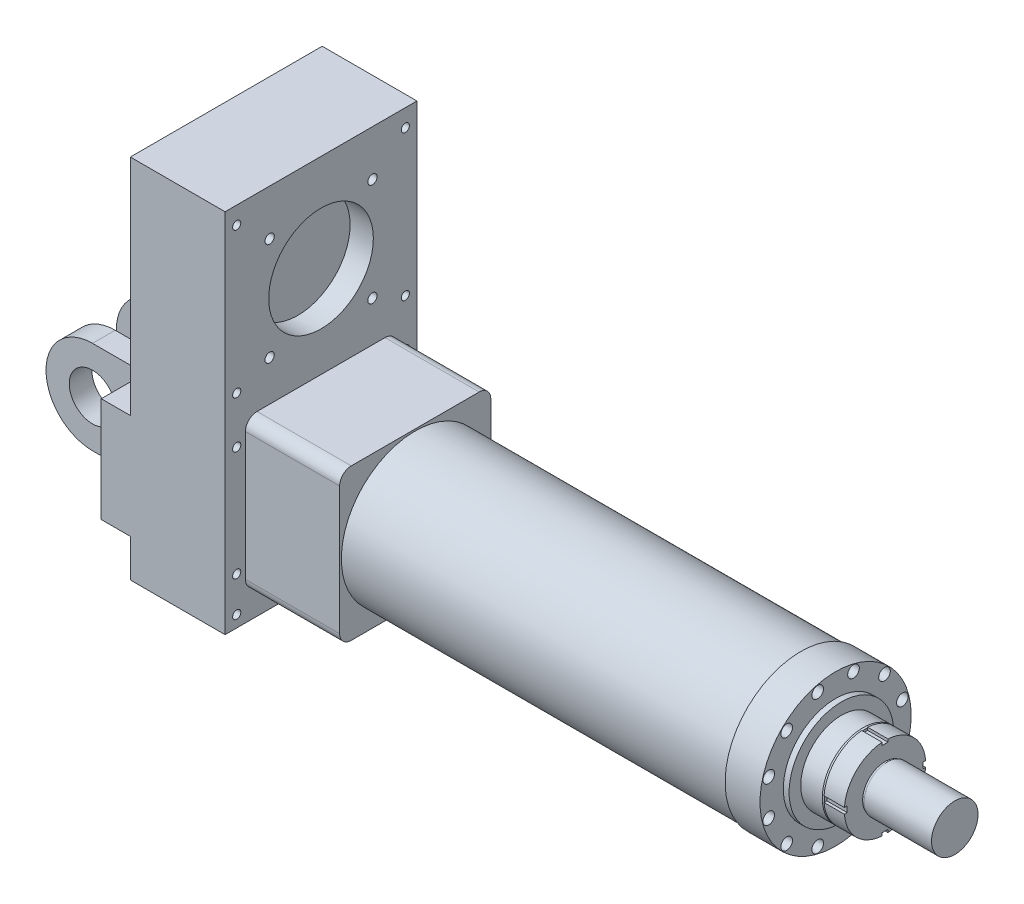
ISO-10303-21;
HEADER;
FILE_DESCRIPTION(('STEP AP214'),'2;1');
FILE_NAME('part.step','',(''),(''),'','','');
FILE_SCHEMA(('AUTOMOTIVE_DESIGN { 1 0 10303 214 1 1 1 1 }'));
ENDSEC;
DATA;
#1=APPLICATION_CONTEXT('core data for automotive mechanical design processes');
#2=APPLICATION_PROTOCOL_DEFINITION('international standard','automotive_design',2000,#1);
#3=PRODUCT_CONTEXT('',#1,'mechanical');
#4=PRODUCT('Part','Part','',(#3));
#5=PRODUCT_RELATED_PRODUCT_CATEGORY('part','',(#4));
#6=PRODUCT_DEFINITION_FORMATION('','',#4);
#7=PRODUCT_DEFINITION_CONTEXT('part definition',#1,'design');
#8=PRODUCT_DEFINITION('design','',#6,#7);
#9=PRODUCT_DEFINITION_SHAPE('','',#8);
#10=(LENGTH_UNIT() NAMED_UNIT(*) SI_UNIT(.MILLI.,.METRE.));
#11=(NAMED_UNIT(*) PLANE_ANGLE_UNIT() SI_UNIT($,.RADIAN.));
#12=(NAMED_UNIT(*) SI_UNIT($,.STERADIAN.) SOLID_ANGLE_UNIT());
#13=UNCERTAINTY_MEASURE_WITH_UNIT(LENGTH_MEASURE(1.E-05),#10,'distance_accuracy_value','');
#14=(GEOMETRIC_REPRESENTATION_CONTEXT(3) GLOBAL_UNCERTAINTY_ASSIGNED_CONTEXT((#13)) GLOBAL_UNIT_ASSIGNED_CONTEXT((#10,
#11,#12)) REPRESENTATION_CONTEXT('',''));
#15=CARTESIAN_POINT('',(0.,0.,0.));
#16=DIRECTION('',(0.,0.,1.));
#17=DIRECTION('',(1.,0.,0.));
#18=AXIS2_PLACEMENT_3D('',#15,#16,#17);
#19=CARTESIAN_POINT('',(-375.,0.,0.));
#20=DIRECTION('',(-1.,0.,0.));
#21=DIRECTION('',(0.,0.,1.));
#22=AXIS2_PLACEMENT_3D('',#19,#20,#21);
#23=PLANE('',#22);
#24=DIRECTION('',(0.,0.,1.));
#25=VECTOR('',#24,1.);
#26=CARTESIAN_POINT('',(-375.,-110.,-165.));
#27=LINE('',#26,#25);
#28=CARTESIAN_POINT('',(-375.,-110.,-165.));
#29=VERTEX_POINT('',#28);
#30=CARTESIAN_POINT('',(-375.,-110.,-90.0000000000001));
#31=VERTEX_POINT('',#30);
#32=EDGE_CURVE('E235',#29,#31,#27,.T.);
#33=ORIENTED_EDGE('',*,*,#32,.T.);
#34=DIRECTION('',(0.,1.,0.));
#35=VECTOR('',#34,1.);
#36=CARTESIAN_POINT('',(-375.,0.,-90.0000000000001));
#37=LINE('',#36,#35);
#38=CARTESIAN_POINT('',(-375.,70.,-90.0000000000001));
#39=VERTEX_POINT('',#38);
#40=EDGE_CURVE('E463',#31,#39,#37,.T.);
#41=ORIENTED_EDGE('',*,*,#40,.T.);
#42=DIRECTION('',(0.,0.,1.));
#43=VECTOR('',#42,1.);
#44=CARTESIAN_POINT('',(-375.,70.,-165.));
#45=LINE('',#44,#43);
#46=CARTESIAN_POINT('',(-375.,70.,-165.));
#47=VERTEX_POINT('',#46);
#48=EDGE_CURVE('E245',#47,#39,#45,.T.);
#49=ORIENTED_EDGE('',*,*,#48,.F.);
#50=DIRECTION('',(0.,-1.,0.));
#51=VECTOR('',#50,1.);
#52=CARTESIAN_POINT('',(-375.,70.,-165.));
#53=LINE('',#52,#51);
#54=EDGE_CURVE('E229',#47,#29,#53,.T.);
#55=ORIENTED_EDGE('',*,*,#54,.T.);
#56=EDGE_LOOP('',(#33,#41,#49,#55));
#57=FACE_BOUND('',#56,.T.);
#58=ADVANCED_FACE('F49',(#57),#23,.T.);
#59=CARTESIAN_POINT('',(-375.,70.,-30.9999999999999));
#60=VERTEX_POINT('',#59);
#61=CARTESIAN_POINT('',(-375.,70.,30.9999999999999));
#62=VERTEX_POINT('',#61);
#63=EDGE_CURVE('E553',#60,#62,#45,.T.);
#64=ORIENTED_EDGE('',*,*,#63,.F.);
#65=DIRECTION('',(0.,-1.,0.));
#66=VECTOR('',#65,1.);
#67=CARTESIAN_POINT('',(-375.,-100.,-30.9999999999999));
#68=LINE('',#67,#66);
#69=CARTESIAN_POINT('',(-375.,-110.,-30.9999999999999));
#70=VERTEX_POINT('',#69);
#71=EDGE_CURVE('E460',#60,#70,#68,.T.);
#72=ORIENTED_EDGE('',*,*,#71,.T.);
#73=CARTESIAN_POINT('',(-375.,-110.,31.));
#74=VERTEX_POINT('',#73);
#75=EDGE_CURVE('E532',#70,#74,#27,.T.);
#76=ORIENTED_EDGE('',*,*,#75,.T.);
#77=DIRECTION('',(0.,1.,0.));
#78=VECTOR('',#77,1.);
#79=CARTESIAN_POINT('',(-375.,0.,31.));
#80=LINE('',#79,#78);
#81=EDGE_CURVE('E457',#74,#62,#80,.T.);
#82=ORIENTED_EDGE('',*,*,#81,.T.);
#83=EDGE_LOOP('',(#64,#72,#76,#82));
#84=FACE_BOUND('',#83,.T.);
#85=ADVANCED_FACE('F570',(#84),#23,.T.);
#86=CARTESIAN_POINT('',(-375.,70.,90.));
#87=VERTEX_POINT('',#86);
#88=CARTESIAN_POINT('',(-375.,70.,165.));
#89=VERTEX_POINT('',#88);
#90=EDGE_CURVE('E244',#87,#89,#45,.T.);
#91=ORIENTED_EDGE('',*,*,#90,.F.);
#92=DIRECTION('',(0.,-1.,0.));
#93=VECTOR('',#92,1.);
#94=CARTESIAN_POINT('',(-375.,-99.9999999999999,90.));
#95=LINE('',#94,#93);
#96=CARTESIAN_POINT('',(-375.,-110.,90.));
#97=VERTEX_POINT('',#96);
#98=EDGE_CURVE('E454',#87,#97,#95,.T.);
#99=ORIENTED_EDGE('',*,*,#98,.T.);
#100=CARTESIAN_POINT('',(-375.,-110.,165.));
#101=VERTEX_POINT('',#100);
#102=EDGE_CURVE('E233',#97,#101,#27,.T.);
#103=ORIENTED_EDGE('',*,*,#102,.T.);
#104=DIRECTION('',(0.,-1.,0.));
#105=VECTOR('',#104,1.);
#106=CARTESIAN_POINT('',(-375.,70.,165.));
#107=LINE('',#106,#105);
#108=EDGE_CURVE('E239',#89,#101,#107,.T.);
#109=ORIENTED_EDGE('',*,*,#108,.F.);
#110=EDGE_LOOP('',(#91,#99,#103,#109));
#111=FACE_BOUND('',#110,.T.);
#112=ADVANCED_FACE('F538',(#111),#23,.T.);
#113=CARTESIAN_POINT('',(-325.,0.,0.));
#114=DIRECTION('',(-1.,0.,0.));
#115=DIRECTION('',(0.,0.,1.));
#116=AXIS2_PLACEMENT_3D('',#113,#114,#115);
#117=PLANE('',#116);
#118=DIRECTION('',(0.,1.,0.));
#119=VECTOR('',#118,1.);
#120=CARTESIAN_POINT('',(-325.,455.,165.));
#121=LINE('',#120,#119);
#122=CARTESIAN_POINT('',(-325.,-175.,165.));
#123=VERTEX_POINT('',#122);
#124=CARTESIAN_POINT('',(-325.,-110.,165.));
#125=VERTEX_POINT('',#124);
#126=EDGE_CURVE('E408',#123,#125,#121,.T.);
#127=ORIENTED_EDGE('',*,*,#126,.T.);
#128=DIRECTION('',(0.,0.,1.));
#129=VECTOR('',#128,1.);
#130=CARTESIAN_POINT('',(-325.,-110.,-165.));
#131=LINE('',#130,#129);
#132=CARTESIAN_POINT('',(-325.,-110.,-165.));
#133=VERTEX_POINT('',#132);
#134=EDGE_CURVE('E228',#133,#125,#131,.T.);
#135=ORIENTED_EDGE('',*,*,#134,.F.);
#136=DIRECTION('',(0.,-1.,0.));
#137=VECTOR('',#136,1.);
#138=CARTESIAN_POINT('',(-325.,455.,-165.));
#139=LINE('',#138,#137);
#140=CARTESIAN_POINT('',(-325.,-175.,-165.));
#141=VERTEX_POINT('',#140);
#142=EDGE_CURVE('E415',#133,#141,#139,.T.);
#143=ORIENTED_EDGE('',*,*,#142,.T.);
#144=DIRECTION('',(0.,0.,1.));
#145=VECTOR('',#144,1.);
#146=CARTESIAN_POINT('',(-325.,-175.,-165.));
#147=LINE('',#146,#145);
#148=EDGE_CURVE('E419',#141,#123,#147,.T.);
#149=ORIENTED_EDGE('',*,*,#148,.T.);
#150=EDGE_LOOP('',(#127,#135,#143,#149));
#151=FACE_BOUND('',#150,.T.);
#152=ADVANCED_FACE('F591',(#151),#117,.T.);
#153=DIRECTION('',(0.,0.,1.));
#154=VECTOR('',#153,1.);
#155=CARTESIAN_POINT('',(-325.,70.,-165.));
#156=LINE('',#155,#154);
#157=CARTESIAN_POINT('',(-325.,70.0000000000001,-165.));
#158=VERTEX_POINT('',#157);
#159=CARTESIAN_POINT('',(-325.,70.0000000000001,165.));
#160=VERTEX_POINT('',#159);
#161=EDGE_CURVE('E234',#158,#160,#156,.T.);
#162=ORIENTED_EDGE('',*,*,#161,.T.);
#163=CARTESIAN_POINT('',(-325.,455.,165.));
#164=VERTEX_POINT('',#163);
#165=EDGE_CURVE('E412',#160,#164,#121,.T.);
#166=ORIENTED_EDGE('',*,*,#165,.T.);
#167=DIRECTION('',(0.,0.,-1.));
#168=VECTOR('',#167,1.);
#169=CARTESIAN_POINT('',(-325.,455.,-165.));
#170=LINE('',#169,#168);
#171=CARTESIAN_POINT('',(-325.,455.,-165.));
#172=VERTEX_POINT('',#171);
#173=EDGE_CURVE('E411',#164,#172,#170,.T.);
#174=ORIENTED_EDGE('',*,*,#173,.T.);
#175=EDGE_CURVE('E416',#172,#158,#139,.T.);
#176=ORIENTED_EDGE('',*,*,#175,.T.);
#177=EDGE_LOOP('',(#162,#166,#174,#176));
#178=FACE_BOUND('',#177,.T.);
#179=ADVANCED_FACE('F605',(#178),#117,.T.);
#180=CARTESIAN_POINT('',(-325.,455.,165.));
#181=DIRECTION('',(0.,0.,-1.));
#182=DIRECTION('',(0.,1.,0.));
#183=AXIS2_PLACEMENT_3D('',#180,#181,#182);
#184=PLANE('',#183);
#185=DIRECTION('',(0.,1.,0.));
#186=VECTOR('',#185,1.);
#187=CARTESIAN_POINT('',(-162.,455.,165.));
#188=LINE('',#187,#186);
#189=CARTESIAN_POINT('',(-162.,-175.,165.));
#190=VERTEX_POINT('',#189);
#191=CARTESIAN_POINT('',(-162.,455.,165.));
#192=VERTEX_POINT('',#191);
#193=EDGE_CURVE('E404',#190,#192,#188,.T.);
#194=ORIENTED_EDGE('',*,*,#193,.T.);
#195=DIRECTION('',(1.,0.,0.));
#196=VECTOR('',#195,1.);
#197=CARTESIAN_POINT('',(-325.,455.,165.));
#198=LINE('',#197,#196);
#199=EDGE_CURVE('E446',#164,#192,#198,.T.);
#200=ORIENTED_EDGE('',*,*,#199,.F.);
#201=ORIENTED_EDGE('',*,*,#165,.F.);
#202=DIRECTION('',(1.,0.,0.));
#203=VECTOR('',#202,1.);
#204=CARTESIAN_POINT('',(-375.,70.,165.));
#205=LINE('',#204,#203);
#206=EDGE_CURVE('E259',#89,#160,#205,.T.);
#207=ORIENTED_EDGE('',*,*,#206,.F.);
#208=ORIENTED_EDGE('',*,*,#108,.T.);
#209=DIRECTION('',(1.,0.,0.));
#210=VECTOR('',#209,1.);
#211=CARTESIAN_POINT('',(-375.,-110.,165.));
#212=LINE('',#211,#210);
#213=EDGE_CURVE('E263',#101,#125,#212,.T.);
#214=ORIENTED_EDGE('',*,*,#213,.T.);
#215=ORIENTED_EDGE('',*,*,#126,.F.);
#216=DIRECTION('',(1.,0.,0.));
#217=VECTOR('',#216,1.);
#218=CARTESIAN_POINT('',(-325.,-175.,165.));
#219=LINE('',#218,#217);
#220=EDGE_CURVE('E422',#123,#190,#219,.T.);
#221=ORIENTED_EDGE('',*,*,#220,.T.);
#222=EDGE_LOOP('',(#194,#200,#201,#207,#208,#214,#215,#221));
#223=FACE_BOUND('',#222,.T.);
#224=ADVANCED_FACE('F544',(#223),#184,.F.);
#225=CARTESIAN_POINT('',(-325.,455.,-165.));
#226=DIRECTION('',(0.,-1.,0.));
#227=DIRECTION('',(0.,0.,-1.));
#228=AXIS2_PLACEMENT_3D('',#225,#226,#227);
#229=PLANE('',#228);
#230=DIRECTION('',(0.,0.,-1.));
#231=VECTOR('',#230,1.);
#232=CARTESIAN_POINT('',(-162.,455.,-165.));
#233=LINE('',#232,#231);
#234=CARTESIAN_POINT('',(-162.,455.,-165.));
#235=VERTEX_POINT('',#234);
#236=EDGE_CURVE('E426',#192,#235,#233,.T.);
#237=ORIENTED_EDGE('',*,*,#236,.T.);
#238=DIRECTION('',(1.,0.,0.));
#239=VECTOR('',#238,1.);
#240=CARTESIAN_POINT('',(-325.,455.,-165.));
#241=LINE('',#240,#239);
#242=EDGE_CURVE('E442',#172,#235,#241,.T.);
#243=ORIENTED_EDGE('',*,*,#242,.F.);
#244=ORIENTED_EDGE('',*,*,#173,.F.);
#245=ORIENTED_EDGE('',*,*,#199,.T.);
#246=EDGE_LOOP('',(#237,#243,#244,#245));
#247=FACE_BOUND('',#246,.T.);
#248=ADVANCED_FACE('F602',(#247),#229,.F.);
#249=CARTESIAN_POINT('',(-325.,455.,-165.));
#250=DIRECTION('',(0.,0.,1.));
#251=DIRECTION('',(0.,-1.,0.));
#252=AXIS2_PLACEMENT_3D('',#249,#250,#251);
#253=PLANE('',#252);
#254=DIRECTION('',(0.,-1.,0.));
#255=VECTOR('',#254,1.);
#256=CARTESIAN_POINT('',(-162.,455.,-165.));
#257=LINE('',#256,#255);
#258=CARTESIAN_POINT('',(-162.,-175.,-165.));
#259=VERTEX_POINT('',#258);
#260=EDGE_CURVE('E429',#235,#259,#257,.T.);
#261=ORIENTED_EDGE('',*,*,#260,.T.);
#262=DIRECTION('',(1.,0.,0.));
#263=VECTOR('',#262,1.);
#264=CARTESIAN_POINT('',(-325.,-175.,-165.));
#265=LINE('',#264,#263);
#266=EDGE_CURVE('E438',#141,#259,#265,.T.);
#267=ORIENTED_EDGE('',*,*,#266,.F.);
#268=ORIENTED_EDGE('',*,*,#142,.F.);
#269=DIRECTION('',(1.,0.,0.));
#270=VECTOR('',#269,1.);
#271=CARTESIAN_POINT('',(-375.,-110.,-165.));
#272=LINE('',#271,#270);
#273=EDGE_CURVE('E267',#29,#133,#272,.T.);
#274=ORIENTED_EDGE('',*,*,#273,.F.);
#275=ORIENTED_EDGE('',*,*,#54,.F.);
#276=DIRECTION('',(1.,0.,0.));
#277=VECTOR('',#276,1.);
#278=CARTESIAN_POINT('',(-375.,70.,-165.));
#279=LINE('',#278,#277);
#280=EDGE_CURVE('E249',#47,#158,#279,.T.);
#281=ORIENTED_EDGE('',*,*,#280,.T.);
#282=ORIENTED_EDGE('',*,*,#175,.F.);
#283=ORIENTED_EDGE('',*,*,#242,.T.);
#284=EDGE_LOOP('',(#261,#267,#268,#274,#275,#281,#282,#283));
#285=FACE_BOUND('',#284,.T.);
#286=ADVANCED_FACE('F586',(#285),#253,.F.);
#287=CARTESIAN_POINT('',(-325.,-175.,-165.));
#288=DIRECTION('',(0.,1.,0.));
#289=DIRECTION('',(0.,0.,1.));
#290=AXIS2_PLACEMENT_3D('',#287,#288,#289);
#291=PLANE('',#290);
#292=DIRECTION('',(0.,0.,1.));
#293=VECTOR('',#292,1.);
#294=CARTESIAN_POINT('',(-162.,-175.,-165.));
#295=LINE('',#294,#293);
#296=EDGE_CURVE('E432',#259,#190,#295,.T.);
#297=ORIENTED_EDGE('',*,*,#296,.T.);
#298=ORIENTED_EDGE('',*,*,#220,.F.);
#299=ORIENTED_EDGE('',*,*,#148,.F.);
#300=ORIENTED_EDGE('',*,*,#266,.T.);
#301=EDGE_LOOP('',(#297,#298,#299,#300));
#302=FACE_BOUND('',#301,.T.);
#303=ADVANCED_FACE('F607',(#302),#291,.F.);
#304=CARTESIAN_POINT('',(-162.,0.,0.));
#305=DIRECTION('',(-1.,0.,0.));
#306=DIRECTION('',(0.,0.,1.));
#307=AXIS2_PLACEMENT_3D('',#304,#305,#306);
#308=PLANE('',#307);
#309=CARTESIAN_POINT('',(-162.,-155.,145.));
#310=DIRECTION('',(1.,0.,0.));
#311=DIRECTION('',(0.,0.,-1.));
#312=AXIS2_PLACEMENT_3D('',#309,#310,#311);
#313=CIRCLE('',#312,7.00000000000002);
#314=CARTESIAN_POINT('',(-162.,-155.,138.));
#315=VERTEX_POINT('',#314);
#316=EDGE_CURVE('E324',#315,#315,#313,.T.);
#317=ORIENTED_EDGE('',*,*,#316,.F.);
#318=EDGE_LOOP('',(#317));
#319=FACE_BOUND('',#318,.T.);
#320=CARTESIAN_POINT('',(-162.,-94.5,145.));
#321=DIRECTION('',(1.,0.,0.));
#322=DIRECTION('',(0.,0.,-1.));
#323=AXIS2_PLACEMENT_3D('',#320,#321,#322);
#324=CIRCLE('',#323,7.00000000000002);
#325=CARTESIAN_POINT('',(-162.,-94.5,138.));
#326=VERTEX_POINT('',#325);
#327=EDGE_CURVE('E357',#326,#326,#324,.T.);
#328=ORIENTED_EDGE('',*,*,#327,.F.);
#329=EDGE_LOOP('',(#328));
#330=FACE_BOUND('',#329,.T.);
#331=CARTESIAN_POINT('',(-162.,94.5,145.));
#332=DIRECTION('',(1.,0.,0.));
#333=DIRECTION('',(0.,0.,-1.));
#334=AXIS2_PLACEMENT_3D('',#331,#332,#333);
#335=CIRCLE('',#334,7.00000000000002);
#336=CARTESIAN_POINT('',(-162.,94.5,138.));
#337=VERTEX_POINT('',#336);
#338=EDGE_CURVE('E349',#337,#337,#335,.T.);
#339=ORIENTED_EDGE('',*,*,#338,.F.);
#340=EDGE_LOOP('',(#339));
#341=FACE_BOUND('',#340,.T.);
#342=CARTESIAN_POINT('',(-162.,199.611652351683,88.3883476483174));
#343=DIRECTION('',(1.,0.,0.));
#344=DIRECTION('',(0.,0.,-1.));
#345=AXIS2_PLACEMENT_3D('',#342,#343,#344);
#346=CIRCLE('',#345,8.00000000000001);
#347=CARTESIAN_POINT('',(-162.,199.611652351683,80.3883476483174));
#348=VERTEX_POINT('',#347);
#349=EDGE_CURVE('E341',#348,#348,#346,.T.);
#350=ORIENTED_EDGE('',*,*,#349,.F.);
#351=EDGE_LOOP('',(#350));
#352=FACE_BOUND('',#351,.T.);
#353=CARTESIAN_POINT('',(-162.,199.611652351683,-88.3883476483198));
#354=DIRECTION('',(1.,0.,0.));
#355=DIRECTION('',(0.,0.,-1.));
#356=AXIS2_PLACEMENT_3D('',#353,#354,#355);
#357=CIRCLE('',#356,8.00000000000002);
#358=CARTESIAN_POINT('',(-162.,199.611652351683,-96.3883476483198));
#359=VERTEX_POINT('',#358);
#360=EDGE_CURVE('E340',#359,#359,#357,.T.);
#361=ORIENTED_EDGE('',*,*,#360,.F.);
#362=EDGE_LOOP('',(#361));
#363=FACE_BOUND('',#362,.T.);
#364=CARTESIAN_POINT('',(-162.,376.38834764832,-88.3883476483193));
#365=DIRECTION('',(1.,0.,0.));
#366=DIRECTION('',(0.,0.,-1.));
#367=AXIS2_PLACEMENT_3D('',#364,#365,#366);
#368=CIRCLE('',#367,7.99999999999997);
#369=CARTESIAN_POINT('',(-162.,376.38834764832,-96.3883476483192));
#370=VERTEX_POINT('',#369);
#371=EDGE_CURVE('E389',#370,#370,#368,.T.);
#372=ORIENTED_EDGE('',*,*,#371,.F.);
#373=EDGE_LOOP('',(#372));
#374=FACE_BOUND('',#373,.T.);
#375=CARTESIAN_POINT('',(-162.,175.,145.));
#376=DIRECTION('',(1.,0.,0.));
#377=DIRECTION('',(0.,0.,-1.));
#378=AXIS2_PLACEMENT_3D('',#375,#376,#377);
#379=CIRCLE('',#378,7.00000000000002);
#380=CARTESIAN_POINT('',(-162.,175.,138.));
#381=VERTEX_POINT('',#380);
#382=EDGE_CURVE('E381',#381,#381,#379,.T.);
#383=ORIENTED_EDGE('',*,*,#382,.F.);
#384=EDGE_LOOP('',(#383));
#385=FACE_BOUND('',#384,.T.);
#386=CARTESIAN_POINT('',(-162.,376.388347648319,88.3883476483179));
#387=DIRECTION('',(1.,0.,0.));
#388=DIRECTION('',(0.,0.,-1.));
#389=AXIS2_PLACEMENT_3D('',#386,#387,#388);
#390=CIRCLE('',#389,8.00000000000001);
#391=CARTESIAN_POINT('',(-162.,376.388347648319,80.3883476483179));
#392=VERTEX_POINT('',#391);
#393=EDGE_CURVE('E373',#392,#392,#390,.T.);
#394=ORIENTED_EDGE('',*,*,#393,.F.);
#395=EDGE_LOOP('',(#394));
#396=FACE_BOUND('',#395,.T.);
#397=CARTESIAN_POINT('',(-162.,425.,-145.));
#398=DIRECTION('',(1.,0.,0.));
#399=DIRECTION('',(0.,0.,1.));
#400=AXIS2_PLACEMENT_3D('',#397,#398,#399);
#401=CIRCLE('',#400,7.00000000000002);
#402=CARTESIAN_POINT('',(-162.,425.,-138.));
#403=VERTEX_POINT('',#402);
#404=EDGE_CURVE('E287',#403,#403,#401,.T.);
#405=ORIENTED_EDGE('',*,*,#404,.F.);
#406=EDGE_LOOP('',(#405));
#407=FACE_BOUND('',#406,.T.);
#408=CARTESIAN_POINT('',(-162.,175.,-145.));
#409=DIRECTION('',(1.,0.,0.));
#410=DIRECTION('',(0.,0.,1.));
#411=AXIS2_PLACEMENT_3D('',#408,#409,#410);
#412=CIRCLE('',#411,7.00000000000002);
#413=CARTESIAN_POINT('',(-162.,175.,-138.));
#414=VERTEX_POINT('',#413);
#415=EDGE_CURVE('E293',#414,#414,#412,.T.);
#416=ORIENTED_EDGE('',*,*,#415,.F.);
#417=EDGE_LOOP('',(#416));
#418=FACE_BOUND('',#417,.T.);
#419=CARTESIAN_POINT('',(-162.,425.,145.));
#420=DIRECTION('',(1.,0.,0.));
#421=DIRECTION('',(0.,0.,-1.));
#422=AXIS2_PLACEMENT_3D('',#419,#420,#421);
#423=CIRCLE('',#422,7.00000000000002);
#424=CARTESIAN_POINT('',(-162.,425.,138.));
#425=VERTEX_POINT('',#424);
#426=EDGE_CURVE('E325',#425,#425,#423,.T.);
#427=ORIENTED_EDGE('',*,*,#426,.F.);
#428=EDGE_LOOP('',(#427));
#429=FACE_BOUND('',#428,.T.);
#430=CARTESIAN_POINT('',(-162.,-155.,-145.));
#431=DIRECTION('',(1.,0.,0.));
#432=DIRECTION('',(0.,0.,1.));
#433=AXIS2_PLACEMENT_3D('',#430,#431,#432);
#434=CIRCLE('',#433,7.00000000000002);
#435=CARTESIAN_POINT('',(-162.,-155.,-138.));
#436=VERTEX_POINT('',#435);
#437=EDGE_CURVE('E308',#436,#436,#434,.T.);
#438=ORIENTED_EDGE('',*,*,#437,.F.);
#439=EDGE_LOOP('',(#438));
#440=FACE_BOUND('',#439,.T.);
#441=CARTESIAN_POINT('',(-162.,-94.5000000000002,-145.));
#442=DIRECTION('',(1.,0.,0.));
#443=DIRECTION('',(0.,0.,1.));
#444=AXIS2_PLACEMENT_3D('',#441,#442,#443);
#445=CIRCLE('',#444,7.00000000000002);
#446=CARTESIAN_POINT('',(-162.,-94.5000000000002,-138.));
#447=VERTEX_POINT('',#446);
#448=EDGE_CURVE('E309',#447,#447,#445,.T.);
#449=ORIENTED_EDGE('',*,*,#448,.F.);
#450=EDGE_LOOP('',(#449));
#451=FACE_BOUND('',#450,.T.);
#452=CARTESIAN_POINT('',(-162.,94.4999999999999,-145.));
#453=DIRECTION('',(1.,0.,0.));
#454=DIRECTION('',(0.,0.,1.));
#455=AXIS2_PLACEMENT_3D('',#452,#453,#454);
#456=CIRCLE('',#455,7.00000000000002);
#457=CARTESIAN_POINT('',(-162.,94.4999999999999,-138.));
#458=VERTEX_POINT('',#457);
#459=EDGE_CURVE('E292',#458,#458,#456,.T.);
#460=ORIENTED_EDGE('',*,*,#459,.F.);
#461=EDGE_LOOP('',(#460));
#462=FACE_BOUND('',#461,.T.);
#463=CARTESIAN_POINT('',(-162.,288.,0.));
#464=DIRECTION('',(1.,0.,0.));
#465=DIRECTION('',(0.,0.,-1.));
#466=AXIS2_PLACEMENT_3D('',#463,#464,#465);
#467=CIRCLE('',#466,90.);
#468=CARTESIAN_POINT('',(-162.,288.,-90.));
#469=VERTEX_POINT('',#468);
#470=EDGE_CURVE('E372',#469,#469,#467,.T.);
#471=ORIENTED_EDGE('',*,*,#470,.F.);
#472=EDGE_LOOP('',(#471));
#473=FACE_BOUND('',#472,.T.);
#474=ORIENTED_EDGE('',*,*,#193,.F.);
#475=ORIENTED_EDGE('',*,*,#296,.F.);
#476=ORIENTED_EDGE('',*,*,#260,.F.);
#477=ORIENTED_EDGE('',*,*,#236,.F.);
#478=EDGE_LOOP('',(#474,#475,#476,#477));
#479=FACE_BOUND('',#478,.T.);
#480=ADVANCED_FACE('F597',(#319,#330,#341,#352,#363,#374,#385,#396,#407,#418,#429,#440,#451,
#462,#473,#479),#308,.F.);
#481=CARTESIAN_POINT('',(-202.,288.,0.));
#482=DIRECTION('',(1.,0.,0.));
#483=DIRECTION('',(0.,0.,-1.));
#484=AXIS2_PLACEMENT_3D('',#481,#482,#483);
#485=CYLINDRICAL_SURFACE('',#484,90.);
#486=CARTESIAN_POINT('',(-202.,288.,0.));
#487=DIRECTION('',(1.,0.,0.));
#488=DIRECTION('',(0.,0.,-1.));
#489=AXIS2_PLACEMENT_3D('',#486,#487,#488);
#490=CIRCLE('',#489,90.);
#491=CARTESIAN_POINT('',(-202.,288.,-90.));
#492=VERTEX_POINT('',#491);
#493=EDGE_CURVE('E400',#492,#492,#490,.T.);
#494=ORIENTED_EDGE('',*,*,#493,.F.);
#495=EDGE_LOOP('',(#494));
#496=FACE_BOUND('',#495,.T.);
#497=ORIENTED_EDGE('',*,*,#470,.T.);
#498=EDGE_LOOP('',(#497));
#499=FACE_BOUND('',#498,.T.);
#500=ADVANCED_FACE('F614',(#496,#499),#485,.F.);
#501=CARTESIAN_POINT('',(-202.,288.,0.));
#502=DIRECTION('',(1.,0.,0.));
#503=DIRECTION('',(0.,0.,-1.));
#504=AXIS2_PLACEMENT_3D('',#501,#502,#503);
#505=PLANE('',#504);
#506=ORIENTED_EDGE('',*,*,#493,.T.);
#507=EDGE_LOOP('',(#506));
#508=FACE_BOUND('',#507,.T.);
#509=ADVANCED_FACE('F636',(#508),#505,.T.);
#510=CARTESIAN_POINT('',(-202.,94.4999999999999,-145.));
#511=DIRECTION('',(1.,0.,0.));
#512=DIRECTION('',(0.,0.,-1.));
#513=AXIS2_PLACEMENT_3D('',#510,#511,#512);
#514=CYLINDRICAL_SURFACE('',#513,7.00000000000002);
#515=CARTESIAN_POINT('',(-202.,94.4999999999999,-145.));
#516=DIRECTION('',(1.,0.,0.));
#517=DIRECTION('',(0.,0.,1.));
#518=AXIS2_PLACEMENT_3D('',#515,#516,#517);
#519=CIRCLE('',#518,7.00000000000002);
#520=CARTESIAN_POINT('',(-202.,94.4999999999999,-138.));
#521=VERTEX_POINT('',#520);
#522=EDGE_CURVE('E313',#521,#521,#519,.T.);
#523=ORIENTED_EDGE('',*,*,#522,.F.);
#524=EDGE_LOOP('',(#523));
#525=FACE_BOUND('',#524,.T.);
#526=ORIENTED_EDGE('',*,*,#459,.T.);
#527=EDGE_LOOP('',(#526));
#528=FACE_BOUND('',#527,.T.);
#529=ADVANCED_FACE('F640',(#525,#528),#514,.F.);
#530=CARTESIAN_POINT('',(-202.,94.4999999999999,-145.));
#531=DIRECTION('',(-1.,0.,0.));
#532=DIRECTION('',(0.,0.,1.));
#533=AXIS2_PLACEMENT_3D('',#530,#531,#532);
#534=PLANE('',#533);
#535=ORIENTED_EDGE('',*,*,#522,.T.);
#536=EDGE_LOOP('',(#535));
#537=FACE_BOUND('',#536,.T.);
#538=ADVANCED_FACE('F727',(#537),#534,.F.);
#539=CARTESIAN_POINT('',(-202.,-94.5000000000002,-145.));
#540=DIRECTION('',(1.,0.,0.));
#541=DIRECTION('',(0.,0.,-1.));
#542=AXIS2_PLACEMENT_3D('',#539,#540,#541);
#543=CYLINDRICAL_SURFACE('',#542,7.00000000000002);
#544=CARTESIAN_POINT('',(-202.,-94.5000000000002,-145.));
#545=DIRECTION('',(1.,0.,0.));
#546=DIRECTION('',(0.,0.,1.));
#547=AXIS2_PLACEMENT_3D('',#544,#545,#546);
#548=CIRCLE('',#547,7.00000000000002);
#549=CARTESIAN_POINT('',(-202.,-94.5000000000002,-138.));
#550=VERTEX_POINT('',#549);
#551=EDGE_CURVE('E304',#550,#550,#548,.T.);
#552=ORIENTED_EDGE('',*,*,#551,.F.);
#553=EDGE_LOOP('',(#552));
#554=FACE_BOUND('',#553,.T.);
#555=ORIENTED_EDGE('',*,*,#448,.T.);
#556=EDGE_LOOP('',(#555));
#557=FACE_BOUND('',#556,.T.);
#558=ADVANCED_FACE('F731',(#554,#557),#543,.F.);
#559=CARTESIAN_POINT('',(-202.,-94.5000000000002,-145.));
#560=DIRECTION('',(-1.,0.,0.));
#561=DIRECTION('',(0.,0.,1.));
#562=AXIS2_PLACEMENT_3D('',#559,#560,#561);
#563=PLANE('',#562);
#564=ORIENTED_EDGE('',*,*,#551,.T.);
#565=EDGE_LOOP('',(#564));
#566=FACE_BOUND('',#565,.T.);
#567=ADVANCED_FACE('F711',(#566),#563,.F.);
#568=CARTESIAN_POINT('',(-202.,-155.,-145.));
#569=DIRECTION('',(1.,0.,0.));
#570=DIRECTION('',(0.,0.,-1.));
#571=AXIS2_PLACEMENT_3D('',#568,#569,#570);
#572=CYLINDRICAL_SURFACE('',#571,7.00000000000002);
#573=CARTESIAN_POINT('',(-202.,-155.,-145.));
#574=DIRECTION('',(1.,0.,0.));
#575=DIRECTION('',(0.,0.,1.));
#576=AXIS2_PLACEMENT_3D('',#573,#574,#575);
#577=CIRCLE('',#576,7.00000000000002);
#578=CARTESIAN_POINT('',(-202.,-155.,-138.));
#579=VERTEX_POINT('',#578);
#580=EDGE_CURVE('E329',#579,#579,#577,.T.);
#581=ORIENTED_EDGE('',*,*,#580,.F.);
#582=EDGE_LOOP('',(#581));
#583=FACE_BOUND('',#582,.T.);
#584=ORIENTED_EDGE('',*,*,#437,.T.);
#585=EDGE_LOOP('',(#584));
#586=FACE_BOUND('',#585,.T.);
#587=ADVANCED_FACE('F707',(#583,#586),#572,.F.);
#588=CARTESIAN_POINT('',(-202.,-155.,-145.));
#589=DIRECTION('',(-1.,0.,0.));
#590=DIRECTION('',(0.,0.,1.));
#591=AXIS2_PLACEMENT_3D('',#588,#589,#590);
#592=PLANE('',#591);
#593=ORIENTED_EDGE('',*,*,#580,.T.);
#594=EDGE_LOOP('',(#593));
#595=FACE_BOUND('',#594,.T.);
#596=ADVANCED_FACE('F710',(#595),#592,.F.);
#597=CARTESIAN_POINT('',(-202.,425.,145.));
#598=DIRECTION('',(1.,0.,0.));
#599=DIRECTION('',(0.,0.,-1.));
#600=AXIS2_PLACEMENT_3D('',#597,#598,#599);
#601=CYLINDRICAL_SURFACE('',#600,7.00000000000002);
#602=CARTESIAN_POINT('',(-202.,425.,145.));
#603=DIRECTION('',(1.,0.,0.));
#604=DIRECTION('',(0.,0.,-1.));
#605=AXIS2_PLACEMENT_3D('',#602,#603,#604);
#606=CIRCLE('',#605,7.00000000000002);
#607=CARTESIAN_POINT('',(-202.,425.,138.));
#608=VERTEX_POINT('',#607);
#609=EDGE_CURVE('E320',#608,#608,#606,.T.);
#610=ORIENTED_EDGE('',*,*,#609,.F.);
#611=EDGE_LOOP('',(#610));
#612=FACE_BOUND('',#611,.T.);
#613=ORIENTED_EDGE('',*,*,#426,.T.);
#614=EDGE_LOOP('',(#613));
#615=FACE_BOUND('',#614,.T.);
#616=ADVANCED_FACE('F715',(#612,#615),#601,.F.);
#617=CARTESIAN_POINT('',(-202.,425.,145.));
#618=DIRECTION('',(1.,0.,0.));
#619=DIRECTION('',(0.,0.,-1.));
#620=AXIS2_PLACEMENT_3D('',#617,#618,#619);
#621=PLANE('',#620);
#622=ORIENTED_EDGE('',*,*,#609,.T.);
#623=EDGE_LOOP('',(#622));
#624=FACE_BOUND('',#623,.T.);
#625=ADVANCED_FACE('F719',(#624),#621,.T.);
#626=CARTESIAN_POINT('',(-202.,175.,-145.));
#627=DIRECTION('',(1.,0.,0.));
#628=DIRECTION('',(0.,0.,-1.));
#629=AXIS2_PLACEMENT_3D('',#626,#627,#628);
#630=CYLINDRICAL_SURFACE('',#629,7.00000000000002);
#631=CARTESIAN_POINT('',(-202.,175.,-145.));
#632=DIRECTION('',(1.,0.,0.));
#633=DIRECTION('',(0.,0.,1.));
#634=AXIS2_PLACEMENT_3D('',#631,#632,#633);
#635=CIRCLE('',#634,7.00000000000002);
#636=CARTESIAN_POINT('',(-202.,175.,-138.));
#637=VERTEX_POINT('',#636);
#638=EDGE_CURVE('E288',#637,#637,#635,.T.);
#639=ORIENTED_EDGE('',*,*,#638,.F.);
#640=EDGE_LOOP('',(#639));
#641=FACE_BOUND('',#640,.T.);
#642=ORIENTED_EDGE('',*,*,#415,.T.);
#643=EDGE_LOOP('',(#642));
#644=FACE_BOUND('',#643,.T.);
#645=ADVANCED_FACE('F723',(#641,#644),#630,.F.);
#646=CARTESIAN_POINT('',(-202.,175.,-145.));
#647=DIRECTION('',(-1.,0.,0.));
#648=DIRECTION('',(0.,0.,1.));
#649=AXIS2_PLACEMENT_3D('',#646,#647,#648);
#650=PLANE('',#649);
#651=ORIENTED_EDGE('',*,*,#638,.T.);
#652=EDGE_LOOP('',(#651));
#653=FACE_BOUND('',#652,.T.);
#654=ADVANCED_FACE('F742',(#653),#650,.F.);
#655=CARTESIAN_POINT('',(-202.,425.,-145.));
#656=DIRECTION('',(1.,0.,0.));
#657=DIRECTION('',(0.,0.,-1.));
#658=AXIS2_PLACEMENT_3D('',#655,#656,#657);
#659=CYLINDRICAL_SURFACE('',#658,7.00000000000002);
#660=CARTESIAN_POINT('',(-202.,425.,-145.));
#661=DIRECTION('',(1.,0.,0.));
#662=DIRECTION('',(0.,0.,1.));
#663=AXIS2_PLACEMENT_3D('',#660,#661,#662);
#664=CIRCLE('',#663,7.00000000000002);
#665=CARTESIAN_POINT('',(-202.,425.,-138.));
#666=VERTEX_POINT('',#665);
#667=EDGE_CURVE('E297',#666,#666,#664,.T.);
#668=ORIENTED_EDGE('',*,*,#667,.F.);
#669=EDGE_LOOP('',(#668));
#670=FACE_BOUND('',#669,.T.);
#671=ORIENTED_EDGE('',*,*,#404,.T.);
#672=EDGE_LOOP('',(#671));
#673=FACE_BOUND('',#672,.T.);
#674=ADVANCED_FACE('F739',(#670,#673),#659,.F.);
#675=CARTESIAN_POINT('',(-202.,425.,-145.));
#676=DIRECTION('',(-1.,0.,0.));
#677=DIRECTION('',(0.,0.,1.));
#678=AXIS2_PLACEMENT_3D('',#675,#676,#677);
#679=PLANE('',#678);
#680=ORIENTED_EDGE('',*,*,#667,.T.);
#681=EDGE_LOOP('',(#680));
#682=FACE_BOUND('',#681,.T.);
#683=ADVANCED_FACE('F671',(#682),#679,.F.);
#684=CARTESIAN_POINT('',(-202.,376.388347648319,88.3883476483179));
#685=DIRECTION('',(1.,0.,0.));
#686=DIRECTION('',(0.,0.,-1.));
#687=AXIS2_PLACEMENT_3D('',#684,#685,#686);
#688=CYLINDRICAL_SURFACE('',#687,8.00000000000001);
#689=CARTESIAN_POINT('',(-202.,376.388347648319,88.3883476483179));
#690=DIRECTION('',(1.,0.,0.));
#691=DIRECTION('',(0.,0.,-1.));
#692=AXIS2_PLACEMENT_3D('',#689,#690,#691);
#693=CIRCLE('',#692,8.00000000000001);
#694=CARTESIAN_POINT('',(-202.,376.388347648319,80.3883476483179));
#695=VERTEX_POINT('',#694);
#696=EDGE_CURVE('E368',#695,#695,#693,.T.);
#697=ORIENTED_EDGE('',*,*,#696,.F.);
#698=EDGE_LOOP('',(#697));
#699=FACE_BOUND('',#698,.T.);
#700=ORIENTED_EDGE('',*,*,#393,.T.);
#701=EDGE_LOOP('',(#700));
#702=FACE_BOUND('',#701,.T.);
#703=ADVANCED_FACE('F668',(#699,#702),#688,.F.);
#704=CARTESIAN_POINT('',(-202.,376.388347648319,88.3883476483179));
#705=DIRECTION('',(1.,0.,0.));
#706=DIRECTION('',(0.,0.,-1.));
#707=AXIS2_PLACEMENT_3D('',#704,#705,#706);
#708=PLANE('',#707);
#709=ORIENTED_EDGE('',*,*,#696,.T.);
#710=EDGE_LOOP('',(#709));
#711=FACE_BOUND('',#710,.T.);
#712=ADVANCED_FACE('F663',(#711),#708,.T.);
#713=CARTESIAN_POINT('',(-202.,175.,145.));
#714=DIRECTION('',(1.,0.,0.));
#715=DIRECTION('',(0.,0.,-1.));
#716=AXIS2_PLACEMENT_3D('',#713,#714,#715);
#717=CYLINDRICAL_SURFACE('',#716,7.00000000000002);
#718=CARTESIAN_POINT('',(-202.,175.,145.));
#719=DIRECTION('',(1.,0.,0.));
#720=DIRECTION('',(0.,0.,-1.));
#721=AXIS2_PLACEMENT_3D('',#718,#719,#720);
#722=CIRCLE('',#721,7.00000000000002);
#723=CARTESIAN_POINT('',(-202.,175.,138.));
#724=VERTEX_POINT('',#723);
#725=EDGE_CURVE('E377',#724,#724,#722,.T.);
#726=ORIENTED_EDGE('',*,*,#725,.F.);
#727=EDGE_LOOP('',(#726));
#728=FACE_BOUND('',#727,.T.);
#729=ORIENTED_EDGE('',*,*,#382,.T.);
#730=EDGE_LOOP('',(#729));
#731=FACE_BOUND('',#730,.T.);
#732=ADVANCED_FACE('F660',(#728,#731),#717,.F.);
#733=CARTESIAN_POINT('',(-202.,175.,145.));
#734=DIRECTION('',(1.,0.,0.));
#735=DIRECTION('',(0.,0.,-1.));
#736=AXIS2_PLACEMENT_3D('',#733,#734,#735);
#737=PLANE('',#736);
#738=ORIENTED_EDGE('',*,*,#725,.T.);
#739=EDGE_LOOP('',(#738));
#740=FACE_BOUND('',#739,.T.);
#741=ADVANCED_FACE('F655',(#740),#737,.T.);
#742=CARTESIAN_POINT('',(-202.,376.38834764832,-88.3883476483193));
#743=DIRECTION('',(1.,0.,0.));
#744=DIRECTION('',(0.,0.,-1.));
#745=AXIS2_PLACEMENT_3D('',#742,#743,#744);
#746=CYLINDRICAL_SURFACE('',#745,7.99999999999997);
#747=CARTESIAN_POINT('',(-202.,376.38834764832,-88.3883476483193));
#748=DIRECTION('',(1.,0.,0.));
#749=DIRECTION('',(0.,0.,-1.));
#750=AXIS2_PLACEMENT_3D('',#747,#748,#749);
#751=CIRCLE('',#750,7.99999999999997);
#752=CARTESIAN_POINT('',(-202.,376.38834764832,-96.3883476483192));
#753=VERTEX_POINT('',#752);
#754=EDGE_CURVE('E385',#753,#753,#751,.T.);
#755=ORIENTED_EDGE('',*,*,#754,.F.);
#756=EDGE_LOOP('',(#755));
#757=FACE_BOUND('',#756,.T.);
#758=ORIENTED_EDGE('',*,*,#371,.T.);
#759=EDGE_LOOP('',(#758));
#760=FACE_BOUND('',#759,.T.);
#761=ADVANCED_FACE('F652',(#757,#760),#746,.F.);
#762=CARTESIAN_POINT('',(-202.,376.38834764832,-88.3883476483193));
#763=DIRECTION('',(1.,0.,0.));
#764=DIRECTION('',(0.,0.,-1.));
#765=AXIS2_PLACEMENT_3D('',#762,#763,#764);
#766=PLANE('',#765);
#767=ORIENTED_EDGE('',*,*,#754,.T.);
#768=EDGE_LOOP('',(#767));
#769=FACE_BOUND('',#768,.T.);
#770=ADVANCED_FACE('F646',(#769),#766,.T.);
#771=CARTESIAN_POINT('',(-202.,199.611652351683,-88.3883476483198));
#772=DIRECTION('',(1.,0.,0.));
#773=DIRECTION('',(0.,0.,-1.));
#774=AXIS2_PLACEMENT_3D('',#771,#772,#773);
#775=CYLINDRICAL_SURFACE('',#774,8.00000000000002);
#776=CARTESIAN_POINT('',(-202.,199.611652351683,-88.3883476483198));
#777=DIRECTION('',(1.,0.,0.));
#778=DIRECTION('',(0.,0.,-1.));
#779=AXIS2_PLACEMENT_3D('',#776,#777,#778);
#780=CIRCLE('',#779,8.00000000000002);
#781=CARTESIAN_POINT('',(-202.,199.611652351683,-96.3883476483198));
#782=VERTEX_POINT('',#781);
#783=EDGE_CURVE('E393',#782,#782,#780,.T.);
#784=ORIENTED_EDGE('',*,*,#783,.F.);
#785=EDGE_LOOP('',(#784));
#786=FACE_BOUND('',#785,.T.);
#787=ORIENTED_EDGE('',*,*,#360,.T.);
#788=EDGE_LOOP('',(#787));
#789=FACE_BOUND('',#788,.T.);
#790=ADVANCED_FACE('F642',(#786,#789),#775,.F.);
#791=CARTESIAN_POINT('',(-202.,199.611652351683,-88.3883476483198));
#792=DIRECTION('',(1.,0.,0.));
#793=DIRECTION('',(0.,0.,-1.));
#794=AXIS2_PLACEMENT_3D('',#791,#792,#793);
#795=PLANE('',#794);
#796=ORIENTED_EDGE('',*,*,#783,.T.);
#797=EDGE_LOOP('',(#796));
#798=FACE_BOUND('',#797,.T.);
#799=ADVANCED_FACE('F645',(#798),#795,.T.);
#800=CARTESIAN_POINT('',(-202.,199.611652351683,88.3883476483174));
#801=DIRECTION('',(1.,0.,0.));
#802=DIRECTION('',(0.,0.,-1.));
#803=AXIS2_PLACEMENT_3D('',#800,#801,#802);
#804=CYLINDRICAL_SURFACE('',#803,8.00000000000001);
#805=CARTESIAN_POINT('',(-202.,199.611652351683,88.3883476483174));
#806=DIRECTION('',(1.,0.,0.));
#807=DIRECTION('',(0.,0.,-1.));
#808=AXIS2_PLACEMENT_3D('',#805,#806,#807);
#809=CIRCLE('',#808,8.00000000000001);
#810=CARTESIAN_POINT('',(-202.,199.611652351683,80.3883476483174));
#811=VERTEX_POINT('',#810);
#812=EDGE_CURVE('E336',#811,#811,#809,.T.);
#813=ORIENTED_EDGE('',*,*,#812,.F.);
#814=EDGE_LOOP('',(#813));
#815=FACE_BOUND('',#814,.T.);
#816=ORIENTED_EDGE('',*,*,#349,.T.);
#817=EDGE_LOOP('',(#816));
#818=FACE_BOUND('',#817,.T.);
#819=ADVANCED_FACE('F650',(#815,#818),#804,.F.);
#820=CARTESIAN_POINT('',(-202.,199.611652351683,88.3883476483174));
#821=DIRECTION('',(1.,0.,0.));
#822=DIRECTION('',(0.,0.,-1.));
#823=AXIS2_PLACEMENT_3D('',#820,#821,#822);
#824=PLANE('',#823);
#825=ORIENTED_EDGE('',*,*,#812,.T.);
#826=EDGE_LOOP('',(#825));
#827=FACE_BOUND('',#826,.T.);
#828=ADVANCED_FACE('F696',(#827),#824,.T.);
#829=CARTESIAN_POINT('',(-202.,94.5,145.));
#830=DIRECTION('',(1.,0.,0.));
#831=DIRECTION('',(0.,0.,-1.));
#832=AXIS2_PLACEMENT_3D('',#829,#830,#831);
#833=CYLINDRICAL_SURFACE('',#832,7.00000000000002);
#834=CARTESIAN_POINT('',(-202.,94.5,145.));
#835=DIRECTION('',(1.,0.,0.));
#836=DIRECTION('',(0.,0.,-1.));
#837=AXIS2_PLACEMENT_3D('',#834,#835,#836);
#838=CIRCLE('',#837,7.00000000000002);
#839=CARTESIAN_POINT('',(-202.,94.5,138.));
#840=VERTEX_POINT('',#839);
#841=EDGE_CURVE('E345',#840,#840,#838,.T.);
#842=ORIENTED_EDGE('',*,*,#841,.F.);
#843=EDGE_LOOP('',(#842));
#844=FACE_BOUND('',#843,.T.);
#845=ORIENTED_EDGE('',*,*,#338,.T.);
#846=EDGE_LOOP('',(#845));
#847=FACE_BOUND('',#846,.T.);
#848=ADVANCED_FACE('F693',(#844,#847),#833,.F.);
#849=CARTESIAN_POINT('',(-202.,94.5,145.));
#850=DIRECTION('',(1.,0.,0.));
#851=DIRECTION('',(0.,0.,-1.));
#852=AXIS2_PLACEMENT_3D('',#849,#850,#851);
#853=PLANE('',#852);
#854=ORIENTED_EDGE('',*,*,#841,.T.);
#855=EDGE_LOOP('',(#854));
#856=FACE_BOUND('',#855,.T.);
#857=ADVANCED_FACE('F688',(#856),#853,.T.);
#858=CARTESIAN_POINT('',(-202.,-94.5,145.));
#859=DIRECTION('',(1.,0.,0.));
#860=DIRECTION('',(0.,0.,-1.));
#861=AXIS2_PLACEMENT_3D('',#858,#859,#860);
#862=CYLINDRICAL_SURFACE('',#861,7.00000000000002);
#863=CARTESIAN_POINT('',(-202.,-94.5,145.));
#864=DIRECTION('',(1.,0.,0.));
#865=DIRECTION('',(0.,0.,-1.));
#866=AXIS2_PLACEMENT_3D('',#863,#864,#865);
#867=CIRCLE('',#866,7.00000000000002);
#868=CARTESIAN_POINT('',(-202.,-94.5,138.));
#869=VERTEX_POINT('',#868);
#870=EDGE_CURVE('E353',#869,#869,#867,.T.);
#871=ORIENTED_EDGE('',*,*,#870,.F.);
#872=EDGE_LOOP('',(#871));
#873=FACE_BOUND('',#872,.T.);
#874=ORIENTED_EDGE('',*,*,#327,.T.);
#875=EDGE_LOOP('',(#874));
#876=FACE_BOUND('',#875,.T.);
#877=ADVANCED_FACE('F685',(#873,#876),#862,.F.);
#878=CARTESIAN_POINT('',(-202.,-94.5,145.));
#879=DIRECTION('',(1.,0.,0.));
#880=DIRECTION('',(0.,0.,-1.));
#881=AXIS2_PLACEMENT_3D('',#878,#879,#880);
#882=PLANE('',#881);
#883=ORIENTED_EDGE('',*,*,#870,.T.);
#884=EDGE_LOOP('',(#883));
#885=FACE_BOUND('',#884,.T.);
#886=ADVANCED_FACE('F680',(#885),#882,.T.);
#887=CARTESIAN_POINT('',(-202.,-155.,145.));
#888=DIRECTION('',(1.,0.,0.));
#889=DIRECTION('',(0.,0.,-1.));
#890=AXIS2_PLACEMENT_3D('',#887,#888,#889);
#891=CYLINDRICAL_SURFACE('',#890,7.00000000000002);
#892=CARTESIAN_POINT('',(-202.,-155.,145.));
#893=DIRECTION('',(1.,0.,0.));
#894=DIRECTION('',(0.,0.,-1.));
#895=AXIS2_PLACEMENT_3D('',#892,#893,#894);
#896=CIRCLE('',#895,7.00000000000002);
#897=CARTESIAN_POINT('',(-202.,-155.,138.));
#898=VERTEX_POINT('',#897);
#899=EDGE_CURVE('E361',#898,#898,#896,.T.);
#900=ORIENTED_EDGE('',*,*,#899,.F.);
#901=EDGE_LOOP('',(#900));
#902=FACE_BOUND('',#901,.T.);
#903=ORIENTED_EDGE('',*,*,#316,.T.);
#904=EDGE_LOOP('',(#903));
#905=FACE_BOUND('',#904,.T.);
#906=ADVANCED_FACE('F676',(#902,#905),#891,.F.);
#907=CARTESIAN_POINT('',(-202.,-155.,145.));
#908=DIRECTION('',(1.,0.,0.));
#909=DIRECTION('',(0.,0.,-1.));
#910=AXIS2_PLACEMENT_3D('',#907,#908,#909);
#911=PLANE('',#910);
#912=ORIENTED_EDGE('',*,*,#899,.T.);
#913=EDGE_LOOP('',(#912));
#914=FACE_BOUND('',#913,.T.);
#915=ADVANCED_FACE('F679',(#914),#911,.T.);
#916=CARTESIAN_POINT('',(-375.,-110.,-165.));
#917=DIRECTION('',(0.,1.,0.));
#918=DIRECTION('',(0.,0.,1.));
#919=AXIS2_PLACEMENT_3D('',#916,#917,#918);
#920=PLANE('',#919);
#921=ORIENTED_EDGE('',*,*,#134,.T.);
#922=ORIENTED_EDGE('',*,*,#213,.F.);
#923=ORIENTED_EDGE('',*,*,#102,.F.);
#924=EDGE_CURVE('E526',#74,#97,#27,.T.);
#925=ORIENTED_EDGE('',*,*,#924,.F.);
#926=ORIENTED_EDGE('',*,*,#75,.F.);
#927=EDGE_CURVE('E240',#31,#70,#27,.T.);
#928=ORIENTED_EDGE('',*,*,#927,.F.);
#929=ORIENTED_EDGE('',*,*,#32,.F.);
#930=ORIENTED_EDGE('',*,*,#273,.T.);
#931=EDGE_LOOP('',(#921,#922,#923,#925,#926,#928,#929,#930));
#932=FACE_BOUND('',#931,.T.);
#933=ADVANCED_FACE('F539',(#932),#920,.F.);
#934=CARTESIAN_POINT('',(-375.,70.,-165.));
#935=DIRECTION('',(0.,1.,0.));
#936=DIRECTION('',(0.,0.,1.));
#937=AXIS2_PLACEMENT_3D('',#934,#935,#936);
#938=PLANE('',#937);
#939=ORIENTED_EDGE('',*,*,#161,.F.);
#940=ORIENTED_EDGE('',*,*,#280,.F.);
#941=ORIENTED_EDGE('',*,*,#48,.T.);
#942=EDGE_CURVE('E250',#39,#60,#45,.T.);
#943=ORIENTED_EDGE('',*,*,#942,.T.);
#944=ORIENTED_EDGE('',*,*,#63,.T.);
#945=EDGE_CURVE('E517',#62,#87,#45,.T.);
#946=ORIENTED_EDGE('',*,*,#945,.T.);
#947=ORIENTED_EDGE('',*,*,#90,.T.);
#948=ORIENTED_EDGE('',*,*,#206,.T.);
#949=EDGE_LOOP('',(#939,#940,#941,#943,#944,#946,#947,#948));
#950=FACE_BOUND('',#949,.T.);
#951=ADVANCED_FACE('F549',(#950),#938,.T.);
#952=CARTESIAN_POINT('',(-555.,60.,-80.));
#953=DIRECTION('',(0.,1.,0.));
#954=DIRECTION('',(0.,0.,1.));
#955=AXIS2_PLACEMENT_3D('',#952,#953,#954);
#956=PLANE('',#955);
#957=DIRECTION('',(1.,0.,0.));
#958=VECTOR('',#957,1.);
#959=CARTESIAN_POINT('',(-555.,60.,-41.));
#960=LINE('',#959,#958);
#961=CARTESIAN_POINT('',(-475.,60.0000000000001,-41.));
#962=VERTEX_POINT('',#961);
#963=CARTESIAN_POINT('',(-385.,60.,-41.));
#964=VERTEX_POINT('',#963);
#965=EDGE_CURVE('E275',#962,#964,#960,.T.);
#966=ORIENTED_EDGE('',*,*,#965,.T.);
#967=DIRECTION('',(0.,0.,-1.));
#968=VECTOR('',#967,1.);
#969=CARTESIAN_POINT('',(-385.,60.,-80.));
#970=LINE('',#969,#968);
#971=CARTESIAN_POINT('',(-385.,60.,-80.));
#972=VERTEX_POINT('',#971);
#973=EDGE_CURVE('E469',#964,#972,#970,.T.);
#974=ORIENTED_EDGE('',*,*,#973,.T.);
#975=DIRECTION('',(1.,0.,0.));
#976=VECTOR('',#975,1.);
#977=CARTESIAN_POINT('',(-555.,60.,-80.));
#978=LINE('',#977,#976);
#979=CARTESIAN_POINT('',(-475.,60.,-80.));
#980=VERTEX_POINT('',#979);
#981=EDGE_CURVE('E271',#980,#972,#978,.T.);
#982=ORIENTED_EDGE('',*,*,#981,.F.);
#983=DIRECTION('',(0.,0.,1.));
#984=VECTOR('',#983,1.);
#985=CARTESIAN_POINT('',(-475.,60.0000000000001,-150.));
#986=LINE('',#985,#984);
#987=EDGE_CURVE('E201',#980,#962,#986,.T.);
#988=ORIENTED_EDGE('',*,*,#987,.T.);
#989=EDGE_LOOP('',(#966,#974,#982,#988));
#990=FACE_BOUND('',#989,.T.);
#991=ADVANCED_FACE('F764',(#990),#956,.T.);
#992=CARTESIAN_POINT('',(-555.,60.,-41.));
#993=DIRECTION('',(0.,0.,1.));
#994=DIRECTION('',(0.,-1.,0.));
#995=AXIS2_PLACEMENT_3D('',#992,#993,#994);
#996=PLANE('',#995);
#997=DIRECTION('',(1.,0.,0.));
#998=VECTOR('',#997,1.);
#999=CARTESIAN_POINT('',(-555.,-100.,-41.));
#1000=LINE('',#999,#998);
#1001=CARTESIAN_POINT('',(-475.,-99.9999999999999,-41.));
#1002=VERTEX_POINT('',#1001);
#1003=CARTESIAN_POINT('',(-385.,-100.,-41.));
#1004=VERTEX_POINT('',#1003);
#1005=EDGE_CURVE('E279',#1002,#1004,#1000,.T.);
#1006=ORIENTED_EDGE('',*,*,#1005,.T.);
#1007=DIRECTION('',(0.,1.,0.));
#1008=VECTOR('',#1007,1.);
#1009=CARTESIAN_POINT('',(-385.,60.,-41.));
#1010=LINE('',#1009,#1008);
#1011=EDGE_CURVE('E472',#1004,#964,#1010,.T.);
#1012=ORIENTED_EDGE('',*,*,#1011,.T.);
#1013=ORIENTED_EDGE('',*,*,#965,.F.);
#1014=CARTESIAN_POINT('',(-475.,-19.9999999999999,-41.));
#1015=DIRECTION('',(0.,0.,1.));
#1016=DIRECTION('',(0.,-1.,0.));
#1017=AXIS2_PLACEMENT_3D('',#1014,#1015,#1016);
#1018=CIRCLE('',#1017,80.);
#1019=EDGE_CURVE('E1181',#1002,#962,#1018,.F.);
#1020=ORIENTED_EDGE('',*,*,#1019,.F.);
#1021=EDGE_LOOP('',(#1006,#1012,#1013,#1020));
#1022=FACE_BOUND('',#1021,.T.);
#1023=CARTESIAN_POINT('',(-475.,-19.9999999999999,-41.));
#1024=DIRECTION('',(0.,0.,1.));
#1025=DIRECTION('',(0.,-1.,0.));
#1026=AXIS2_PLACEMENT_3D('',#1023,#1024,#1025);
#1027=CIRCLE('',#1026,40.);
#1028=CARTESIAN_POINT('',(-475.,-59.9999999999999,-41.));
#1029=VERTEX_POINT('',#1028);
#1030=EDGE_CURVE('E222',#1029,#1029,#1027,.T.);
#1031=ORIENTED_EDGE('',*,*,#1030,.F.);
#1032=EDGE_LOOP('',(#1031));
#1033=FACE_BOUND('',#1032,.T.);
#1034=ADVANCED_FACE('F760',(#1022,#1033),#996,.T.);
#1035=CARTESIAN_POINT('',(-555.,-100.,-80.));
#1036=DIRECTION('',(0.,1.,0.));
#1037=DIRECTION('',(0.,0.,1.));
#1038=AXIS2_PLACEMENT_3D('',#1035,#1036,#1037);
#1039=PLANE('',#1038);
#1040=DIRECTION('',(1.,0.,0.));
#1041=VECTOR('',#1040,1.);
#1042=CARTESIAN_POINT('',(-555.,-100.,-80.));
#1043=LINE('',#1042,#1041);
#1044=CARTESIAN_POINT('',(-475.,-99.9999999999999,-80.));
#1045=VERTEX_POINT('',#1044);
#1046=CARTESIAN_POINT('',(-385.,-100.,-80.));
#1047=VERTEX_POINT('',#1046);
#1048=EDGE_CURVE('E283',#1045,#1047,#1043,.T.);
#1049=ORIENTED_EDGE('',*,*,#1048,.T.);
#1050=DIRECTION('',(0.,0.,1.));
#1051=VECTOR('',#1050,1.);
#1052=CARTESIAN_POINT('',(-385.,-100.,-80.));
#1053=LINE('',#1052,#1051);
#1054=EDGE_CURVE('E450',#1047,#1004,#1053,.T.);
#1055=ORIENTED_EDGE('',*,*,#1054,.T.);
#1056=ORIENTED_EDGE('',*,*,#1005,.F.);
#1057=DIRECTION('',(0.,0.,1.));
#1058=VECTOR('',#1057,1.);
#1059=CARTESIAN_POINT('',(-475.,-99.9999999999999,-150.));
#1060=LINE('',#1059,#1058);
#1061=EDGE_CURVE('E200',#1045,#1002,#1060,.T.);
#1062=ORIENTED_EDGE('',*,*,#1061,.F.);
#1063=EDGE_LOOP('',(#1049,#1055,#1056,#1062));
#1064=FACE_BOUND('',#1063,.T.);
#1065=ADVANCED_FACE('F756',(#1064),#1039,.F.);
#1066=CARTESIAN_POINT('',(-555.,60.,-80.));
#1067=DIRECTION('',(0.,0.,1.));
#1068=DIRECTION('',(0.,-1.,0.));
#1069=AXIS2_PLACEMENT_3D('',#1066,#1067,#1068);
#1070=PLANE('',#1069);
#1071=CARTESIAN_POINT('',(-475.,-19.9999999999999,-80.));
#1072=DIRECTION('',(0.,0.,1.));
#1073=DIRECTION('',(0.,-1.,0.));
#1074=AXIS2_PLACEMENT_3D('',#1071,#1072,#1073);
#1075=CIRCLE('',#1074,40.);
#1076=CARTESIAN_POINT('',(-475.,-59.9999999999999,-80.));
#1077=VERTEX_POINT('',#1076);
#1078=EDGE_CURVE('E1207',#1077,#1077,#1075,.T.);
#1079=ORIENTED_EDGE('',*,*,#1078,.T.);
#1080=EDGE_LOOP('',(#1079));
#1081=FACE_BOUND('',#1080,.T.);
#1082=ORIENTED_EDGE('',*,*,#981,.T.);
#1083=DIRECTION('',(0.,-1.,0.));
#1084=VECTOR('',#1083,1.);
#1085=CARTESIAN_POINT('',(-385.,60.,-80.));
#1086=LINE('',#1085,#1084);
#1087=EDGE_CURVE('E466',#972,#1047,#1086,.T.);
#1088=ORIENTED_EDGE('',*,*,#1087,.T.);
#1089=ORIENTED_EDGE('',*,*,#1048,.F.);
#1090=CARTESIAN_POINT('',(-475.,-19.9999999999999,-80.));
#1091=DIRECTION('',(0.,0.,1.));
#1092=DIRECTION('',(0.,-1.,0.));
#1093=AXIS2_PLACEMENT_3D('',#1090,#1091,#1092);
#1094=CIRCLE('',#1093,80.);
#1095=EDGE_CURVE('E1189',#1045,#980,#1094,.F.);
#1096=ORIENTED_EDGE('',*,*,#1095,.T.);
#1097=EDGE_LOOP('',(#1082,#1088,#1089,#1096));
#1098=FACE_BOUND('',#1097,.T.);
#1099=ADVANCED_FACE('F753',(#1081,#1098),#1070,.F.);
#1100=CARTESIAN_POINT('',(-555.,60.0000000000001,41.));
#1101=DIRECTION('',(0.,0.,1.));
#1102=DIRECTION('',(0.,-1.,0.));
#1103=AXIS2_PLACEMENT_3D('',#1100,#1101,#1102);
#1104=PLANE('',#1103);
#1105=CARTESIAN_POINT('',(-475.,-19.9999999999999,41.));
#1106=DIRECTION('',(0.,0.,1.));
#1107=DIRECTION('',(0.,-1.,0.));
#1108=AXIS2_PLACEMENT_3D('',#1105,#1106,#1107);
#1109=CIRCLE('',#1108,40.);
#1110=CARTESIAN_POINT('',(-475.,-59.9999999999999,41.));
#1111=VERTEX_POINT('',#1110);
#1112=EDGE_CURVE('E1188',#1111,#1111,#1109,.T.);
#1113=ORIENTED_EDGE('',*,*,#1112,.T.);
#1114=EDGE_LOOP('',(#1113));
#1115=FACE_BOUND('',#1114,.T.);
#1116=DIRECTION('',(1.,0.,0.));
#1117=VECTOR('',#1116,1.);
#1118=CARTESIAN_POINT('',(-555.,60.0000000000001,41.));
#1119=LINE('',#1118,#1117);
#1120=CARTESIAN_POINT('',(-475.,60.0000000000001,41.));
#1121=VERTEX_POINT('',#1120);
#1122=CARTESIAN_POINT('',(-385.,60.0000000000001,41.));
#1123=VERTEX_POINT('',#1122);
#1124=EDGE_CURVE('E220',#1121,#1123,#1119,.T.);
#1125=ORIENTED_EDGE('',*,*,#1124,.T.);
#1126=DIRECTION('',(0.,-1.,0.));
#1127=VECTOR('',#1126,1.);
#1128=CARTESIAN_POINT('',(-385.,60.0000000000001,41.));
#1129=LINE('',#1128,#1127);
#1130=CARTESIAN_POINT('',(-385.,-99.9999999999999,41.));
#1131=VERTEX_POINT('',#1130);
#1132=EDGE_CURVE('E477',#1123,#1131,#1129,.T.);
#1133=ORIENTED_EDGE('',*,*,#1132,.T.);
#1134=DIRECTION('',(1.,0.,0.));
#1135=VECTOR('',#1134,1.);
#1136=CARTESIAN_POINT('',(-555.,-99.9999999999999,41.));
#1137=LINE('',#1136,#1135);
#1138=CARTESIAN_POINT('',(-475.,-99.9999999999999,41.));
#1139=VERTEX_POINT('',#1138);
#1140=EDGE_CURVE('E216',#1139,#1131,#1137,.T.);
#1141=ORIENTED_EDGE('',*,*,#1140,.F.);
#1142=CARTESIAN_POINT('',(-475.,-19.9999999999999,41.));
#1143=DIRECTION('',(0.,0.,1.));
#1144=DIRECTION('',(0.,-1.,0.));
#1145=AXIS2_PLACEMENT_3D('',#1142,#1143,#1144);
#1146=CIRCLE('',#1145,80.);
#1147=EDGE_CURVE('E194',#1139,#1121,#1146,.F.);
#1148=ORIENTED_EDGE('',*,*,#1147,.T.);
#1149=EDGE_LOOP('',(#1125,#1133,#1141,#1148));
#1150=FACE_BOUND('',#1149,.T.);
#1151=ADVANCED_FACE('F521',(#1115,#1150),#1104,.F.);
#1152=CARTESIAN_POINT('',(-555.,-99.9999999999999,41.));
#1153=DIRECTION('',(0.,1.,0.));
#1154=DIRECTION('',(0.,0.,1.));
#1155=AXIS2_PLACEMENT_3D('',#1152,#1153,#1154);
#1156=PLANE('',#1155);
#1157=ORIENTED_EDGE('',*,*,#1140,.T.);
#1158=DIRECTION('',(0.,0.,1.));
#1159=VECTOR('',#1158,1.);
#1160=CARTESIAN_POINT('',(-385.,-99.9999999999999,41.));
#1161=LINE('',#1160,#1159);
#1162=CARTESIAN_POINT('',(-385.,-99.9999999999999,80.));
#1163=VERTEX_POINT('',#1162);
#1164=EDGE_CURVE('E214',#1131,#1163,#1161,.T.);
#1165=ORIENTED_EDGE('',*,*,#1164,.T.);
#1166=DIRECTION('',(1.,0.,0.));
#1167=VECTOR('',#1166,1.);
#1168=CARTESIAN_POINT('',(-555.,-99.9999999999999,80.));
#1169=LINE('',#1168,#1167);
#1170=CARTESIAN_POINT('',(-475.,-99.9999999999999,80.));
#1171=VERTEX_POINT('',#1170);
#1172=EDGE_CURVE('E205',#1171,#1163,#1169,.T.);
#1173=ORIENTED_EDGE('',*,*,#1172,.F.);
#1174=EDGE_CURVE('E188',#1139,#1171,#1060,.T.);
#1175=ORIENTED_EDGE('',*,*,#1174,.F.);
#1176=EDGE_LOOP('',(#1157,#1165,#1173,#1175));
#1177=FACE_BOUND('',#1176,.T.);
#1178=ADVANCED_FACE('F212',(#1177),#1156,.F.);
#1179=CARTESIAN_POINT('',(-555.,60.0000000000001,80.));
#1180=DIRECTION('',(0.,0.,1.));
#1181=DIRECTION('',(0.,-1.,0.));
#1182=AXIS2_PLACEMENT_3D('',#1179,#1180,#1181);
#1183=PLANE('',#1182);
#1184=ORIENTED_EDGE('',*,*,#1172,.T.);
#1185=DIRECTION('',(0.,1.,0.));
#1186=VECTOR('',#1185,1.);
#1187=CARTESIAN_POINT('',(-385.,60.0000000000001,80.));
#1188=LINE('',#1187,#1186);
#1189=CARTESIAN_POINT('',(-385.,60.0000000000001,80.));
#1190=VERTEX_POINT('',#1189);
#1191=EDGE_CURVE('E12',#1163,#1190,#1188,.T.);
#1192=ORIENTED_EDGE('',*,*,#1191,.T.);
#1193=DIRECTION('',(1.,0.,0.));
#1194=VECTOR('',#1193,1.);
#1195=CARTESIAN_POINT('',(-555.,60.0000000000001,80.));
#1196=LINE('',#1195,#1194);
#1197=CARTESIAN_POINT('',(-475.,60.0000000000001,80.));
#1198=VERTEX_POINT('',#1197);
#1199=EDGE_CURVE('E206',#1198,#1190,#1196,.T.);
#1200=ORIENTED_EDGE('',*,*,#1199,.F.);
#1201=CARTESIAN_POINT('',(-475.,-19.9999999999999,80.));
#1202=DIRECTION('',(0.,0.,-1.));
#1203=DIRECTION('',(1.,0.,0.));
#1204=AXIS2_PLACEMENT_3D('',#1201,#1202,#1203);
#1205=CIRCLE('',#1204,80.);
#1206=EDGE_CURVE('E192',#1171,#1198,#1205,.T.);
#1207=ORIENTED_EDGE('',*,*,#1206,.F.);
#1208=EDGE_LOOP('',(#1184,#1192,#1200,#1207));
#1209=FACE_BOUND('',#1208,.T.);
#1210=CARTESIAN_POINT('',(-475.,-19.9999999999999,80.));
#1211=DIRECTION('',(0.,0.,1.));
#1212=DIRECTION('',(1.,0.,0.));
#1213=AXIS2_PLACEMENT_3D('',#1210,#1211,#1212);
#1214=CIRCLE('',#1213,40.);
#1215=CARTESIAN_POINT('',(-435.,-19.9999999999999,80.));
#1216=VERTEX_POINT('',#1215);
#1217=EDGE_CURVE('E1200',#1216,#1216,#1214,.T.);
#1218=ORIENTED_EDGE('',*,*,#1217,.F.);
#1219=EDGE_LOOP('',(#1218));
#1220=FACE_BOUND('',#1219,.T.);
#1221=ADVANCED_FACE('F203',(#1209,#1220),#1183,.T.);
#1222=CARTESIAN_POINT('',(-555.,60.0000000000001,41.));
#1223=DIRECTION('',(0.,1.,0.));
#1224=DIRECTION('',(0.,0.,1.));
#1225=AXIS2_PLACEMENT_3D('',#1222,#1223,#1224);
#1226=PLANE('',#1225);
#1227=ORIENTED_EDGE('',*,*,#1199,.T.);
#1228=DIRECTION('',(0.,0.,-1.));
#1229=VECTOR('',#1228,1.);
#1230=CARTESIAN_POINT('',(-385.,60.0000000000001,41.));
#1231=LINE('',#1230,#1229);
#1232=EDGE_CURVE('E59',#1190,#1123,#1231,.T.);
#1233=ORIENTED_EDGE('',*,*,#1232,.T.);
#1234=ORIENTED_EDGE('',*,*,#1124,.F.);
#1235=EDGE_CURVE('E208',#1121,#1198,#986,.T.);
#1236=ORIENTED_EDGE('',*,*,#1235,.T.);
#1237=EDGE_LOOP('',(#1227,#1233,#1234,#1236));
#1238=FACE_BOUND('',#1237,.T.);
#1239=ADVANCED_FACE('F810',(#1238),#1226,.T.);
#1240=CARTESIAN_POINT('',(-475.,-19.9999999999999,-150.));
#1241=DIRECTION('',(0.,0.,1.));
#1242=DIRECTION('',(1.,0.,0.));
#1243=AXIS2_PLACEMENT_3D('',#1240,#1241,#1242);
#1244=CYLINDRICAL_SURFACE('',#1243,80.);
#1245=ORIENTED_EDGE('',*,*,#1174,.T.);
#1246=ORIENTED_EDGE('',*,*,#1206,.T.);
#1247=ORIENTED_EDGE('',*,*,#1235,.F.);
#1248=ORIENTED_EDGE('',*,*,#1147,.F.);
#1249=EDGE_LOOP('',(#1245,#1246,#1247,#1248));
#1250=FACE_BOUND('',#1249,.T.);
#1251=ADVANCED_FACE('F190',(#1250),#1244,.T.);
#1252=CARTESIAN_POINT('',(-475.,-19.9999999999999,-150.));
#1253=DIRECTION('',(0.,0.,1.));
#1254=DIRECTION('',(1.,0.,0.));
#1255=AXIS2_PLACEMENT_3D('',#1252,#1253,#1254);
#1256=CYLINDRICAL_SURFACE('',#1255,40.);
#1257=ORIENTED_EDGE('',*,*,#1217,.T.);
#1258=EDGE_LOOP('',(#1257));
#1259=FACE_BOUND('',#1258,.T.);
#1260=ORIENTED_EDGE('',*,*,#1112,.F.);
#1261=EDGE_LOOP('',(#1260));
#1262=FACE_BOUND('',#1261,.T.);
#1263=ADVANCED_FACE('F823',(#1259,#1262),#1256,.F.);
#1264=ORIENTED_EDGE('',*,*,#1030,.T.);
#1265=EDGE_LOOP('',(#1264));
#1266=FACE_BOUND('',#1265,.T.);
#1267=ORIENTED_EDGE('',*,*,#1078,.F.);
#1268=EDGE_LOOP('',(#1267));
#1269=FACE_BOUND('',#1268,.T.);
#1270=ADVANCED_FACE('F832',(#1266,#1269),#1256,.F.);
#1271=ORIENTED_EDGE('',*,*,#1019,.T.);
#1272=ORIENTED_EDGE('',*,*,#987,.F.);
#1273=ORIENTED_EDGE('',*,*,#1095,.F.);
#1274=ORIENTED_EDGE('',*,*,#1061,.T.);
#1275=EDGE_LOOP('',(#1271,#1272,#1273,#1274));
#1276=FACE_BOUND('',#1275,.T.);
#1277=ADVANCED_FACE('F825',(#1276),#1244,.T.);
#1278=CARTESIAN_POINT('',(-375.,70.0000000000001,0.));
#1279=DIRECTION('',(-0.707106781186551,0.707106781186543,0.));
#1280=DIRECTION('',(0.,0.,-1.));
#1281=AXIS2_PLACEMENT_3D('',#1278,#1279,#1280);
#1282=PLANE('',#1281);
#1283=DIRECTION('',(-0.577350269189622,-0.577350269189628,-0.577350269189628));
#1284=VECTOR('',#1283,1.);
#1285=CARTESIAN_POINT('',(-398.333333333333,46.6666666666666,-54.3333333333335));
#1286=LINE('',#1285,#1284);
#1287=EDGE_CURVE('E488',#60,#964,#1286,.T.);
#1288=ORIENTED_EDGE('',*,*,#1287,.F.);
#1289=ORIENTED_EDGE('',*,*,#942,.F.);
#1290=DIRECTION('',(0.577350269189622,0.577350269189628,-0.577350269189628));
#1291=VECTOR('',#1290,1.);
#1292=CARTESIAN_POINT('',(-405.,39.9999999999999,-59.9999999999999));
#1293=LINE('',#1292,#1291);
#1294=EDGE_CURVE('E209',#972,#39,#1293,.T.);
#1295=ORIENTED_EDGE('',*,*,#1294,.F.);
#1296=ORIENTED_EDGE('',*,*,#973,.F.);
#1297=EDGE_LOOP('',(#1288,#1289,#1295,#1296));
#1298=FACE_BOUND('',#1297,.T.);
#1299=ADVANCED_FACE('F564',(#1298),#1282,.T.);
#1300=CARTESIAN_POINT('',(-385.,60.,-80.));
#1301=DIRECTION('',(0.707106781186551,0.,0.707106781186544));
#1302=DIRECTION('',(0.,-1.,0.));
#1303=AXIS2_PLACEMENT_3D('',#1300,#1301,#1302);
#1304=PLANE('',#1303);
#1305=ORIENTED_EDGE('',*,*,#1294,.T.);
#1306=ORIENTED_EDGE('',*,*,#40,.F.);
#1307=DIRECTION('',(-0.577350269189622,0.577350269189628,0.577350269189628));
#1308=VECTOR('',#1307,1.);
#1309=CARTESIAN_POINT('',(-438.333333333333,-46.6666666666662,-26.6666666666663));
#1310=LINE('',#1309,#1308);
#1311=EDGE_CURVE('E485',#1047,#31,#1310,.F.);
#1312=ORIENTED_EDGE('',*,*,#1311,.F.);
#1313=ORIENTED_EDGE('',*,*,#1087,.F.);
#1314=EDGE_LOOP('',(#1305,#1306,#1312,#1313));
#1315=FACE_BOUND('',#1314,.T.);
#1316=ADVANCED_FACE('F581',(#1315),#1304,.F.);
#1317=CARTESIAN_POINT('',(-375.,0.,-30.9999999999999));
#1318=DIRECTION('',(-0.707106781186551,0.,0.707106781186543));
#1319=DIRECTION('',(0.,1.,0.));
#1320=AXIS2_PLACEMENT_3D('',#1317,#1318,#1319);
#1321=PLANE('',#1320);
#1322=ORIENTED_EDGE('',*,*,#1287,.T.);
#1323=ORIENTED_EDGE('',*,*,#1011,.F.);
#1324=DIRECTION('',(-0.577350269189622,0.577350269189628,-0.577350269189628));
#1325=VECTOR('',#1324,1.);
#1326=CARTESIAN_POINT('',(-411.666666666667,-73.3333333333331,-67.6666666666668));
#1327=LINE('',#1326,#1325);
#1328=EDGE_CURVE('E482',#70,#1004,#1327,.T.);
#1329=ORIENTED_EDGE('',*,*,#1328,.F.);
#1330=ORIENTED_EDGE('',*,*,#71,.F.);
#1331=EDGE_LOOP('',(#1322,#1323,#1329,#1330));
#1332=FACE_BOUND('',#1331,.T.);
#1333=ADVANCED_FACE('F568',(#1332),#1321,.T.);
#1334=CARTESIAN_POINT('',(-385.,-100.,-80.));
#1335=DIRECTION('',(0.707106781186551,0.707106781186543,0.));
#1336=DIRECTION('',(0.,0.,1.));
#1337=AXIS2_PLACEMENT_3D('',#1334,#1335,#1336);
#1338=PLANE('',#1337);
#1339=ORIENTED_EDGE('',*,*,#1311,.T.);
#1340=ORIENTED_EDGE('',*,*,#927,.T.);
#1341=ORIENTED_EDGE('',*,*,#1328,.T.);
#1342=ORIENTED_EDGE('',*,*,#1054,.F.);
#1343=EDGE_LOOP('',(#1339,#1340,#1341,#1342));
#1344=FACE_BOUND('',#1343,.T.);
#1345=ADVANCED_FACE('F574',(#1344),#1338,.F.);
#1346=CARTESIAN_POINT('',(-385.,60.0000000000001,41.));
#1347=DIRECTION('',(-0.707106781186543,0.707106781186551,0.));
#1348=DIRECTION('',(0.,0.,1.));
#1349=AXIS2_PLACEMENT_3D('',#1346,#1347,#1348);
#1350=PLANE('',#1349);
#1351=DIRECTION('',(0.57735026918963,0.577350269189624,-0.577350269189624));
#1352=VECTOR('',#1351,1.);
#1353=CARTESIAN_POINT('',(-385.,60.0000000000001,41.));
#1354=LINE('',#1353,#1352);
#1355=EDGE_CURVE('E500',#1123,#62,#1354,.T.);
#1356=ORIENTED_EDGE('',*,*,#1355,.F.);
#1357=ORIENTED_EDGE('',*,*,#1232,.F.);
#1358=DIRECTION('',(-0.57735026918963,-0.577350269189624,-0.577350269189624));
#1359=VECTOR('',#1358,1.);
#1360=CARTESIAN_POINT('',(-385.,60.0000000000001,80.));
#1361=LINE('',#1360,#1359);
#1362=EDGE_CURVE('E53',#87,#1190,#1361,.T.);
#1363=ORIENTED_EDGE('',*,*,#1362,.F.);
#1364=ORIENTED_EDGE('',*,*,#945,.F.);
#1365=EDGE_LOOP('',(#1356,#1357,#1363,#1364));
#1366=FACE_BOUND('',#1365,.T.);
#1367=ADVANCED_FACE('F51',(#1366),#1350,.T.);
#1368=CARTESIAN_POINT('',(-385.,60.0000000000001,80.));
#1369=DIRECTION('',(-0.707106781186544,0.,0.707106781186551));
#1370=DIRECTION('',(0.,-1.,0.));
#1371=AXIS2_PLACEMENT_3D('',#1368,#1369,#1370);
#1372=PLANE('',#1371);
#1373=ORIENTED_EDGE('',*,*,#1362,.T.);
#1374=ORIENTED_EDGE('',*,*,#1191,.F.);
#1375=DIRECTION('',(-0.57735026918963,0.577350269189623,-0.577350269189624));
#1376=VECTOR('',#1375,1.);
#1377=CARTESIAN_POINT('',(-438.333333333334,-46.666666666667,26.6666666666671));
#1378=LINE('',#1377,#1376);
#1379=EDGE_CURVE('E498',#97,#1163,#1378,.T.);
#1380=ORIENTED_EDGE('',*,*,#1379,.F.);
#1381=ORIENTED_EDGE('',*,*,#98,.F.);
#1382=EDGE_LOOP('',(#1373,#1374,#1380,#1381));
#1383=FACE_BOUND('',#1382,.T.);
#1384=ADVANCED_FACE('F512',(#1383),#1372,.T.);
#1385=CARTESIAN_POINT('',(-375.,0.,31.));
#1386=DIRECTION('',(0.707106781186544,0.,0.707106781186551));
#1387=DIRECTION('',(0.,1.,0.));
#1388=AXIS2_PLACEMENT_3D('',#1385,#1386,#1387);
#1389=PLANE('',#1388);
#1390=ORIENTED_EDGE('',*,*,#1355,.T.);
#1391=ORIENTED_EDGE('',*,*,#81,.F.);
#1392=DIRECTION('',(-0.57735026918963,0.577350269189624,0.577350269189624));
#1393=VECTOR('',#1392,1.);
#1394=CARTESIAN_POINT('',(-411.666666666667,-73.3333333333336,67.6666666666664));
#1395=LINE('',#1394,#1393);
#1396=EDGE_CURVE('E495',#1131,#74,#1395,.F.);
#1397=ORIENTED_EDGE('',*,*,#1396,.F.);
#1398=ORIENTED_EDGE('',*,*,#1132,.F.);
#1399=EDGE_LOOP('',(#1390,#1391,#1397,#1398));
#1400=FACE_BOUND('',#1399,.T.);
#1401=ADVANCED_FACE('F519',(#1400),#1389,.F.);
#1402=CARTESIAN_POINT('',(-375.,-110.,0.));
#1403=DIRECTION('',(0.707106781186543,0.707106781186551,0.));
#1404=DIRECTION('',(0.,0.,-1.));
#1405=AXIS2_PLACEMENT_3D('',#1402,#1403,#1404);
#1406=PLANE('',#1405);
#1407=ORIENTED_EDGE('',*,*,#1379,.T.);
#1408=ORIENTED_EDGE('',*,*,#1164,.F.);
#1409=ORIENTED_EDGE('',*,*,#1396,.T.);
#1410=ORIENTED_EDGE('',*,*,#924,.T.);
#1411=EDGE_LOOP('',(#1407,#1408,#1409,#1410));
#1412=FACE_BOUND('',#1411,.T.);
#1413=ADVANCED_FACE('F523',(#1412),#1406,.F.);
#1414=CLOSED_SHELL('',(#58,#85,#112,#152,#179,#224,#248,#286,#303,#480,#500,#509,#529,#538,#558,
#567,#587,#596,#616,#625,#645,#654,#674,#683,#703,#712,#732,#741,#761,#770,#790,#799,#819,#828,
#848,#857,#877,#886,#906,#915,#933,#951,#991,#1034,#1065,#1099,#1151,#1178,#1221,#1239,#1251,
#1263,#1270,#1277,#1299,#1316,#1333,#1345,#1367,#1384,#1401,#1413));
#1415=MANIFOLD_SOLID_BREP('B2',#1414);
#1416=CARTESIAN_POINT('',(-162.,-110.,-110.));
#1417=DIRECTION('',(1.,0.,0.));
#1418=DIRECTION('',(0.,0.,-1.));
#1419=AXIS2_PLACEMENT_3D('',#1416,#1417,#1418);
#1420=CYLINDRICAL_SURFACE('',#1419,20.);
#1421=CARTESIAN_POINT('',(0.,-110.,-110.));
#1422=DIRECTION('',(-1.,0.,0.));
#1423=DIRECTION('',(0.,0.,-1.));
#1424=AXIS2_PLACEMENT_3D('',#1421,#1422,#1423);
#1425=CIRCLE('',#1424,20.);
#1426=CARTESIAN_POINT('',(0.,-110.,-130.));
#1427=VERTEX_POINT('',#1426);
#1428=CARTESIAN_POINT('',(0.,-130.,-110.));
#1429=VERTEX_POINT('',#1428);
#1430=EDGE_CURVE('E1389',#1427,#1429,#1425,.T.);
#1431=ORIENTED_EDGE('',*,*,#1430,.T.);
#1432=DIRECTION('',(1.,0.,0.));
#1433=VECTOR('',#1432,1.);
#1434=CARTESIAN_POINT('',(-162.,-130.,-110.));
#1435=LINE('',#1434,#1433);
#1436=CARTESIAN_POINT('',(-162.,-130.,-110.));
#1437=VERTEX_POINT('',#1436);
#1438=EDGE_CURVE('E47',#1437,#1429,#1435,.T.);
#1439=ORIENTED_EDGE('',*,*,#1438,.F.);
#1440=CARTESIAN_POINT('',(-162.,-110.,-110.));
#1441=DIRECTION('',(-1.,0.,0.));
#1442=DIRECTION('',(0.,0.,-1.));
#1443=AXIS2_PLACEMENT_3D('',#1440,#1441,#1442);
#1444=CIRCLE('',#1443,20.);
#1445=CARTESIAN_POINT('',(-162.,-110.,-130.));
#1446=VERTEX_POINT('',#1445);
#1447=EDGE_CURVE('E1403',#1446,#1437,#1444,.T.);
#1448=ORIENTED_EDGE('',*,*,#1447,.F.);
#1449=DIRECTION('',(1.,0.,0.));
#1450=VECTOR('',#1449,1.);
#1451=CARTESIAN_POINT('',(-162.,-110.,-130.));
#1452=LINE('',#1451,#1450);
#1453=EDGE_CURVE('E1385',#1446,#1427,#1452,.T.);
#1454=ORIENTED_EDGE('',*,*,#1453,.T.);
#1455=EDGE_LOOP('',(#1431,#1439,#1448,#1454));
#1456=FACE_BOUND('',#1455,.T.);
#1457=ADVANCED_FACE('F1293',(#1456),#1420,.T.);
#1458=CARTESIAN_POINT('',(-162.,-130.,-110.));
#1459=DIRECTION('',(0.,1.,0.));
#1460=DIRECTION('',(0.,0.,1.));
#1461=AXIS2_PLACEMENT_3D('',#1458,#1459,#1460);
#1462=PLANE('',#1461);
#1463=DIRECTION('',(0.,0.,1.));
#1464=VECTOR('',#1463,1.);
#1465=CARTESIAN_POINT('',(0.,-130.,-110.));
#1466=LINE('',#1465,#1464);
#1467=CARTESIAN_POINT('',(0.,-130.,110.));
#1468=VERTEX_POINT('',#1467);
#1469=EDGE_CURVE('E1392',#1429,#1468,#1466,.T.);
#1470=ORIENTED_EDGE('',*,*,#1469,.T.);
#1471=DIRECTION('',(1.,0.,0.));
#1472=VECTOR('',#1471,1.);
#1473=CARTESIAN_POINT('',(-162.,-130.,110.));
#1474=LINE('',#1473,#1472);
#1475=CARTESIAN_POINT('',(-162.,-130.,110.));
#1476=VERTEX_POINT('',#1475);
#1477=EDGE_CURVE('E1301',#1476,#1468,#1474,.T.);
#1478=ORIENTED_EDGE('',*,*,#1477,.F.);
#1479=DIRECTION('',(0.,0.,1.));
#1480=VECTOR('',#1479,1.);
#1481=CARTESIAN_POINT('',(-162.,-130.,-110.));
#1482=LINE('',#1481,#1480);
#1483=EDGE_CURVE('E1352',#1437,#1476,#1482,.T.);
#1484=ORIENTED_EDGE('',*,*,#1483,.F.);
#1485=ORIENTED_EDGE('',*,*,#1438,.T.);
#1486=EDGE_LOOP('',(#1470,#1478,#1484,#1485));
#1487=FACE_BOUND('',#1486,.T.);
#1488=ADVANCED_FACE('F1438',(#1487),#1462,.F.);
#1489=CARTESIAN_POINT('',(-162.,-110.,110.));
#1490=DIRECTION('',(1.,0.,0.));
#1491=DIRECTION('',(0.,0.,-1.));
#1492=AXIS2_PLACEMENT_3D('',#1489,#1490,#1491);
#1493=CYLINDRICAL_SURFACE('',#1492,20.);
#1494=CARTESIAN_POINT('',(0.,-110.,110.));
#1495=DIRECTION('',(-1.,0.,0.));
#1496=DIRECTION('',(0.,0.,1.));
#1497=AXIS2_PLACEMENT_3D('',#1494,#1495,#1496);
#1498=CIRCLE('',#1497,20.);
#1499=CARTESIAN_POINT('',(0.,-110.,130.));
#1500=VERTEX_POINT('',#1499);
#1501=EDGE_CURVE('E1394',#1468,#1500,#1498,.T.);
#1502=ORIENTED_EDGE('',*,*,#1501,.T.);
#1503=DIRECTION('',(1.,0.,0.));
#1504=VECTOR('',#1503,1.);
#1505=CARTESIAN_POINT('',(-162.,-110.,130.));
#1506=LINE('',#1505,#1504);
#1507=CARTESIAN_POINT('',(-162.,-110.,130.));
#1508=VERTEX_POINT('',#1507);
#1509=EDGE_CURVE('E1410',#1508,#1500,#1506,.T.);
#1510=ORIENTED_EDGE('',*,*,#1509,.F.);
#1511=CARTESIAN_POINT('',(-162.,-110.,110.));
#1512=DIRECTION('',(-1.,0.,0.));
#1513=DIRECTION('',(0.,0.,1.));
#1514=AXIS2_PLACEMENT_3D('',#1511,#1512,#1513);
#1515=CIRCLE('',#1514,20.);
#1516=EDGE_CURVE('E1418',#1476,#1508,#1515,.T.);
#1517=ORIENTED_EDGE('',*,*,#1516,.F.);
#1518=ORIENTED_EDGE('',*,*,#1477,.T.);
#1519=EDGE_LOOP('',(#1502,#1510,#1517,#1518));
#1520=FACE_BOUND('',#1519,.T.);
#1521=ADVANCED_FACE('F1416',(#1520),#1493,.T.);
#1522=CARTESIAN_POINT('',(-162.,110.,130.));
#1523=DIRECTION('',(0.,0.,-1.));
#1524=DIRECTION('',(0.,1.,0.));
#1525=AXIS2_PLACEMENT_3D('',#1522,#1523,#1524);
#1526=PLANE('',#1525);
#1527=DIRECTION('',(0.,1.,0.));
#1528=VECTOR('',#1527,1.);
#1529=CARTESIAN_POINT('',(0.,110.,130.));
#1530=LINE('',#1529,#1528);
#1531=CARTESIAN_POINT('',(0.,110.,130.));
#1532=VERTEX_POINT('',#1531);
#1533=EDGE_CURVE('E1396',#1500,#1532,#1530,.T.);
#1534=ORIENTED_EDGE('',*,*,#1533,.T.);
#1535=DIRECTION('',(1.,0.,0.));
#1536=VECTOR('',#1535,1.);
#1537=CARTESIAN_POINT('',(-162.,110.,130.));
#1538=LINE('',#1537,#1536);
#1539=CARTESIAN_POINT('',(-162.,110.,130.));
#1540=VERTEX_POINT('',#1539);
#1541=EDGE_CURVE('E1407',#1540,#1532,#1538,.T.);
#1542=ORIENTED_EDGE('',*,*,#1541,.F.);
#1543=DIRECTION('',(0.,1.,0.));
#1544=VECTOR('',#1543,1.);
#1545=CARTESIAN_POINT('',(-162.,110.,130.));
#1546=LINE('',#1545,#1544);
#1547=EDGE_CURVE('E1430',#1508,#1540,#1546,.T.);
#1548=ORIENTED_EDGE('',*,*,#1547,.F.);
#1549=ORIENTED_EDGE('',*,*,#1509,.T.);
#1550=EDGE_LOOP('',(#1534,#1542,#1548,#1549));
#1551=FACE_BOUND('',#1550,.T.);
#1552=ADVANCED_FACE('F1426',(#1551),#1526,.F.);
#1553=CARTESIAN_POINT('',(-162.,110.,110.));
#1554=DIRECTION('',(1.,0.,0.));
#1555=DIRECTION('',(0.,0.,-1.));
#1556=AXIS2_PLACEMENT_3D('',#1553,#1554,#1555);
#1557=CYLINDRICAL_SURFACE('',#1556,20.);
#1558=CARTESIAN_POINT('',(0.,110.,110.));
#1559=DIRECTION('',(-1.,0.,0.));
#1560=DIRECTION('',(0.,0.,1.));
#1561=AXIS2_PLACEMENT_3D('',#1558,#1559,#1560);
#1562=CIRCLE('',#1561,20.);
#1563=CARTESIAN_POINT('',(0.,130.,110.));
#1564=VERTEX_POINT('',#1563);
#1565=EDGE_CURVE('E1398',#1532,#1564,#1562,.T.);
#1566=ORIENTED_EDGE('',*,*,#1565,.T.);
#1567=DIRECTION('',(1.,0.,0.));
#1568=VECTOR('',#1567,1.);
#1569=CARTESIAN_POINT('',(-162.,130.,110.));
#1570=LINE('',#1569,#1568);
#1571=CARTESIAN_POINT('',(-162.,130.,110.));
#1572=VERTEX_POINT('',#1571);
#1573=EDGE_CURVE('E1380',#1572,#1564,#1570,.T.);
#1574=ORIENTED_EDGE('',*,*,#1573,.F.);
#1575=CARTESIAN_POINT('',(-162.,110.,110.));
#1576=DIRECTION('',(-1.,0.,0.));
#1577=DIRECTION('',(0.,0.,1.));
#1578=AXIS2_PLACEMENT_3D('',#1575,#1576,#1577);
#1579=CIRCLE('',#1578,20.);
#1580=EDGE_CURVE('E1371',#1540,#1572,#1579,.T.);
#1581=ORIENTED_EDGE('',*,*,#1580,.F.);
#1582=ORIENTED_EDGE('',*,*,#1541,.T.);
#1583=EDGE_LOOP('',(#1566,#1574,#1581,#1582));
#1584=FACE_BOUND('',#1583,.T.);
#1585=ADVANCED_FACE('F1429',(#1584),#1557,.T.);
#1586=CARTESIAN_POINT('',(-162.,130.,-110.));
#1587=DIRECTION('',(0.,-1.,0.));
#1588=DIRECTION('',(0.,0.,-1.));
#1589=AXIS2_PLACEMENT_3D('',#1586,#1587,#1588);
#1590=PLANE('',#1589);
#1591=DIRECTION('',(0.,0.,-1.));
#1592=VECTOR('',#1591,1.);
#1593=CARTESIAN_POINT('',(0.,130.,-110.));
#1594=LINE('',#1593,#1592);
#1595=CARTESIAN_POINT('',(0.,130.,-110.));
#1596=VERTEX_POINT('',#1595);
#1597=EDGE_CURVE('E1379',#1564,#1596,#1594,.T.);
#1598=ORIENTED_EDGE('',*,*,#1597,.T.);
#1599=DIRECTION('',(1.,0.,0.));
#1600=VECTOR('',#1599,1.);
#1601=CARTESIAN_POINT('',(-162.,130.,-110.));
#1602=LINE('',#1601,#1600);
#1603=CARTESIAN_POINT('',(-162.,130.,-110.));
#1604=VERTEX_POINT('',#1603);
#1605=EDGE_CURVE('E1376',#1604,#1596,#1602,.T.);
#1606=ORIENTED_EDGE('',*,*,#1605,.F.);
#1607=DIRECTION('',(0.,0.,-1.));
#1608=VECTOR('',#1607,1.);
#1609=CARTESIAN_POINT('',(-162.,130.,-110.));
#1610=LINE('',#1609,#1608);
#1611=EDGE_CURVE('E1365',#1572,#1604,#1610,.T.);
#1612=ORIENTED_EDGE('',*,*,#1611,.F.);
#1613=ORIENTED_EDGE('',*,*,#1573,.T.);
#1614=EDGE_LOOP('',(#1598,#1606,#1612,#1613));
#1615=FACE_BOUND('',#1614,.T.);
#1616=ADVANCED_FACE('F1377',(#1615),#1590,.F.);
#1617=CARTESIAN_POINT('',(-162.,110.,-110.));
#1618=DIRECTION('',(1.,0.,0.));
#1619=DIRECTION('',(0.,0.,-1.));
#1620=AXIS2_PLACEMENT_3D('',#1617,#1618,#1619);
#1621=CYLINDRICAL_SURFACE('',#1620,20.);
#1622=CARTESIAN_POINT('',(0.,110.,-110.));
#1623=DIRECTION('',(-1.,0.,0.));
#1624=DIRECTION('',(0.,0.,1.));
#1625=AXIS2_PLACEMENT_3D('',#1622,#1623,#1624);
#1626=CIRCLE('',#1625,20.);
#1627=CARTESIAN_POINT('',(0.,110.,-130.));
#1628=VERTEX_POINT('',#1627);
#1629=EDGE_CURVE('E1338',#1596,#1628,#1626,.T.);
#1630=ORIENTED_EDGE('',*,*,#1629,.T.);
#1631=DIRECTION('',(1.,0.,0.));
#1632=VECTOR('',#1631,1.);
#1633=CARTESIAN_POINT('',(-162.,110.,-130.));
#1634=LINE('',#1633,#1632);
#1635=CARTESIAN_POINT('',(-162.,110.,-130.));
#1636=VERTEX_POINT('',#1635);
#1637=EDGE_CURVE('E1381',#1636,#1628,#1634,.T.);
#1638=ORIENTED_EDGE('',*,*,#1637,.F.);
#1639=CARTESIAN_POINT('',(-162.,110.,-110.));
#1640=DIRECTION('',(-1.,0.,0.));
#1641=DIRECTION('',(0.,0.,1.));
#1642=AXIS2_PLACEMENT_3D('',#1639,#1640,#1641);
#1643=CIRCLE('',#1642,20.);
#1644=EDGE_CURVE('E1369',#1604,#1636,#1643,.T.);
#1645=ORIENTED_EDGE('',*,*,#1644,.F.);
#1646=ORIENTED_EDGE('',*,*,#1605,.T.);
#1647=EDGE_LOOP('',(#1630,#1638,#1645,#1646));
#1648=FACE_BOUND('',#1647,.T.);
#1649=ADVANCED_FACE('F1383',(#1648),#1621,.T.);
#1650=CARTESIAN_POINT('',(-162.,110.,-130.));
#1651=DIRECTION('',(0.,0.,1.));
#1652=DIRECTION('',(0.,-1.,0.));
#1653=AXIS2_PLACEMENT_3D('',#1650,#1651,#1652);
#1654=PLANE('',#1653);
#1655=DIRECTION('',(0.,-1.,0.));
#1656=VECTOR('',#1655,1.);
#1657=CARTESIAN_POINT('',(0.,110.,-130.));
#1658=LINE('',#1657,#1656);
#1659=EDGE_CURVE('E1344',#1628,#1427,#1658,.T.);
#1660=ORIENTED_EDGE('',*,*,#1659,.T.);
#1661=ORIENTED_EDGE('',*,*,#1453,.F.);
#1662=DIRECTION('',(0.,-1.,0.));
#1663=VECTOR('',#1662,1.);
#1664=CARTESIAN_POINT('',(-162.,110.,-130.));
#1665=LINE('',#1664,#1663);
#1666=EDGE_CURVE('E1309',#1636,#1446,#1665,.T.);
#1667=ORIENTED_EDGE('',*,*,#1666,.F.);
#1668=ORIENTED_EDGE('',*,*,#1637,.T.);
#1669=EDGE_LOOP('',(#1660,#1661,#1667,#1668));
#1670=FACE_BOUND('',#1669,.T.);
#1671=ADVANCED_FACE('F1454',(#1670),#1654,.F.);
#1672=CARTESIAN_POINT('',(-162.,-110.,-110.));
#1673=DIRECTION('',(1.,0.,0.));
#1674=DIRECTION('',(0.,0.,-1.));
#1675=AXIS2_PLACEMENT_3D('',#1672,#1673,#1674);
#1676=PLANE('',#1675);
#1677=ORIENTED_EDGE('',*,*,#1447,.T.);
#1678=ORIENTED_EDGE('',*,*,#1483,.T.);
#1679=ORIENTED_EDGE('',*,*,#1516,.T.);
#1680=ORIENTED_EDGE('',*,*,#1547,.T.);
#1681=ORIENTED_EDGE('',*,*,#1580,.T.);
#1682=ORIENTED_EDGE('',*,*,#1611,.T.);
#1683=ORIENTED_EDGE('',*,*,#1644,.T.);
#1684=ORIENTED_EDGE('',*,*,#1666,.T.);
#1685=EDGE_LOOP('',(#1677,#1678,#1679,#1680,#1681,#1682,#1683,#1684));
#1686=FACE_BOUND('',#1685,.T.);
#1687=ADVANCED_FACE('F1367',(#1686),#1676,.F.);
#1688=CARTESIAN_POINT('',(0.,-110.,-110.));
#1689=DIRECTION('',(1.,0.,0.));
#1690=DIRECTION('',(0.,0.,-1.));
#1691=AXIS2_PLACEMENT_3D('',#1688,#1689,#1690);
#1692=PLANE('',#1691);
#1693=ORIENTED_EDGE('',*,*,#1430,.F.);
#1694=ORIENTED_EDGE('',*,*,#1659,.F.);
#1695=ORIENTED_EDGE('',*,*,#1629,.F.);
#1696=ORIENTED_EDGE('',*,*,#1597,.F.);
#1697=ORIENTED_EDGE('',*,*,#1565,.F.);
#1698=ORIENTED_EDGE('',*,*,#1533,.F.);
#1699=ORIENTED_EDGE('',*,*,#1501,.F.);
#1700=ORIENTED_EDGE('',*,*,#1469,.F.);
#1701=EDGE_LOOP('',(#1693,#1694,#1695,#1696,#1697,#1698,#1699,#1700));
#1702=FACE_BOUND('',#1701,.T.);
#1703=ADVANCED_FACE('F1422',(#1702),#1692,.T.);
#1704=CLOSED_SHELL('',(#1457,#1488,#1521,#1552,#1585,#1616,#1649,#1671,#1687,#1703));
#1705=MANIFOLD_SOLID_BREP('B6',#1704);
#1706=CARTESIAN_POINT('',(808.,0.,0.));
#1707=DIRECTION('',(-1.,0.,0.));
#1708=DIRECTION('',(0.,0.,1.));
#1709=AXIS2_PLACEMENT_3D('',#1706,#1707,#1708);
#1710=CYLINDRICAL_SURFACE('',#1709,70.);
#1711=DIRECTION('',(-1.,0.,0.));
#1712=VECTOR('',#1711,1.);
#1713=CARTESIAN_POINT('',(808.,69.8212002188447,5.));
#1714=LINE('',#1713,#1712);
#1715=CARTESIAN_POINT('',(773.,69.8212002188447,5.));
#1716=VERTEX_POINT('',#1715);
#1717=CARTESIAN_POINT('',(808.,69.8212002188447,5.));
#1718=VERTEX_POINT('',#1717);
#1719=EDGE_CURVE('E1771',#1716,#1718,#1714,.F.);
#1720=ORIENTED_EDGE('',*,*,#1719,.F.);
#1721=CARTESIAN_POINT('',(773.,0.,0.));
#1722=DIRECTION('',(1.,0.,0.));
#1723=DIRECTION('',(0.,0.,-1.));
#1724=AXIS2_PLACEMENT_3D('',#1721,#1722,#1723);
#1725=CIRCLE('',#1724,70.);
#1726=CARTESIAN_POINT('',(773.,5.,69.8212002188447));
#1727=VERTEX_POINT('',#1726);
#1728=EDGE_CURVE('E1797',#1716,#1727,#1725,.T.);
#1729=ORIENTED_EDGE('',*,*,#1728,.T.);
#1730=DIRECTION('',(-1.,0.,0.));
#1731=VECTOR('',#1730,1.);
#1732=CARTESIAN_POINT('',(808.,5.,69.8212002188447));
#1733=LINE('',#1732,#1731);
#1734=CARTESIAN_POINT('',(808.,5.,69.8212002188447));
#1735=VERTEX_POINT('',#1734);
#1736=EDGE_CURVE('E1760',#1735,#1727,#1733,.T.);
#1737=ORIENTED_EDGE('',*,*,#1736,.F.);
#1738=CARTESIAN_POINT('',(808.,0.,0.));
#1739=DIRECTION('',(1.,0.,0.));
#1740=DIRECTION('',(0.,0.,-1.));
#1741=AXIS2_PLACEMENT_3D('',#1738,#1739,#1740);
#1742=CIRCLE('',#1741,70.);
#1743=EDGE_CURVE('E1792',#1718,#1735,#1742,.T.);
#1744=ORIENTED_EDGE('',*,*,#1743,.F.);
#1745=EDGE_LOOP('',(#1720,#1729,#1737,#1744));
#1746=FACE_BOUND('',#1745,.T.);
#1747=ADVANCED_FACE('F1527',(#1746),#1710,.T.);
#1748=CARTESIAN_POINT('',(773.,5.,-69.8212002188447));
#1749=VERTEX_POINT('',#1748);
#1750=CARTESIAN_POINT('',(773.,69.8212002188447,-5.));
#1751=VERTEX_POINT('',#1750);
#1752=EDGE_CURVE('E1794',#1749,#1751,#1725,.T.);
#1753=ORIENTED_EDGE('',*,*,#1752,.T.);
#1754=DIRECTION('',(-1.,0.,0.));
#1755=VECTOR('',#1754,1.);
#1756=CARTESIAN_POINT('',(808.,69.8212002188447,-5.));
#1757=LINE('',#1756,#1755);
#1758=CARTESIAN_POINT('',(808.,69.8212002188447,-5.));
#1759=VERTEX_POINT('',#1758);
#1760=EDGE_CURVE('E1552',#1751,#1759,#1757,.F.);
#1761=ORIENTED_EDGE('',*,*,#1760,.T.);
#1762=CARTESIAN_POINT('',(808.,5.,-69.8212002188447));
#1763=VERTEX_POINT('',#1762);
#1764=EDGE_CURVE('E1788',#1763,#1759,#1742,.T.);
#1765=ORIENTED_EDGE('',*,*,#1764,.F.);
#1766=DIRECTION('',(-1.,0.,0.));
#1767=VECTOR('',#1766,1.);
#1768=CARTESIAN_POINT('',(808.,5.,-69.8212002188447));
#1769=LINE('',#1768,#1767);
#1770=EDGE_CURVE('E1768',#1749,#1763,#1769,.F.);
#1771=ORIENTED_EDGE('',*,*,#1770,.F.);
#1772=EDGE_LOOP('',(#1753,#1761,#1765,#1771));
#1773=FACE_BOUND('',#1772,.T.);
#1774=ADVANCED_FACE('F1994',(#1773),#1710,.T.);
#1775=DIRECTION('',(-1.,0.,0.));
#1776=VECTOR('',#1775,1.);
#1777=CARTESIAN_POINT('',(808.,-4.99999999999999,-69.8212002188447));
#1778=LINE('',#1777,#1776);
#1779=CARTESIAN_POINT('',(808.,-4.99999999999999,-69.8212002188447));
#1780=VERTEX_POINT('',#1779);
#1781=CARTESIAN_POINT('',(773.,-4.99999999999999,-69.8212002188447));
#1782=VERTEX_POINT('',#1781);
#1783=EDGE_CURVE('E1544',#1780,#1782,#1778,.T.);
#1784=ORIENTED_EDGE('',*,*,#1783,.F.);
#1785=CARTESIAN_POINT('',(808.,-69.8212002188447,-5.));
#1786=VERTEX_POINT('',#1785);
#1787=EDGE_CURVE('E1793',#1786,#1780,#1742,.T.);
#1788=ORIENTED_EDGE('',*,*,#1787,.F.);
#1789=DIRECTION('',(-1.,0.,0.));
#1790=VECTOR('',#1789,1.);
#1791=CARTESIAN_POINT('',(808.,-69.8212002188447,-5.));
#1792=LINE('',#1791,#1790);
#1793=CARTESIAN_POINT('',(773.,-69.8212002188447,-5.));
#1794=VERTEX_POINT('',#1793);
#1795=EDGE_CURVE('E1762',#1786,#1794,#1792,.T.);
#1796=ORIENTED_EDGE('',*,*,#1795,.T.);
#1797=EDGE_CURVE('E1782',#1794,#1782,#1725,.T.);
#1798=ORIENTED_EDGE('',*,*,#1797,.T.);
#1799=EDGE_LOOP('',(#1784,#1788,#1796,#1798));
#1800=FACE_BOUND('',#1799,.T.);
#1801=ADVANCED_FACE('F2008',(#1800),#1710,.T.);
#1802=DIRECTION('',(-1.,0.,0.));
#1803=VECTOR('',#1802,1.);
#1804=CARTESIAN_POINT('',(808.,-69.8212002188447,5.));
#1805=LINE('',#1804,#1803);
#1806=CARTESIAN_POINT('',(808.,-69.8212002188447,5.));
#1807=VERTEX_POINT('',#1806);
#1808=CARTESIAN_POINT('',(773.,-69.8212002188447,5.));
#1809=VERTEX_POINT('',#1808);
#1810=EDGE_CURVE('E1765',#1807,#1809,#1805,.T.);
#1811=ORIENTED_EDGE('',*,*,#1810,.F.);
#1812=CARTESIAN_POINT('',(808.,-5.00000000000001,69.8212002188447));
#1813=VERTEX_POINT('',#1812);
#1814=EDGE_CURVE('E2020',#1813,#1807,#1742,.T.);
#1815=ORIENTED_EDGE('',*,*,#1814,.F.);
#1816=DIRECTION('',(-1.,0.,0.));
#1817=VECTOR('',#1816,1.);
#1818=CARTESIAN_POINT('',(808.,-5.00000000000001,69.8212002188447));
#1819=LINE('',#1818,#1817);
#1820=CARTESIAN_POINT('',(773.,-5.00000000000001,69.8212002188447));
#1821=VERTEX_POINT('',#1820);
#1822=EDGE_CURVE('E1674',#1821,#1813,#1819,.F.);
#1823=ORIENTED_EDGE('',*,*,#1822,.F.);
#1824=EDGE_CURVE('E2010',#1821,#1809,#1725,.T.);
#1825=ORIENTED_EDGE('',*,*,#1824,.T.);
#1826=EDGE_LOOP('',(#1811,#1815,#1823,#1825));
#1827=FACE_BOUND('',#1826,.T.);
#1828=ADVANCED_FACE('F2040',(#1827),#1710,.T.);
#1829=CARTESIAN_POINT('',(808.,0.,0.));
#1830=DIRECTION('',(1.,0.,0.));
#1831=DIRECTION('',(0.,0.,-1.));
#1832=AXIS2_PLACEMENT_3D('',#1829,#1830,#1831);
#1833=PLANE('',#1832);
#1834=CARTESIAN_POINT('',(808.,0.,0.));
#1835=DIRECTION('',(1.,0.,0.));
#1836=DIRECTION('',(0.,0.,-1.));
#1837=AXIS2_PLACEMENT_3D('',#1834,#1835,#1836);
#1838=CIRCLE('',#1837,38.5);
#1839=CARTESIAN_POINT('',(808.,0.,-38.5));
#1840=VERTEX_POINT('',#1839);
#1841=EDGE_CURVE('E1783',#1840,#1840,#1838,.T.);
#1842=ORIENTED_EDGE('',*,*,#1841,.F.);
#1843=EDGE_LOOP('',(#1842));
#1844=FACE_BOUND('',#1843,.T.);
#1845=DIRECTION('',(0.,0.,-1.));
#1846=VECTOR('',#1845,1.);
#1847=CARTESIAN_POINT('',(808.,65.,5.));
#1848=LINE('',#1847,#1846);
#1849=CARTESIAN_POINT('',(808.,65.,5.));
#1850=VERTEX_POINT('',#1849);
#1851=CARTESIAN_POINT('',(808.,65.,-5.));
#1852=VERTEX_POINT('',#1851);
#1853=EDGE_CURVE('E1672',#1850,#1852,#1848,.T.);
#1854=ORIENTED_EDGE('',*,*,#1853,.F.);
#1855=DIRECTION('',(0.,1.,0.));
#1856=VECTOR('',#1855,1.);
#1857=CARTESIAN_POINT('',(808.,65.,5.));
#1858=LINE('',#1857,#1856);
#1859=EDGE_CURVE('E1691',#1850,#1718,#1858,.T.);
#1860=ORIENTED_EDGE('',*,*,#1859,.T.);
#1861=ORIENTED_EDGE('',*,*,#1743,.T.);
#1862=DIRECTION('',(0.,0.,-1.));
#1863=VECTOR('',#1862,1.);
#1864=CARTESIAN_POINT('',(808.,5.,76.4659316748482));
#1865=LINE('',#1864,#1863);
#1866=CARTESIAN_POINT('',(808.,5.,65.));
#1867=VERTEX_POINT('',#1866);
#1868=EDGE_CURVE('E1725',#1735,#1867,#1865,.T.);
#1869=ORIENTED_EDGE('',*,*,#1868,.T.);
#1870=DIRECTION('',(0.,-1.,0.));
#1871=VECTOR('',#1870,1.);
#1872=CARTESIAN_POINT('',(808.,5.,65.));
#1873=LINE('',#1872,#1871);
#1874=CARTESIAN_POINT('',(808.,-5.00000000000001,65.));
#1875=VERTEX_POINT('',#1874);
#1876=EDGE_CURVE('E1749',#1867,#1875,#1873,.T.);
#1877=ORIENTED_EDGE('',*,*,#1876,.T.);
#1878=DIRECTION('',(0.,0.,1.));
#1879=VECTOR('',#1878,1.);
#1880=CARTESIAN_POINT('',(808.,-5.00000000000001,65.));
#1881=LINE('',#1880,#1879);
#1882=EDGE_CURVE('E1746',#1875,#1813,#1881,.T.);
#1883=ORIENTED_EDGE('',*,*,#1882,.T.);
#1884=ORIENTED_EDGE('',*,*,#1814,.T.);
#1885=DIRECTION('',(0.,1.,0.));
#1886=VECTOR('',#1885,1.);
#1887=CARTESIAN_POINT('',(808.,-77.2193180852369,5.));
#1888=LINE('',#1887,#1886);
#1889=CARTESIAN_POINT('',(808.,-65.,5.));
#1890=VERTEX_POINT('',#1889);
#1891=EDGE_CURVE('E1726',#1807,#1890,#1888,.T.);
#1892=ORIENTED_EDGE('',*,*,#1891,.T.);
#1893=DIRECTION('',(0.,0.,-1.));
#1894=VECTOR('',#1893,1.);
#1895=CARTESIAN_POINT('',(808.,-65.,5.));
#1896=LINE('',#1895,#1894);
#1897=CARTESIAN_POINT('',(808.,-65.,-5.));
#1898=VERTEX_POINT('',#1897);
#1899=EDGE_CURVE('E1729',#1890,#1898,#1896,.T.);
#1900=ORIENTED_EDGE('',*,*,#1899,.T.);
#1901=DIRECTION('',(0.,1.,0.));
#1902=VECTOR('',#1901,1.);
#1903=CARTESIAN_POINT('',(808.,-77.2193180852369,-5.));
#1904=LINE('',#1903,#1902);
#1905=EDGE_CURVE('E1703',#1786,#1898,#1904,.T.);
#1906=ORIENTED_EDGE('',*,*,#1905,.F.);
#1907=ORIENTED_EDGE('',*,*,#1787,.T.);
#1908=DIRECTION('',(0.,0.,1.));
#1909=VECTOR('',#1908,1.);
#1910=CARTESIAN_POINT('',(808.,-4.99999999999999,-98.9652028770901));
#1911=LINE('',#1910,#1909);
#1912=CARTESIAN_POINT('',(808.,-4.99999999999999,-65.));
#1913=VERTEX_POINT('',#1912);
#1914=EDGE_CURVE('E1707',#1780,#1913,#1911,.T.);
#1915=ORIENTED_EDGE('',*,*,#1914,.T.);
#1916=DIRECTION('',(0.,-1.,0.));
#1917=VECTOR('',#1916,1.);
#1918=CARTESIAN_POINT('',(808.,5.,-65.));
#1919=LINE('',#1918,#1917);
#1920=CARTESIAN_POINT('',(808.,5.,-65.));
#1921=VERTEX_POINT('',#1920);
#1922=EDGE_CURVE('E1695',#1921,#1913,#1919,.T.);
#1923=ORIENTED_EDGE('',*,*,#1922,.F.);
#1924=DIRECTION('',(0.,0.,-1.));
#1925=VECTOR('',#1924,1.);
#1926=CARTESIAN_POINT('',(808.,5.,-65.));
#1927=LINE('',#1926,#1925);
#1928=EDGE_CURVE('E1704',#1921,#1763,#1927,.T.);
#1929=ORIENTED_EDGE('',*,*,#1928,.T.);
#1930=ORIENTED_EDGE('',*,*,#1764,.T.);
#1931=DIRECTION('',(0.,1.,0.));
#1932=VECTOR('',#1931,1.);
#1933=CARTESIAN_POINT('',(808.,65.,-5.));
#1934=LINE('',#1933,#1932);
#1935=EDGE_CURVE('E1694',#1852,#1759,#1934,.T.);
#1936=ORIENTED_EDGE('',*,*,#1935,.F.);
#1937=EDGE_LOOP('',(#1854,#1860,#1861,#1869,#1877,#1883,#1884,#1892,#1900,#1906,#1907,#1915,
#1923,#1929,#1930,#1936));
#1938=FACE_BOUND('',#1937,.T.);
#1939=ADVANCED_FACE('F1998',(#1844,#1938),#1833,.T.);
#1940=CARTESIAN_POINT('',(773.,0.,0.));
#1941=DIRECTION('',(1.,0.,0.));
#1942=DIRECTION('',(0.,0.,-1.));
#1943=AXIS2_PLACEMENT_3D('',#1940,#1941,#1942);
#1944=PLANE('',#1943);
#1945=DIRECTION('',(0.,1.,0.));
#1946=VECTOR('',#1945,1.);
#1947=CARTESIAN_POINT('',(773.,0.,5.));
#1948=LINE('',#1947,#1946);
#1949=CARTESIAN_POINT('',(773.,68.7264488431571,5.));
#1950=VERTEX_POINT('',#1949);
#1951=EDGE_CURVE('E1291',#1950,#1716,#1948,.T.);
#1952=ORIENTED_EDGE('',*,*,#1951,.F.);
#1953=CARTESIAN_POINT('',(773.,0.,0.));
#1954=DIRECTION('',(1.,0.,0.));
#1955=DIRECTION('',(0.,0.,-1.));
#1956=AXIS2_PLACEMENT_3D('',#1953,#1954,#1955);
#1957=CIRCLE('',#1956,68.9080892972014);
#1958=CARTESIAN_POINT('',(773.,5.,68.7264488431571));
#1959=VERTEX_POINT('',#1958);
#1960=EDGE_CURVE('E1957',#1950,#1959,#1957,.T.);
#1961=ORIENTED_EDGE('',*,*,#1960,.T.);
#1962=DIRECTION('',(0.,0.,-1.));
#1963=VECTOR('',#1962,1.);
#1964=CARTESIAN_POINT('',(773.,5.,0.));
#1965=LINE('',#1964,#1963);
#1966=EDGE_CURVE('E1820',#1727,#1959,#1965,.T.);
#1967=ORIENTED_EDGE('',*,*,#1966,.F.);
#1968=ORIENTED_EDGE('',*,*,#1728,.F.);
#1969=EDGE_LOOP('',(#1952,#1961,#1967,#1968));
#1970=FACE_BOUND('',#1969,.T.);
#1971=ADVANCED_FACE('F1955',(#1970),#1944,.F.);
#1972=CARTESIAN_POINT('',(773.,5.,-68.7264488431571));
#1973=VERTEX_POINT('',#1972);
#1974=CARTESIAN_POINT('',(773.,68.7264488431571,-5.));
#1975=VERTEX_POINT('',#1974);
#1976=EDGE_CURVE('E1813',#1973,#1975,#1957,.T.);
#1977=ORIENTED_EDGE('',*,*,#1976,.T.);
#1978=DIRECTION('',(0.,1.,0.));
#1979=VECTOR('',#1978,1.);
#1980=CARTESIAN_POINT('',(773.,0.,-5.));
#1981=LINE('',#1980,#1979);
#1982=EDGE_CURVE('E1536',#1975,#1751,#1981,.T.);
#1983=ORIENTED_EDGE('',*,*,#1982,.T.);
#1984=ORIENTED_EDGE('',*,*,#1752,.F.);
#1985=DIRECTION('',(0.,0.,-1.));
#1986=VECTOR('',#1985,1.);
#1987=CARTESIAN_POINT('',(773.,5.,0.));
#1988=LINE('',#1987,#1986);
#1989=EDGE_CURVE('E1831',#1973,#1749,#1988,.T.);
#1990=ORIENTED_EDGE('',*,*,#1989,.F.);
#1991=EDGE_LOOP('',(#1977,#1983,#1984,#1990));
#1992=FACE_BOUND('',#1991,.T.);
#1993=ADVANCED_FACE('F1992',(#1992),#1944,.F.);
#1994=DIRECTION('',(0.,0.,1.));
#1995=VECTOR('',#1994,1.);
#1996=CARTESIAN_POINT('',(773.,-5.,0.));
#1997=LINE('',#1996,#1995);
#1998=CARTESIAN_POINT('',(773.,-4.99999999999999,-68.7264488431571));
#1999=VERTEX_POINT('',#1998);
#2000=EDGE_CURVE('E1829',#1782,#1999,#1997,.T.);
#2001=ORIENTED_EDGE('',*,*,#2000,.F.);
#2002=ORIENTED_EDGE('',*,*,#1797,.F.);
#2003=DIRECTION('',(0.,1.,0.));
#2004=VECTOR('',#2003,1.);
#2005=CARTESIAN_POINT('',(773.,0.,-5.));
#2006=LINE('',#2005,#2004);
#2007=CARTESIAN_POINT('',(773.,-68.7264488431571,-5.));
#2008=VERTEX_POINT('',#2007);
#2009=EDGE_CURVE('E1823',#1794,#2008,#2006,.T.);
#2010=ORIENTED_EDGE('',*,*,#2009,.T.);
#2011=EDGE_CURVE('E1974',#2008,#1999,#1957,.T.);
#2012=ORIENTED_EDGE('',*,*,#2011,.T.);
#2013=EDGE_LOOP('',(#2001,#2002,#2010,#2012));
#2014=FACE_BOUND('',#2013,.T.);
#2015=ADVANCED_FACE('F2006',(#2014),#1944,.F.);
#2016=DIRECTION('',(0.,1.,0.));
#2017=VECTOR('',#2016,1.);
#2018=CARTESIAN_POINT('',(773.,0.,5.));
#2019=LINE('',#2018,#2017);
#2020=CARTESIAN_POINT('',(773.,-68.7264488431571,5.));
#2021=VERTEX_POINT('',#2020);
#2022=EDGE_CURVE('E1826',#1809,#2021,#2019,.T.);
#2023=ORIENTED_EDGE('',*,*,#2022,.F.);
#2024=ORIENTED_EDGE('',*,*,#1824,.F.);
#2025=DIRECTION('',(0.,0.,1.));
#2026=VECTOR('',#2025,1.);
#2027=CARTESIAN_POINT('',(773.,-5.00000000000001,0.));
#2028=LINE('',#2027,#2026);
#2029=CARTESIAN_POINT('',(773.,-5.00000000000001,68.7264488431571));
#2030=VERTEX_POINT('',#2029);
#2031=EDGE_CURVE('E1786',#2030,#1821,#2028,.T.);
#2032=ORIENTED_EDGE('',*,*,#2031,.F.);
#2033=EDGE_CURVE('E1965',#2030,#2021,#1957,.T.);
#2034=ORIENTED_EDGE('',*,*,#2033,.T.);
#2035=EDGE_LOOP('',(#2023,#2024,#2032,#2034));
#2036=FACE_BOUND('',#2035,.T.);
#2037=ADVANCED_FACE('F2035',(#2036),#1944,.F.);
#2038=CARTESIAN_POINT('',(723.,0.,0.));
#2039=DIRECTION('',(-1.,0.,0.));
#2040=DIRECTION('',(0.,0.,1.));
#2041=AXIS2_PLACEMENT_3D('',#2038,#2039,#2040);
#2042=CYLINDRICAL_SURFACE('',#2041,130.);
#2043=CARTESIAN_POINT('',(723.,0.,0.));
#2044=DIRECTION('',(1.,0.,0.));
#2045=DIRECTION('',(0.,0.,-1.));
#2046=AXIS2_PLACEMENT_3D('',#2043,#2044,#2045);
#2047=CIRCLE('',#2046,130.);
#2048=CARTESIAN_POINT('',(723.,0.,-130.));
#2049=VERTEX_POINT('',#2048);
#2050=EDGE_CURVE('E1808',#2049,#2049,#2047,.T.);
#2051=ORIENTED_EDGE('',*,*,#2050,.F.);
#2052=EDGE_LOOP('',(#2051));
#2053=FACE_BOUND('',#2052,.T.);
#2054=CARTESIAN_POINT('',(663.,0.,0.));
#2055=DIRECTION('',(1.,0.,0.));
#2056=DIRECTION('',(0.,0.,-1.));
#2057=AXIS2_PLACEMENT_3D('',#2054,#2055,#2056);
#2058=CIRCLE('',#2057,130.);
#2059=CARTESIAN_POINT('',(663.,0.,-130.));
#2060=VERTEX_POINT('',#2059);
#2061=EDGE_CURVE('E1805',#2060,#2060,#2058,.T.);
#2062=ORIENTED_EDGE('',*,*,#2061,.T.);
#2063=EDGE_LOOP('',(#2062));
#2064=FACE_BOUND('',#2063,.T.);
#2065=ADVANCED_FACE('F2101',(#2053,#2064),#2042,.T.);
#2066=CARTESIAN_POINT('',(723.,0.,0.));
#2067=DIRECTION('',(1.,0.,0.));
#2068=DIRECTION('',(0.,0.,-1.));
#2069=AXIS2_PLACEMENT_3D('',#2066,#2067,#2068);
#2070=PLANE('',#2069);
#2071=CARTESIAN_POINT('',(723.,114.945173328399,-30.7994663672));
#2072=DIRECTION('',(1.,0.,0.));
#2073=DIRECTION('',(0.,0.,-1.));
#2074=AXIS2_PLACEMENT_3D('',#2071,#2072,#2073);
#2075=CIRCLE('',#2074,10.);
#2076=CARTESIAN_POINT('',(723.,114.945173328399,-40.7994663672));
#2077=VERTEX_POINT('',#2076);
#2078=EDGE_CURVE('E1895',#2077,#2077,#2075,.T.);
#2079=ORIENTED_EDGE('',*,*,#2078,.F.);
#2080=EDGE_LOOP('',(#2079));
#2081=FACE_BOUND('',#2080,.T.);
#2082=CARTESIAN_POINT('',(723.,84.145706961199,-84.1457069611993));
#2083=DIRECTION('',(1.,0.,0.));
#2084=DIRECTION('',(0.,0.,-1.));
#2085=AXIS2_PLACEMENT_3D('',#2082,#2083,#2084);
#2086=CIRCLE('',#2085,10.);
#2087=CARTESIAN_POINT('',(723.,84.145706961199,-94.1457069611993));
#2088=VERTEX_POINT('',#2087);
#2089=EDGE_CURVE('E1902',#2088,#2088,#2086,.T.);
#2090=ORIENTED_EDGE('',*,*,#2089,.F.);
#2091=EDGE_LOOP('',(#2090));
#2092=FACE_BOUND('',#2091,.T.);
#2093=CARTESIAN_POINT('',(723.,114.9451733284,30.7994663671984));
#2094=DIRECTION('',(1.,0.,0.));
#2095=DIRECTION('',(0.,0.,-1.));
#2096=AXIS2_PLACEMENT_3D('',#2093,#2094,#2095);
#2097=CIRCLE('',#2096,10.);
#2098=CARTESIAN_POINT('',(723.,114.9451733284,20.7994663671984));
#2099=VERTEX_POINT('',#2098);
#2100=EDGE_CURVE('E1908',#2099,#2099,#2097,.T.);
#2101=ORIENTED_EDGE('',*,*,#2100,.F.);
#2102=EDGE_LOOP('',(#2101));
#2103=FACE_BOUND('',#2102,.T.);
#2104=CARTESIAN_POINT('',(723.,30.799466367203,114.945173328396));
#2105=DIRECTION('',(1.,0.,0.));
#2106=DIRECTION('',(0.,0.,-1.));
#2107=AXIS2_PLACEMENT_3D('',#2104,#2105,#2106);
#2108=CIRCLE('',#2107,9.99999999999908);
#2109=CARTESIAN_POINT('',(723.,30.799466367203,104.945173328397));
#2110=VERTEX_POINT('',#2109);
#2111=EDGE_CURVE('E1914',#2110,#2110,#2108,.T.);
#2112=ORIENTED_EDGE('',*,*,#2111,.F.);
#2113=EDGE_LOOP('',(#2112));
#2114=FACE_BOUND('',#2113,.T.);
#2115=CARTESIAN_POINT('',(723.,-30.7994663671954,114.945173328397));
#2116=DIRECTION('',(1.,0.,0.));
#2117=DIRECTION('',(0.,0.,-1.));
#2118=AXIS2_PLACEMENT_3D('',#2115,#2116,#2117);
#2119=CIRCLE('',#2118,9.99999999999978);
#2120=CARTESIAN_POINT('',(723.,-30.7994663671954,104.945173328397));
#2121=VERTEX_POINT('',#2120);
#2122=EDGE_CURVE('E1920',#2121,#2121,#2119,.T.);
#2123=ORIENTED_EDGE('',*,*,#2122,.F.);
#2124=EDGE_LOOP('',(#2123));
#2125=FACE_BOUND('',#2124,.T.);
#2126=CARTESIAN_POINT('',(723.,-84.1457069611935,84.1457069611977));
#2127=DIRECTION('',(1.,0.,0.));
#2128=DIRECTION('',(0.,0.,-1.));
#2129=AXIS2_PLACEMENT_3D('',#2126,#2127,#2128);
#2130=CIRCLE('',#2129,10.0000000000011);
#2131=CARTESIAN_POINT('',(723.,-84.1457069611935,74.1457069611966));
#2132=VERTEX_POINT('',#2131);
#2133=EDGE_CURVE('E1926',#2132,#2132,#2130,.T.);
#2134=ORIENTED_EDGE('',*,*,#2133,.F.);
#2135=EDGE_LOOP('',(#2134));
#2136=FACE_BOUND('',#2135,.T.);
#2137=CARTESIAN_POINT('',(723.,-114.945173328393,30.7994663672));
#2138=DIRECTION('',(1.,0.,0.));
#2139=DIRECTION('',(0.,0.,-1.));
#2140=AXIS2_PLACEMENT_3D('',#2137,#2138,#2139);
#2141=CIRCLE('',#2140,10.0000000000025);
#2142=CARTESIAN_POINT('',(723.,-114.945173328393,20.7994663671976));
#2143=VERTEX_POINT('',#2142);
#2144=EDGE_CURVE('E1932',#2143,#2143,#2141,.T.);
#2145=ORIENTED_EDGE('',*,*,#2144,.F.);
#2146=EDGE_LOOP('',(#2145));
#2147=FACE_BOUND('',#2146,.T.);
#2148=CARTESIAN_POINT('',(723.,-114.945173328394,-30.7994663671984));
#2149=DIRECTION('',(1.,0.,0.));
#2150=DIRECTION('',(0.,0.,-1.));
#2151=AXIS2_PLACEMENT_3D('',#2148,#2149,#2150);
#2152=CIRCLE('',#2151,10.0000000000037);
#2153=CARTESIAN_POINT('',(723.,-114.945173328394,-40.7994663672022));
#2154=VERTEX_POINT('',#2153);
#2155=EDGE_CURVE('E1938',#2154,#2154,#2152,.T.);
#2156=ORIENTED_EDGE('',*,*,#2155,.F.);
#2157=EDGE_LOOP('',(#2156));
#2158=FACE_BOUND('',#2157,.T.);
#2159=CARTESIAN_POINT('',(723.,-84.1457069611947,-84.1457069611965));
#2160=DIRECTION('',(1.,0.,0.));
#2161=DIRECTION('',(0.,0.,-1.));
#2162=AXIS2_PLACEMENT_3D('',#2159,#2160,#2161);
#2163=CIRCLE('',#2162,10.0000000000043);
#2164=CARTESIAN_POINT('',(723.,-84.1457069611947,-94.1457069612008));
#2165=VERTEX_POINT('',#2164);
#2166=EDGE_CURVE('E1880',#2165,#2165,#2163,.T.);
#2167=ORIENTED_EDGE('',*,*,#2166,.F.);
#2168=EDGE_LOOP('',(#2167));
#2169=FACE_BOUND('',#2168,.T.);
#2170=CARTESIAN_POINT('',(723.,-30.799466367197,-114.945173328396));
#2171=DIRECTION('',(1.,0.,0.));
#2172=DIRECTION('',(0.,0.,-1.));
#2173=AXIS2_PLACEMENT_3D('',#2170,#2171,#2172);
#2174=CIRCLE('',#2173,10.0000000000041);
#2175=CARTESIAN_POINT('',(723.,-30.799466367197,-124.9451733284));
#2176=VERTEX_POINT('',#2175);
#2177=EDGE_CURVE('E1887',#2176,#2176,#2174,.T.);
#2178=ORIENTED_EDGE('',*,*,#2177,.F.);
#2179=EDGE_LOOP('',(#2178));
#2180=FACE_BOUND('',#2179,.T.);
#2181=CARTESIAN_POINT('',(723.,30.7994663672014,-114.945173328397));
#2182=DIRECTION('',(1.,0.,0.));
#2183=DIRECTION('',(0.,0.,-1.));
#2184=AXIS2_PLACEMENT_3D('',#2181,#2182,#2183);
#2185=CIRCLE('',#2184,10.0000000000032);
#2186=CARTESIAN_POINT('',(723.,30.7994663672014,-124.9451733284));
#2187=VERTEX_POINT('',#2186);
#2188=EDGE_CURVE('E1875',#2187,#2187,#2185,.T.);
#2189=ORIENTED_EDGE('',*,*,#2188,.F.);
#2190=EDGE_LOOP('',(#2189));
#2191=FACE_BOUND('',#2190,.T.);
#2192=CARTESIAN_POINT('',(723.,84.1457069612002,84.1457069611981));
#2193=DIRECTION('',(1.,0.,0.));
#2194=DIRECTION('',(0.,0.,-1.));
#2195=AXIS2_PLACEMENT_3D('',#2192,#2193,#2194);
#2196=CIRCLE('',#2195,10.);
#2197=CARTESIAN_POINT('',(723.,84.1457069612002,74.1457069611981));
#2198=VERTEX_POINT('',#2197);
#2199=EDGE_CURVE('E1898',#2198,#2198,#2196,.T.);
#2200=ORIENTED_EDGE('',*,*,#2199,.F.);
#2201=EDGE_LOOP('',(#2200));
#2202=FACE_BOUND('',#2201,.T.);
#2203=CARTESIAN_POINT('',(723.,0.,0.));
#2204=DIRECTION('',(1.,0.,0.));
#2205=DIRECTION('',(0.,0.,-1.));
#2206=AXIS2_PLACEMENT_3D('',#2203,#2204,#2205);
#2207=CIRCLE('',#2206,90.);
#2208=CARTESIAN_POINT('',(723.,0.,-90.));
#2209=VERTEX_POINT('',#2208);
#2210=EDGE_CURVE('E1802',#2209,#2209,#2207,.T.);
#2211=ORIENTED_EDGE('',*,*,#2210,.F.);
#2212=EDGE_LOOP('',(#2211));
#2213=FACE_BOUND('',#2212,.T.);
#2214=ORIENTED_EDGE('',*,*,#2050,.T.);
#2215=EDGE_LOOP('',(#2214));
#2216=FACE_BOUND('',#2215,.T.);
#2217=ADVANCED_FACE('F2260',(#2081,#2092,#2103,#2114,#2125,#2136,#2147,#2158,#2169,#2180,#2191,
#2202,#2213,#2216),#2070,.T.);
#2218=CARTESIAN_POINT('',(663.,0.,0.));
#2219=DIRECTION('',(1.,0.,0.));
#2220=DIRECTION('',(0.,0.,-1.));
#2221=AXIS2_PLACEMENT_3D('',#2218,#2219,#2220);
#2222=PLANE('',#2221);
#2223=ORIENTED_EDGE('',*,*,#2061,.F.);
#2224=EDGE_LOOP('',(#2223));
#2225=FACE_BOUND('',#2224,.T.);
#2226=ADVANCED_FACE('F2265',(#2225),#2222,.F.);
#2227=CARTESIAN_POINT('',(733.,0.,0.));
#2228=DIRECTION('',(-1.,0.,0.));
#2229=DIRECTION('',(0.,0.,1.));
#2230=AXIS2_PLACEMENT_3D('',#2227,#2228,#2229);
#2231=CYLINDRICAL_SURFACE('',#2230,90.);
#2232=CARTESIAN_POINT('',(733.,0.,0.));
#2233=DIRECTION('',(1.,0.,0.));
#2234=DIRECTION('',(0.,0.,-1.));
#2235=AXIS2_PLACEMENT_3D('',#2232,#2233,#2234);
#2236=CIRCLE('',#2235,90.);
#2237=CARTESIAN_POINT('',(733.,0.,-90.));
#2238=VERTEX_POINT('',#2237);
#2239=EDGE_CURVE('E1791',#2238,#2238,#2236,.T.);
#2240=ORIENTED_EDGE('',*,*,#2239,.F.);
#2241=EDGE_LOOP('',(#2240));
#2242=FACE_BOUND('',#2241,.T.);
#2243=ORIENTED_EDGE('',*,*,#2210,.T.);
#2244=EDGE_LOOP('',(#2243));
#2245=FACE_BOUND('',#2244,.T.);
#2246=ADVANCED_FACE('F2805',(#2242,#2245),#2231,.T.);
#2247=CARTESIAN_POINT('',(733.,0.,0.));
#2248=DIRECTION('',(1.,0.,0.));
#2249=DIRECTION('',(0.,0.,-1.));
#2250=AXIS2_PLACEMENT_3D('',#2247,#2248,#2249);
#2251=PLANE('',#2250);
#2252=CARTESIAN_POINT('',(733.,0.,0.));
#2253=DIRECTION('',(1.,0.,0.));
#2254=DIRECTION('',(0.,0.,-1.));
#2255=AXIS2_PLACEMENT_3D('',#2252,#2253,#2254);
#2256=CIRCLE('',#2255,70.);
#2257=CARTESIAN_POINT('',(733.,0.,-70.));
#2258=VERTEX_POINT('',#2257);
#2259=EDGE_CURVE('E1798',#2258,#2258,#2256,.T.);
#2260=ORIENTED_EDGE('',*,*,#2259,.F.);
#2261=EDGE_LOOP('',(#2260));
#2262=FACE_BOUND('',#2261,.T.);
#2263=ORIENTED_EDGE('',*,*,#2239,.T.);
#2264=EDGE_LOOP('',(#2263));
#2265=FACE_BOUND('',#2264,.T.);
#2266=ADVANCED_FACE('F2796',(#2262,#2265),#2251,.T.);
#2267=CARTESIAN_POINT('',(773.,0.,0.));
#2268=DIRECTION('',(-1.,0.,0.));
#2269=DIRECTION('',(0.,0.,1.));
#2270=AXIS2_PLACEMENT_3D('',#2267,#2268,#2269);
#2271=CYLINDRICAL_SURFACE('',#2270,70.);
#2272=CARTESIAN_POINT('',(770.,0.,0.));
#2273=DIRECTION('',(1.,0.,0.));
#2274=DIRECTION('',(0.,0.,-1.));
#2275=AXIS2_PLACEMENT_3D('',#2272,#2273,#2274);
#2276=CIRCLE('',#2275,70.);
#2277=CARTESIAN_POINT('',(770.,0.,-70.));
#2278=VERTEX_POINT('',#2277);
#2279=EDGE_CURVE('E1787',#2278,#2278,#2276,.F.);
#2280=ORIENTED_EDGE('',*,*,#2279,.T.);
#2281=EDGE_LOOP('',(#2280));
#2282=FACE_BOUND('',#2281,.T.);
#2283=ORIENTED_EDGE('',*,*,#2259,.T.);
#2284=EDGE_LOOP('',(#2283));
#2285=FACE_BOUND('',#2284,.T.);
#2286=ADVANCED_FACE('F2112',(#2282,#2285),#2271,.T.);
#2287=CARTESIAN_POINT('',(773.,0.,0.));
#2288=DIRECTION('',(-1.,0.,0.));
#2289=DIRECTION('',(0.,0.,1.));
#2290=AXIS2_PLACEMENT_3D('',#2287,#2288,#2289);
#2291=CONICAL_SURFACE('',#2290,68.9080892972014,0.349065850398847);
#2292=ORIENTED_EDGE('',*,*,#2279,.F.);
#2293=EDGE_LOOP('',(#2292));
#2294=FACE_BOUND('',#2293,.T.);
#2295=ORIENTED_EDGE('',*,*,#1976,.F.);
#2296=EDGE_CURVE('E1801',#1999,#1973,#1957,.T.);
#2297=ORIENTED_EDGE('',*,*,#2296,.F.);
#2298=ORIENTED_EDGE('',*,*,#2011,.F.);
#2299=EDGE_CURVE('E1970',#2021,#2008,#1957,.T.);
#2300=ORIENTED_EDGE('',*,*,#2299,.F.);
#2301=ORIENTED_EDGE('',*,*,#2033,.F.);
#2302=EDGE_CURVE('E1964',#1959,#2030,#1957,.T.);
#2303=ORIENTED_EDGE('',*,*,#2302,.F.);
#2304=ORIENTED_EDGE('',*,*,#1960,.F.);
#2305=EDGE_CURVE('E1816',#1975,#1950,#1957,.T.);
#2306=ORIENTED_EDGE('',*,*,#2305,.F.);
#2307=EDGE_LOOP('',(#2295,#2297,#2298,#2300,#2301,#2303,#2304,#2306));
#2308=FACE_BOUND('',#2307,.T.);
#2309=ADVANCED_FACE('F1529',(#2294,#2308),#2291,.T.);
#2310=CARTESIAN_POINT('',(812.,0.,0.));
#2311=DIRECTION('',(-1.,0.,0.));
#2312=DIRECTION('',(0.,0.,1.));
#2313=AXIS2_PLACEMENT_3D('',#2310,#2311,#2312);
#2314=CYLINDRICAL_SURFACE('',#2313,38.5);
#2315=CARTESIAN_POINT('',(812.,0.,0.));
#2316=DIRECTION('',(1.,0.,0.));
#2317=DIRECTION('',(0.,0.,-1.));
#2318=AXIS2_PLACEMENT_3D('',#2315,#2316,#2317);
#2319=CIRCLE('',#2318,38.5);
#2320=CARTESIAN_POINT('',(812.,0.,-38.5));
#2321=VERTEX_POINT('',#2320);
#2322=EDGE_CURVE('E1777',#2321,#2321,#2319,.T.);
#2323=ORIENTED_EDGE('',*,*,#2322,.F.);
#2324=EDGE_LOOP('',(#2323));
#2325=FACE_BOUND('',#2324,.T.);
#2326=ORIENTED_EDGE('',*,*,#1841,.T.);
#2327=EDGE_LOOP('',(#2326));
#2328=FACE_BOUND('',#2327,.T.);
#2329=ADVANCED_FACE('F2111',(#2325,#2328),#2314,.T.);
#2330=CARTESIAN_POINT('',(928.,0.,0.));
#2331=DIRECTION('',(-1.,0.,0.));
#2332=DIRECTION('',(0.,0.,1.));
#2333=AXIS2_PLACEMENT_3D('',#2330,#2331,#2332);
#2334=CYLINDRICAL_SURFACE('',#2333,40.);
#2335=CARTESIAN_POINT('',(928.,0.,0.));
#2336=DIRECTION('',(1.,0.,0.));
#2337=DIRECTION('',(0.,0.,-1.));
#2338=AXIS2_PLACEMENT_3D('',#2335,#2336,#2337);
#2339=CIRCLE('',#2338,40.);
#2340=CARTESIAN_POINT('',(928.,0.,40.));
#2341=VERTEX_POINT('',#2340);
#2342=EDGE_CURVE('E1774',#2341,#2341,#2339,.T.);
#2343=CARTESIAN_POINT('',(812.,0.,0.));
#2344=DIRECTION('',(1.,0.,0.));
#2345=DIRECTION('',(0.,0.,-1.));
#2346=AXIS2_PLACEMENT_3D('',#2343,#2344,#2345);
#2347=CIRCLE('',#2346,40.);
#2348=CARTESIAN_POINT('',(812.,0.,40.));
#2349=VERTEX_POINT('',#2348);
#2350=EDGE_CURVE('E1773',#2349,#2349,#2347,.T.);
#2351=CARTESIAN_POINT('',(928.,0.,40.));
#2352=CARTESIAN_POINT('',(926.791666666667,0.,40.));
#2353=CARTESIAN_POINT('',(925.583333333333,0.,40.));
#2354=CARTESIAN_POINT('',(923.166666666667,0.,40.));
#2355=CARTESIAN_POINT('',(921.958333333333,0.,40.));
#2356=CARTESIAN_POINT('',(919.541666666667,0.,40.));
#2357=CARTESIAN_POINT('',(918.333333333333,0.,40.));
#2358=CARTESIAN_POINT('',(915.916666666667,0.,40.));
#2359=CARTESIAN_POINT('',(914.708333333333,0.,40.));
#2360=CARTESIAN_POINT('',(912.291666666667,0.,40.));
#2361=CARTESIAN_POINT('',(911.083333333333,0.,40.));
#2362=CARTESIAN_POINT('',(908.666666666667,0.,40.));
#2363=CARTESIAN_POINT('',(907.458333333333,0.,40.));
#2364=CARTESIAN_POINT('',(905.041666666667,0.,40.));
#2365=CARTESIAN_POINT('',(903.833333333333,0.,40.));
#2366=CARTESIAN_POINT('',(901.416666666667,0.,40.));
#2367=CARTESIAN_POINT('',(900.208333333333,0.,40.));
#2368=CARTESIAN_POINT('',(897.791666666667,0.,40.));
#2369=CARTESIAN_POINT('',(896.583333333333,0.,40.));
#2370=CARTESIAN_POINT('',(894.166666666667,0.,40.));
#2371=CARTESIAN_POINT('',(892.958333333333,0.,40.));
#2372=CARTESIAN_POINT('',(890.541666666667,0.,40.));
#2373=CARTESIAN_POINT('',(889.333333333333,0.,40.));
#2374=CARTESIAN_POINT('',(886.916666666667,0.,40.));
#2375=CARTESIAN_POINT('',(885.708333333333,0.,40.));
#2376=CARTESIAN_POINT('',(883.291666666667,0.,40.));
#2377=CARTESIAN_POINT('',(882.083333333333,0.,40.));
#2378=CARTESIAN_POINT('',(879.666666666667,0.,40.));
#2379=CARTESIAN_POINT('',(878.458333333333,0.,40.));
#2380=CARTESIAN_POINT('',(876.041666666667,0.,40.));
#2381=CARTESIAN_POINT('',(874.833333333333,0.,40.));
#2382=CARTESIAN_POINT('',(872.416666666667,0.,40.));
#2383=CARTESIAN_POINT('',(871.208333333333,0.,40.));
#2384=CARTESIAN_POINT('',(868.791666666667,0.,40.));
#2385=CARTESIAN_POINT('',(867.583333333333,0.,40.));
#2386=CARTESIAN_POINT('',(865.166666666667,0.,40.));
#2387=CARTESIAN_POINT('',(863.958333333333,0.,40.));
#2388=CARTESIAN_POINT('',(861.541666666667,0.,40.));
#2389=CARTESIAN_POINT('',(860.333333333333,0.,40.));
#2390=CARTESIAN_POINT('',(857.916666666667,0.,40.));
#2391=CARTESIAN_POINT('',(856.708333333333,0.,40.));
#2392=CARTESIAN_POINT('',(854.291666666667,0.,40.));
#2393=CARTESIAN_POINT('',(853.083333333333,0.,40.));
#2394=CARTESIAN_POINT('',(850.666666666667,0.,40.));
#2395=CARTESIAN_POINT('',(849.458333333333,0.,40.));
#2396=CARTESIAN_POINT('',(847.041666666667,0.,40.));
#2397=CARTESIAN_POINT('',(845.833333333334,0.,40.));
#2398=CARTESIAN_POINT('',(843.416666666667,0.,40.));
#2399=CARTESIAN_POINT('',(842.208333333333,0.,40.));
#2400=CARTESIAN_POINT('',(839.791666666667,0.,40.));
#2401=CARTESIAN_POINT('',(838.583333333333,0.,40.));
#2402=CARTESIAN_POINT('',(836.166666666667,0.,40.));
#2403=CARTESIAN_POINT('',(834.958333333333,0.,40.));
#2404=CARTESIAN_POINT('',(832.541666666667,0.,40.));
#2405=CARTESIAN_POINT('',(831.333333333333,0.,40.));
#2406=CARTESIAN_POINT('',(828.916666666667,0.,40.));
#2407=CARTESIAN_POINT('',(827.708333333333,0.,40.));
#2408=CARTESIAN_POINT('',(825.291666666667,0.,40.));
#2409=CARTESIAN_POINT('',(824.083333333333,0.,40.));
#2410=CARTESIAN_POINT('',(821.666666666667,0.,40.));
#2411=CARTESIAN_POINT('',(820.458333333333,0.,40.));
#2412=CARTESIAN_POINT('',(818.041666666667,0.,40.));
#2413=CARTESIAN_POINT('',(816.833333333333,0.,40.));
#2414=CARTESIAN_POINT('',(814.416666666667,0.,40.));
#2415=CARTESIAN_POINT('',(813.208333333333,0.,40.));
#2416=CARTESIAN_POINT('',(812.,0.,40.));
#2417=B_SPLINE_CURVE_WITH_KNOTS('',3,(#2351,#2352,#2353,#2354,#2355,#2356,#2357,#2358,#2359,
#2360,#2361,#2362,#2363,#2364,#2365,#2366,#2367,#2368,#2369,#2370,#2371,#2372,#2373,#2374,#2375,
#2376,#2377,#2378,#2379,#2380,#2381,#2382,#2383,#2384,#2385,#2386,#2387,#2388,#2389,#2390,#2391,
#2392,#2393,#2394,#2395,#2396,#2397,#2398,#2399,#2400,#2401,#2402,#2403,#2404,#2405,#2406,#2407,
#2408,#2409,#2410,#2411,#2412,#2413,#2414,#2415,#2416),.UNSPECIFIED.,.F.,.F.,(4,2,2,2,2,2,2,2,2,
2,2,2,2,2,2,2,2,2,2,2,2,2,2,2,2,2,2,2,2,2,2,2,4),(0.,3.6250000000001,7.25000000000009,
10.8750000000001,14.5000000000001,18.1250000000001,21.75,25.375,29.,32.625,36.25,39.875,
43.5000000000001,47.1250000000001,50.7500000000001,54.3750000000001,58.,61.625,65.25,68.875,
72.5,76.125,79.75,83.375,87.0000000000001,90.6250000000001,94.2500000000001,97.875,101.5,
105.125,108.75,112.375,116.),.UNSPECIFIED.);
#2418=EDGE_CURVE('BSEAM2752',#2341,#2349,#2417,.T.);
#2419=ORIENTED_EDGE('',*,*,#2342,.F.);
#2420=ORIENTED_EDGE('',*,*,#2350,.T.);
#2421=ORIENTED_EDGE('',*,*,#2418,.T.);
#2422=ORIENTED_EDGE('',*,*,#2418,.F.);
#2423=EDGE_LOOP('',(#2419,#2421,#2420,#2422));
#2424=FACE_BOUND('',#2423,.T.);
#2425=ADVANCED_FACE('F2752',(#2424),#2334,.T.);
#2426=CARTESIAN_POINT('',(928.,0.,0.));
#2427=DIRECTION('',(1.,0.,0.));
#2428=DIRECTION('',(0.,0.,-1.));
#2429=AXIS2_PLACEMENT_3D('',#2426,#2427,#2428);
#2430=PLANE('',#2429);
#2431=ORIENTED_EDGE('',*,*,#2342,.T.);
#2432=EDGE_LOOP('',(#2431));
#2433=FACE_BOUND('',#2432,.T.);
#2434=ADVANCED_FACE('F2749',(#2433),#2430,.T.);
#2435=CARTESIAN_POINT('',(812.,0.,0.));
#2436=DIRECTION('',(1.,0.,0.));
#2437=DIRECTION('',(0.,0.,-1.));
#2438=AXIS2_PLACEMENT_3D('',#2435,#2436,#2437);
#2439=PLANE('',#2438);
#2440=ORIENTED_EDGE('',*,*,#2322,.T.);
#2441=EDGE_LOOP('',(#2440));
#2442=FACE_BOUND('',#2441,.T.);
#2443=ORIENTED_EDGE('',*,*,#2350,.F.);
#2444=EDGE_LOOP('',(#2443));
#2445=FACE_BOUND('',#2444,.T.);
#2446=ADVANCED_FACE('F2127',(#2442,#2445),#2439,.F.);
#2447=CARTESIAN_POINT('',(773.,0.,0.));
#2448=DIRECTION('',(-1.,0.,0.));
#2449=DIRECTION('',(0.,0.,1.));
#2450=AXIS2_PLACEMENT_3D('',#2447,#2448,#2449);
#2451=PLANE('',#2450);
#2452=ORIENTED_EDGE('',*,*,#2302,.T.);
#2453=DIRECTION('',(0.,0.,1.));
#2454=VECTOR('',#2453,1.);
#2455=CARTESIAN_POINT('',(773.,-5.00000000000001,65.));
#2456=LINE('',#2455,#2454);
#2457=CARTESIAN_POINT('',(773.,-5.00000000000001,65.));
#2458=VERTEX_POINT('',#2457);
#2459=EDGE_CURVE('E1745',#2458,#2030,#2456,.T.);
#2460=ORIENTED_EDGE('',*,*,#2459,.F.);
#2461=DIRECTION('',(0.,-1.,0.));
#2462=VECTOR('',#2461,1.);
#2463=CARTESIAN_POINT('',(773.,5.,65.));
#2464=LINE('',#2463,#2462);
#2465=CARTESIAN_POINT('',(773.,5.,65.));
#2466=VERTEX_POINT('',#2465);
#2467=EDGE_CURVE('E1756',#2466,#2458,#2464,.T.);
#2468=ORIENTED_EDGE('',*,*,#2467,.F.);
#2469=DIRECTION('',(0.,0.,-1.));
#2470=VECTOR('',#2469,1.);
#2471=CARTESIAN_POINT('',(773.,5.,76.4659316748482));
#2472=LINE('',#2471,#2470);
#2473=EDGE_CURVE('E1750',#1959,#2466,#2472,.T.);
#2474=ORIENTED_EDGE('',*,*,#2473,.F.);
#2475=EDGE_LOOP('',(#2452,#2460,#2468,#2474));
#2476=FACE_BOUND('',#2475,.T.);
#2477=ADVANCED_FACE('F2121',(#2476),#2451,.F.);
#2478=CARTESIAN_POINT('',(773.,5.,76.4659316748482));
#2479=DIRECTION('',(0.,-1.,0.));
#2480=DIRECTION('',(0.,0.,-1.));
#2481=AXIS2_PLACEMENT_3D('',#2478,#2479,#2480);
#2482=PLANE('',#2481);
#2483=ORIENTED_EDGE('',*,*,#1736,.T.);
#2484=ORIENTED_EDGE('',*,*,#1966,.T.);
#2485=ORIENTED_EDGE('',*,*,#2473,.T.);
#2486=DIRECTION('',(1.,0.,0.));
#2487=VECTOR('',#2486,1.);
#2488=CARTESIAN_POINT('',(773.,5.,65.));
#2489=LINE('',#2488,#2487);
#2490=EDGE_CURVE('E1739',#2466,#1867,#2489,.T.);
#2491=ORIENTED_EDGE('',*,*,#2490,.T.);
#2492=ORIENTED_EDGE('',*,*,#1868,.F.);
#2493=EDGE_LOOP('',(#2483,#2484,#2485,#2491,#2492));
#2494=FACE_BOUND('',#2493,.T.);
#2495=ADVANCED_FACE('F2126',(#2494),#2482,.T.);
#2496=CARTESIAN_POINT('',(773.,-5.00000000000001,65.));
#2497=DIRECTION('',(0.,1.,0.));
#2498=DIRECTION('',(0.,0.,1.));
#2499=AXIS2_PLACEMENT_3D('',#2496,#2497,#2498);
#2500=PLANE('',#2499);
#2501=ORIENTED_EDGE('',*,*,#1822,.T.);
#2502=ORIENTED_EDGE('',*,*,#1882,.F.);
#2503=DIRECTION('',(1.,0.,0.));
#2504=VECTOR('',#2503,1.);
#2505=CARTESIAN_POINT('',(773.,-5.00000000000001,65.));
#2506=LINE('',#2505,#2504);
#2507=EDGE_CURVE('E1742',#2458,#1875,#2506,.T.);
#2508=ORIENTED_EDGE('',*,*,#2507,.F.);
#2509=ORIENTED_EDGE('',*,*,#2459,.T.);
#2510=ORIENTED_EDGE('',*,*,#2031,.T.);
#2511=EDGE_LOOP('',(#2501,#2502,#2508,#2509,#2510));
#2512=FACE_BOUND('',#2511,.T.);
#2513=ADVANCED_FACE('F2037',(#2512),#2500,.T.);
#2514=CARTESIAN_POINT('',(773.,5.,65.));
#2515=DIRECTION('',(0.,0.,1.));
#2516=DIRECTION('',(1.,0.,0.));
#2517=AXIS2_PLACEMENT_3D('',#2514,#2515,#2516);
#2518=PLANE('',#2517);
#2519=ORIENTED_EDGE('',*,*,#1876,.F.);
#2520=ORIENTED_EDGE('',*,*,#2490,.F.);
#2521=ORIENTED_EDGE('',*,*,#2467,.T.);
#2522=ORIENTED_EDGE('',*,*,#2507,.T.);
#2523=EDGE_LOOP('',(#2519,#2520,#2521,#2522));
#2524=FACE_BOUND('',#2523,.T.);
#2525=ADVANCED_FACE('F2147',(#2524),#2518,.T.);
#2526=CARTESIAN_POINT('',(773.,0.,0.));
#2527=DIRECTION('',(1.,0.,0.));
#2528=DIRECTION('',(0.,0.,-1.));
#2529=AXIS2_PLACEMENT_3D('',#2526,#2527,#2528);
#2530=PLANE('',#2529);
#2531=DIRECTION('',(0.,1.,0.));
#2532=VECTOR('',#2531,1.);
#2533=CARTESIAN_POINT('',(773.,-77.2193180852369,-5.));
#2534=LINE('',#2533,#2532);
#2535=CARTESIAN_POINT('',(773.,-65.,-5.));
#2536=VERTEX_POINT('',#2535);
#2537=EDGE_CURVE('E1730',#2008,#2536,#2534,.T.);
#2538=ORIENTED_EDGE('',*,*,#2537,.T.);
#2539=DIRECTION('',(0.,0.,-1.));
#2540=VECTOR('',#2539,1.);
#2541=CARTESIAN_POINT('',(773.,-65.,5.));
#2542=LINE('',#2541,#2540);
#2543=CARTESIAN_POINT('',(773.,-65.,5.));
#2544=VERTEX_POINT('',#2543);
#2545=EDGE_CURVE('E1735',#2544,#2536,#2542,.T.);
#2546=ORIENTED_EDGE('',*,*,#2545,.F.);
#2547=DIRECTION('',(0.,1.,0.));
#2548=VECTOR('',#2547,1.);
#2549=CARTESIAN_POINT('',(773.,-77.2193180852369,5.));
#2550=LINE('',#2549,#2548);
#2551=EDGE_CURVE('E1722',#2021,#2544,#2550,.T.);
#2552=ORIENTED_EDGE('',*,*,#2551,.F.);
#2553=ORIENTED_EDGE('',*,*,#2299,.T.);
#2554=EDGE_LOOP('',(#2538,#2546,#2552,#2553));
#2555=FACE_BOUND('',#2554,.T.);
#2556=ADVANCED_FACE('F2032',(#2555),#2530,.T.);
#2557=CARTESIAN_POINT('',(773.,-77.2193180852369,5.));
#2558=DIRECTION('',(0.,0.,-1.));
#2559=DIRECTION('',(-1.,0.,0.));
#2560=AXIS2_PLACEMENT_3D('',#2557,#2558,#2559);
#2561=PLANE('',#2560);
#2562=ORIENTED_EDGE('',*,*,#1810,.T.);
#2563=ORIENTED_EDGE('',*,*,#2022,.T.);
#2564=ORIENTED_EDGE('',*,*,#2551,.T.);
#2565=DIRECTION('',(1.,0.,0.));
#2566=VECTOR('',#2565,1.);
#2567=CARTESIAN_POINT('',(773.,-65.,5.));
#2568=LINE('',#2567,#2566);
#2569=EDGE_CURVE('E1723',#2544,#1890,#2568,.T.);
#2570=ORIENTED_EDGE('',*,*,#2569,.T.);
#2571=ORIENTED_EDGE('',*,*,#1891,.F.);
#2572=EDGE_LOOP('',(#2562,#2563,#2564,#2570,#2571));
#2573=FACE_BOUND('',#2572,.T.);
#2574=ADVANCED_FACE('F2034',(#2573),#2561,.T.);
#2575=CARTESIAN_POINT('',(773.,-77.2193180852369,-5.));
#2576=DIRECTION('',(0.,0.,-1.));
#2577=DIRECTION('',(-1.,0.,0.));
#2578=AXIS2_PLACEMENT_3D('',#2575,#2576,#2577);
#2579=PLANE('',#2578);
#2580=ORIENTED_EDGE('',*,*,#1905,.T.);
#2581=DIRECTION('',(1.,0.,0.));
#2582=VECTOR('',#2581,1.);
#2583=CARTESIAN_POINT('',(773.,-65.,-5.));
#2584=LINE('',#2583,#2582);
#2585=EDGE_CURVE('E1719',#2536,#1898,#2584,.T.);
#2586=ORIENTED_EDGE('',*,*,#2585,.F.);
#2587=ORIENTED_EDGE('',*,*,#2537,.F.);
#2588=ORIENTED_EDGE('',*,*,#2009,.F.);
#2589=ORIENTED_EDGE('',*,*,#1795,.F.);
#2590=EDGE_LOOP('',(#2580,#2586,#2587,#2588,#2589));
#2591=FACE_BOUND('',#2590,.T.);
#2592=ADVANCED_FACE('F2027',(#2591),#2579,.F.);
#2593=CARTESIAN_POINT('',(773.,-65.,5.));
#2594=DIRECTION('',(0.,-1.,0.));
#2595=DIRECTION('',(0.,0.,-1.));
#2596=AXIS2_PLACEMENT_3D('',#2593,#2594,#2595);
#2597=PLANE('',#2596);
#2598=ORIENTED_EDGE('',*,*,#1899,.F.);
#2599=ORIENTED_EDGE('',*,*,#2569,.F.);
#2600=ORIENTED_EDGE('',*,*,#2545,.T.);
#2601=ORIENTED_EDGE('',*,*,#2585,.T.);
#2602=EDGE_LOOP('',(#2598,#2599,#2600,#2601));
#2603=FACE_BOUND('',#2602,.T.);
#2604=ADVANCED_FACE('F2029',(#2603),#2597,.T.);
#2605=CARTESIAN_POINT('',(773.,0.,0.));
#2606=DIRECTION('',(-1.,0.,0.));
#2607=DIRECTION('',(0.,0.,1.));
#2608=AXIS2_PLACEMENT_3D('',#2605,#2606,#2607);
#2609=PLANE('',#2608);
#2610=ORIENTED_EDGE('',*,*,#2296,.T.);
#2611=DIRECTION('',(0.,0.,-1.));
#2612=VECTOR('',#2611,1.);
#2613=CARTESIAN_POINT('',(773.,5.,-65.));
#2614=LINE('',#2613,#2612);
#2615=CARTESIAN_POINT('',(773.,5.,-65.));
#2616=VERTEX_POINT('',#2615);
#2617=EDGE_CURVE('E1700',#2616,#1973,#2614,.T.);
#2618=ORIENTED_EDGE('',*,*,#2617,.F.);
#2619=DIRECTION('',(0.,-1.,0.));
#2620=VECTOR('',#2619,1.);
#2621=CARTESIAN_POINT('',(773.,5.,-65.));
#2622=LINE('',#2621,#2620);
#2623=CARTESIAN_POINT('',(773.,-4.99999999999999,-65.));
#2624=VERTEX_POINT('',#2623);
#2625=EDGE_CURVE('E1708',#2616,#2624,#2622,.T.);
#2626=ORIENTED_EDGE('',*,*,#2625,.T.);
#2627=DIRECTION('',(0.,0.,1.));
#2628=VECTOR('',#2627,1.);
#2629=CARTESIAN_POINT('',(773.,-4.99999999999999,-98.9652028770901));
#2630=LINE('',#2629,#2628);
#2631=EDGE_CURVE('E1715',#1999,#2624,#2630,.T.);
#2632=ORIENTED_EDGE('',*,*,#2631,.F.);
#2633=EDGE_LOOP('',(#2610,#2618,#2626,#2632));
#2634=FACE_BOUND('',#2633,.T.);
#2635=ADVANCED_FACE('F1983',(#2634),#2609,.F.);
#2636=CARTESIAN_POINT('',(773.,5.,-65.));
#2637=DIRECTION('',(0.,-1.,0.));
#2638=DIRECTION('',(0.,0.,-1.));
#2639=AXIS2_PLACEMENT_3D('',#2636,#2637,#2638);
#2640=PLANE('',#2639);
#2641=ORIENTED_EDGE('',*,*,#1770,.T.);
#2642=ORIENTED_EDGE('',*,*,#1928,.F.);
#2643=DIRECTION('',(1.,0.,0.));
#2644=VECTOR('',#2643,1.);
#2645=CARTESIAN_POINT('',(773.,5.,-65.));
#2646=LINE('',#2645,#2644);
#2647=EDGE_CURVE('E1701',#2616,#1921,#2646,.T.);
#2648=ORIENTED_EDGE('',*,*,#2647,.F.);
#2649=ORIENTED_EDGE('',*,*,#2617,.T.);
#2650=ORIENTED_EDGE('',*,*,#1989,.T.);
#2651=EDGE_LOOP('',(#2641,#2642,#2648,#2649,#2650));
#2652=FACE_BOUND('',#2651,.T.);
#2653=ADVANCED_FACE('F1987',(#2652),#2640,.T.);
#2654=CARTESIAN_POINT('',(773.,-4.99999999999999,-98.9652028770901));
#2655=DIRECTION('',(0.,1.,0.));
#2656=DIRECTION('',(0.,0.,1.));
#2657=AXIS2_PLACEMENT_3D('',#2654,#2655,#2656);
#2658=PLANE('',#2657);
#2659=ORIENTED_EDGE('',*,*,#1783,.T.);
#2660=ORIENTED_EDGE('',*,*,#2000,.T.);
#2661=ORIENTED_EDGE('',*,*,#2631,.T.);
#2662=DIRECTION('',(1.,0.,0.));
#2663=VECTOR('',#2662,1.);
#2664=CARTESIAN_POINT('',(773.,-4.99999999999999,-65.));
#2665=LINE('',#2664,#2663);
#2666=EDGE_CURVE('E1698',#2624,#1913,#2665,.T.);
#2667=ORIENTED_EDGE('',*,*,#2666,.T.);
#2668=ORIENTED_EDGE('',*,*,#1914,.F.);
#2669=EDGE_LOOP('',(#2659,#2660,#2661,#2667,#2668));
#2670=FACE_BOUND('',#2669,.T.);
#2671=ADVANCED_FACE('F2003',(#2670),#2658,.T.);
#2672=CARTESIAN_POINT('',(773.,5.,-65.));
#2673=DIRECTION('',(0.,0.,1.));
#2674=DIRECTION('',(1.,0.,0.));
#2675=AXIS2_PLACEMENT_3D('',#2672,#2673,#2674);
#2676=PLANE('',#2675);
#2677=ORIENTED_EDGE('',*,*,#1922,.T.);
#2678=ORIENTED_EDGE('',*,*,#2666,.F.);
#2679=ORIENTED_EDGE('',*,*,#2625,.F.);
#2680=ORIENTED_EDGE('',*,*,#2647,.T.);
#2681=EDGE_LOOP('',(#2677,#2678,#2679,#2680));
#2682=FACE_BOUND('',#2681,.T.);
#2683=ADVANCED_FACE('F2002',(#2682),#2676,.F.);
#2684=CARTESIAN_POINT('',(773.,0.,0.));
#2685=DIRECTION('',(-1.,0.,0.));
#2686=DIRECTION('',(0.,0.,1.));
#2687=AXIS2_PLACEMENT_3D('',#2684,#2685,#2686);
#2688=PLANE('',#2687);
#2689=ORIENTED_EDGE('',*,*,#2305,.T.);
#2690=DIRECTION('',(0.,1.,0.));
#2691=VECTOR('',#2690,1.);
#2692=CARTESIAN_POINT('',(773.,65.,5.));
#2693=LINE('',#2692,#2691);
#2694=CARTESIAN_POINT('',(773.,65.,5.));
#2695=VERTEX_POINT('',#2694);
#2696=EDGE_CURVE('E1682',#2695,#1950,#2693,.T.);
#2697=ORIENTED_EDGE('',*,*,#2696,.F.);
#2698=DIRECTION('',(0.,0.,-1.));
#2699=VECTOR('',#2698,1.);
#2700=CARTESIAN_POINT('',(773.,65.,5.));
#2701=LINE('',#2700,#2699);
#2702=CARTESIAN_POINT('',(773.,65.,-5.));
#2703=VERTEX_POINT('',#2702);
#2704=EDGE_CURVE('E1670',#2695,#2703,#2701,.T.);
#2705=ORIENTED_EDGE('',*,*,#2704,.T.);
#2706=DIRECTION('',(0.,1.,0.));
#2707=VECTOR('',#2706,1.);
#2708=CARTESIAN_POINT('',(773.,65.,-5.));
#2709=LINE('',#2708,#2707);
#2710=EDGE_CURVE('E1678',#2703,#1975,#2709,.T.);
#2711=ORIENTED_EDGE('',*,*,#2710,.T.);
#2712=EDGE_LOOP('',(#2689,#2697,#2705,#2711));
#2713=FACE_BOUND('',#2712,.T.);
#2714=ADVANCED_FACE('F1685',(#2713),#2688,.F.);
#2715=CARTESIAN_POINT('',(773.,65.,5.));
#2716=DIRECTION('',(0.,0.,-1.));
#2717=DIRECTION('',(-1.,0.,0.));
#2718=AXIS2_PLACEMENT_3D('',#2715,#2716,#2717);
#2719=PLANE('',#2718);
#2720=ORIENTED_EDGE('',*,*,#1719,.T.);
#2721=ORIENTED_EDGE('',*,*,#1859,.F.);
#2722=DIRECTION('',(1.,0.,0.));
#2723=VECTOR('',#2722,1.);
#2724=CARTESIAN_POINT('',(773.,65.,5.));
#2725=LINE('',#2724,#2723);
#2726=EDGE_CURVE('E1675',#2695,#1850,#2725,.T.);
#2727=ORIENTED_EDGE('',*,*,#2726,.F.);
#2728=ORIENTED_EDGE('',*,*,#2696,.T.);
#2729=ORIENTED_EDGE('',*,*,#1951,.T.);
#2730=EDGE_LOOP('',(#2720,#2721,#2727,#2728,#2729));
#2731=FACE_BOUND('',#2730,.T.);
#2732=ADVANCED_FACE('F1948',(#2731),#2719,.T.);
#2733=CARTESIAN_POINT('',(773.,65.,-5.));
#2734=DIRECTION('',(0.,0.,-1.));
#2735=DIRECTION('',(-1.,0.,0.));
#2736=AXIS2_PLACEMENT_3D('',#2733,#2734,#2735);
#2737=PLANE('',#2736);
#2738=ORIENTED_EDGE('',*,*,#1982,.F.);
#2739=ORIENTED_EDGE('',*,*,#2710,.F.);
#2740=DIRECTION('',(1.,0.,0.));
#2741=VECTOR('',#2740,1.);
#2742=CARTESIAN_POINT('',(773.,65.,-5.));
#2743=LINE('',#2742,#2741);
#2744=EDGE_CURVE('E1666',#2703,#1852,#2743,.T.);
#2745=ORIENTED_EDGE('',*,*,#2744,.T.);
#2746=ORIENTED_EDGE('',*,*,#1935,.T.);
#2747=ORIENTED_EDGE('',*,*,#1760,.F.);
#2748=EDGE_LOOP('',(#2738,#2739,#2745,#2746,#2747));
#2749=FACE_BOUND('',#2748,.T.);
#2750=ADVANCED_FACE('F1679',(#2749),#2737,.F.);
#2751=CARTESIAN_POINT('',(773.,65.,5.));
#2752=DIRECTION('',(0.,-1.,0.));
#2753=DIRECTION('',(0.,0.,-1.));
#2754=AXIS2_PLACEMENT_3D('',#2751,#2752,#2753);
#2755=PLANE('',#2754);
#2756=ORIENTED_EDGE('',*,*,#1853,.T.);
#2757=ORIENTED_EDGE('',*,*,#2744,.F.);
#2758=ORIENTED_EDGE('',*,*,#2704,.F.);
#2759=ORIENTED_EDGE('',*,*,#2726,.T.);
#2760=EDGE_LOOP('',(#2756,#2757,#2758,#2759));
#2761=FACE_BOUND('',#2760,.T.);
#2762=ADVANCED_FACE('F1668',(#2761),#2755,.F.);
#2763=CARTESIAN_POINT('',(703.,84.1457069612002,84.1457069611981));
#2764=DIRECTION('',(1.,0.,0.));
#2765=DIRECTION('',(0.,0.,-1.));
#2766=AXIS2_PLACEMENT_3D('',#2763,#2764,#2765);
#2767=CYLINDRICAL_SURFACE('',#2766,10.);
#2768=CARTESIAN_POINT('',(703.,84.1457069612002,84.1457069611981));
#2769=DIRECTION('',(1.,0.,0.));
#2770=DIRECTION('',(0.,0.,-1.));
#2771=AXIS2_PLACEMENT_3D('',#2768,#2769,#2770);
#2772=CIRCLE('',#2771,10.);
#2773=CARTESIAN_POINT('',(703.,84.1457069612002,74.1457069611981));
#2774=VERTEX_POINT('',#2773);
#2775=EDGE_CURVE('E1743',#2774,#2774,#2772,.T.);
#2776=ORIENTED_EDGE('',*,*,#2775,.F.);
#2777=EDGE_LOOP('',(#2776));
#2778=FACE_BOUND('',#2777,.T.);
#2779=ORIENTED_EDGE('',*,*,#2199,.T.);
#2780=EDGE_LOOP('',(#2779));
#2781=FACE_BOUND('',#2780,.T.);
#2782=ADVANCED_FACE('F2253',(#2778,#2781),#2767,.F.);
#2783=CARTESIAN_POINT('',(703.,0.,0.));
#2784=DIRECTION('',(1.,0.,0.));
#2785=DIRECTION('',(0.,0.,-1.));
#2786=AXIS2_PLACEMENT_3D('',#2783,#2784,#2785);
#2787=PLANE('',#2786);
#2788=CARTESIAN_POINT('',(703.,84.1457069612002,84.1457069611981));
#2789=DIRECTION('',(1.,0.,0.));
#2790=DIRECTION('',(0.,0.,-1.));
#2791=AXIS2_PLACEMENT_3D('',#2788,#2789,#2790);
#2792=CIRCLE('',#2791,6.5);
#2793=CARTESIAN_POINT('',(703.,84.1457069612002,77.6457069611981));
#2794=VERTEX_POINT('',#2793);
#2795=EDGE_CURVE('E1866',#2794,#2794,#2792,.T.);
#2796=ORIENTED_EDGE('',*,*,#2795,.F.);
#2797=EDGE_LOOP('',(#2796));
#2798=FACE_BOUND('',#2797,.T.);
#2799=ORIENTED_EDGE('',*,*,#2775,.T.);
#2800=EDGE_LOOP('',(#2799));
#2801=FACE_BOUND('',#2800,.T.);
#2802=ADVANCED_FACE('F2276',(#2798,#2801),#2787,.T.);
#2803=CARTESIAN_POINT('',(703.,30.7994663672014,-114.945173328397));
#2804=DIRECTION('',(1.,0.,0.));
#2805=DIRECTION('',(0.,0.,-1.));
#2806=AXIS2_PLACEMENT_3D('',#2803,#2804,#2805);
#2807=CYLINDRICAL_SURFACE('',#2806,10.0000000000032);
#2808=CARTESIAN_POINT('',(703.,30.7994663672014,-114.945173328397));
#2809=DIRECTION('',(1.,0.,0.));
#2810=DIRECTION('',(0.,0.,-1.));
#2811=AXIS2_PLACEMENT_3D('',#2808,#2809,#2810);
#2812=CIRCLE('',#2811,10.0000000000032);
#2813=CARTESIAN_POINT('',(703.,30.7994663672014,-124.9451733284));
#2814=VERTEX_POINT('',#2813);
#2815=EDGE_CURVE('E1870',#2814,#2814,#2812,.T.);
#2816=ORIENTED_EDGE('',*,*,#2815,.F.);
#2817=EDGE_LOOP('',(#2816));
#2818=FACE_BOUND('',#2817,.T.);
#2819=ORIENTED_EDGE('',*,*,#2188,.T.);
#2820=EDGE_LOOP('',(#2819));
#2821=FACE_BOUND('',#2820,.T.);
#2822=ADVANCED_FACE('F2286',(#2818,#2821),#2807,.F.);
#2823=CARTESIAN_POINT('',(703.,30.7994663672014,-114.945173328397));
#2824=DIRECTION('',(1.,0.,0.));
#2825=DIRECTION('',(0.,0.,-1.));
#2826=AXIS2_PLACEMENT_3D('',#2823,#2824,#2825);
#2827=PLANE('',#2826);
#2828=CARTESIAN_POINT('',(703.,30.7994663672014,-114.945173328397));
#2829=DIRECTION('',(1.,0.,0.));
#2830=DIRECTION('',(0.,0.,-1.));
#2831=AXIS2_PLACEMENT_3D('',#2828,#2829,#2830);
#2832=CIRCLE('',#2831,6.50000000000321);
#2833=CARTESIAN_POINT('',(703.,30.7994663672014,-121.4451733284));
#2834=VERTEX_POINT('',#2833);
#2835=EDGE_CURVE('E1531',#2834,#2834,#2832,.T.);
#2836=ORIENTED_EDGE('',*,*,#2835,.F.);
#2837=EDGE_LOOP('',(#2836));
#2838=FACE_BOUND('',#2837,.T.);
#2839=ORIENTED_EDGE('',*,*,#2815,.T.);
#2840=EDGE_LOOP('',(#2839));
#2841=FACE_BOUND('',#2840,.T.);
#2842=ADVANCED_FACE('F2296',(#2838,#2841),#2827,.T.);
#2843=CARTESIAN_POINT('',(703.,-30.799466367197,-114.945173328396));
#2844=DIRECTION('',(1.,0.,0.));
#2845=DIRECTION('',(0.,0.,-1.));
#2846=AXIS2_PLACEMENT_3D('',#2843,#2844,#2845);
#2847=CYLINDRICAL_SURFACE('',#2846,10.0000000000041);
#2848=CARTESIAN_POINT('',(703.,-30.799466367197,-114.945173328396));
#2849=DIRECTION('',(1.,0.,0.));
#2850=DIRECTION('',(0.,0.,-1.));
#2851=AXIS2_PLACEMENT_3D('',#2848,#2849,#2850);
#2852=CIRCLE('',#2851,10.0000000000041);
#2853=CARTESIAN_POINT('',(703.,-30.799466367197,-124.9451733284));
#2854=VERTEX_POINT('',#2853);
#2855=EDGE_CURVE('E1890',#2854,#2854,#2852,.T.);
#2856=ORIENTED_EDGE('',*,*,#2855,.F.);
#2857=EDGE_LOOP('',(#2856));
#2858=FACE_BOUND('',#2857,.T.);
#2859=ORIENTED_EDGE('',*,*,#2177,.T.);
#2860=EDGE_LOOP('',(#2859));
#2861=FACE_BOUND('',#2860,.T.);
#2862=ADVANCED_FACE('F2304',(#2858,#2861),#2847,.F.);
#2863=CARTESIAN_POINT('',(703.,-30.799466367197,-114.945173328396));
#2864=DIRECTION('',(1.,0.,0.));
#2865=DIRECTION('',(0.,0.,-1.));
#2866=AXIS2_PLACEMENT_3D('',#2863,#2864,#2865);
#2867=PLANE('',#2866);
#2868=CARTESIAN_POINT('',(703.,-30.799466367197,-114.945173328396));
#2869=DIRECTION('',(1.,0.,0.));
#2870=DIRECTION('',(0.,0.,-1.));
#2871=AXIS2_PLACEMENT_3D('',#2868,#2869,#2870);
#2872=CIRCLE('',#2871,6.50000000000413);
#2873=CARTESIAN_POINT('',(703.,-30.799466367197,-121.4451733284));
#2874=VERTEX_POINT('',#2873);
#2875=EDGE_CURVE('E1861',#2874,#2874,#2872,.T.);
#2876=ORIENTED_EDGE('',*,*,#2875,.F.);
#2877=EDGE_LOOP('',(#2876));
#2878=FACE_BOUND('',#2877,.T.);
#2879=ORIENTED_EDGE('',*,*,#2855,.T.);
#2880=EDGE_LOOP('',(#2879));
#2881=FACE_BOUND('',#2880,.T.);
#2882=ADVANCED_FACE('F2309',(#2878,#2881),#2867,.T.);
#2883=CARTESIAN_POINT('',(703.,-84.1457069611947,-84.1457069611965));
#2884=DIRECTION('',(1.,0.,0.));
#2885=DIRECTION('',(0.,0.,-1.));
#2886=AXIS2_PLACEMENT_3D('',#2883,#2884,#2885);
#2887=CYLINDRICAL_SURFACE('',#2886,10.0000000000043);
#2888=CARTESIAN_POINT('',(703.,-84.1457069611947,-84.1457069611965));
#2889=DIRECTION('',(1.,0.,0.));
#2890=DIRECTION('',(0.,0.,-1.));
#2891=AXIS2_PLACEMENT_3D('',#2888,#2889,#2890);
#2892=CIRCLE('',#2891,10.0000000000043);
#2893=CARTESIAN_POINT('',(703.,-84.1457069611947,-94.1457069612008));
#2894=VERTEX_POINT('',#2893);
#2895=EDGE_CURVE('E1884',#2894,#2894,#2892,.T.);
#2896=ORIENTED_EDGE('',*,*,#2895,.F.);
#2897=EDGE_LOOP('',(#2896));
#2898=FACE_BOUND('',#2897,.T.);
#2899=ORIENTED_EDGE('',*,*,#2166,.T.);
#2900=EDGE_LOOP('',(#2899));
#2901=FACE_BOUND('',#2900,.T.);
#2902=ADVANCED_FACE('F2317',(#2898,#2901),#2887,.F.);
#2903=CARTESIAN_POINT('',(703.,-84.1457069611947,-84.1457069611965));
#2904=DIRECTION('',(1.,0.,0.));
#2905=DIRECTION('',(0.,0.,-1.));
#2906=AXIS2_PLACEMENT_3D('',#2903,#2904,#2905);
#2907=PLANE('',#2906);
#2908=CARTESIAN_POINT('',(703.,-84.1457069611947,-84.1457069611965));
#2909=DIRECTION('',(1.,0.,0.));
#2910=DIRECTION('',(0.,0.,-1.));
#2911=AXIS2_PLACEMENT_3D('',#2908,#2909,#2910);
#2912=CIRCLE('',#2911,6.5000000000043);
#2913=CARTESIAN_POINT('',(703.,-84.1457069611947,-90.6457069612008));
#2914=VERTEX_POINT('',#2913);
#2915=EDGE_CURVE('E1859',#2914,#2914,#2912,.T.);
#2916=ORIENTED_EDGE('',*,*,#2915,.F.);
#2917=EDGE_LOOP('',(#2916));
#2918=FACE_BOUND('',#2917,.T.);
#2919=ORIENTED_EDGE('',*,*,#2895,.T.);
#2920=EDGE_LOOP('',(#2919));
#2921=FACE_BOUND('',#2920,.T.);
#2922=ADVANCED_FACE('F2322',(#2918,#2921),#2907,.T.);
#2923=CARTESIAN_POINT('',(703.,-114.945173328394,-30.7994663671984));
#2924=DIRECTION('',(1.,0.,0.));
#2925=DIRECTION('',(0.,0.,-1.));
#2926=AXIS2_PLACEMENT_3D('',#2923,#2924,#2925);
#2927=CYLINDRICAL_SURFACE('',#2926,10.0000000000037);
#2928=CARTESIAN_POINT('',(703.,-114.945173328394,-30.7994663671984));
#2929=DIRECTION('',(1.,0.,0.));
#2930=DIRECTION('',(0.,0.,-1.));
#2931=AXIS2_PLACEMENT_3D('',#2928,#2929,#2930);
#2932=CIRCLE('',#2931,10.0000000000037);
#2933=CARTESIAN_POINT('',(703.,-114.945173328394,-40.7994663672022));
#2934=VERTEX_POINT('',#2933);
#2935=EDGE_CURVE('E1883',#2934,#2934,#2932,.T.);
#2936=ORIENTED_EDGE('',*,*,#2935,.F.);
#2937=EDGE_LOOP('',(#2936));
#2938=FACE_BOUND('',#2937,.T.);
#2939=ORIENTED_EDGE('',*,*,#2155,.T.);
#2940=EDGE_LOOP('',(#2939));
#2941=FACE_BOUND('',#2940,.T.);
#2942=ADVANCED_FACE('F2330',(#2938,#2941),#2927,.F.);
#2943=CARTESIAN_POINT('',(703.,-114.945173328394,-30.7994663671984));
#2944=DIRECTION('',(1.,0.,0.));
#2945=DIRECTION('',(0.,0.,-1.));
#2946=AXIS2_PLACEMENT_3D('',#2943,#2944,#2945);
#2947=PLANE('',#2946);
#2948=CARTESIAN_POINT('',(703.,-114.945173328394,-30.7994663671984));
#2949=DIRECTION('',(1.,0.,0.));
#2950=DIRECTION('',(0.,0.,-1.));
#2951=AXIS2_PLACEMENT_3D('',#2948,#2949,#2950);
#2952=CIRCLE('',#2951,6.50000000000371);
#2953=CARTESIAN_POINT('',(703.,-114.945173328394,-37.2994663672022));
#2954=VERTEX_POINT('',#2953);
#2955=EDGE_CURVE('E1856',#2954,#2954,#2952,.T.);
#2956=ORIENTED_EDGE('',*,*,#2955,.F.);
#2957=EDGE_LOOP('',(#2956));
#2958=FACE_BOUND('',#2957,.T.);
#2959=ORIENTED_EDGE('',*,*,#2935,.T.);
#2960=EDGE_LOOP('',(#2959));
#2961=FACE_BOUND('',#2960,.T.);
#2962=ADVANCED_FACE('F2335',(#2958,#2961),#2947,.T.);
#2963=CARTESIAN_POINT('',(703.,-114.945173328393,30.7994663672));
#2964=DIRECTION('',(1.,0.,0.));
#2965=DIRECTION('',(0.,0.,-1.));
#2966=AXIS2_PLACEMENT_3D('',#2963,#2964,#2965);
#2967=CYLINDRICAL_SURFACE('',#2966,10.0000000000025);
#2968=CARTESIAN_POINT('',(703.,-114.945173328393,30.7994663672));
#2969=DIRECTION('',(1.,0.,0.));
#2970=DIRECTION('',(0.,0.,-1.));
#2971=AXIS2_PLACEMENT_3D('',#2968,#2969,#2970);
#2972=CIRCLE('',#2971,10.0000000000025);
#2973=CARTESIAN_POINT('',(703.,-114.945173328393,20.7994663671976));
#2974=VERTEX_POINT('',#2973);
#2975=EDGE_CURVE('E1935',#2974,#2974,#2972,.T.);
#2976=ORIENTED_EDGE('',*,*,#2975,.F.);
#2977=EDGE_LOOP('',(#2976));
#2978=FACE_BOUND('',#2977,.T.);
#2979=ORIENTED_EDGE('',*,*,#2144,.T.);
#2980=EDGE_LOOP('',(#2979));
#2981=FACE_BOUND('',#2980,.T.);
#2982=ADVANCED_FACE('F2343',(#2978,#2981),#2967,.F.);
#2983=CARTESIAN_POINT('',(703.,-114.945173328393,30.7994663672));
#2984=DIRECTION('',(1.,0.,0.));
#2985=DIRECTION('',(0.,0.,-1.));
#2986=AXIS2_PLACEMENT_3D('',#2983,#2984,#2985);
#2987=PLANE('',#2986);
#2988=CARTESIAN_POINT('',(703.,-114.945173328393,30.7994663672));
#2989=DIRECTION('',(1.,0.,0.));
#2990=DIRECTION('',(0.,0.,-1.));
#2991=AXIS2_PLACEMENT_3D('',#2988,#2989,#2990);
#2992=CIRCLE('',#2991,6.50000000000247);
#2993=CARTESIAN_POINT('',(703.,-114.945173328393,24.2994663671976));
#2994=VERTEX_POINT('',#2993);
#2995=EDGE_CURVE('E1853',#2994,#2994,#2992,.T.);
#2996=ORIENTED_EDGE('',*,*,#2995,.F.);
#2997=EDGE_LOOP('',(#2996));
#2998=FACE_BOUND('',#2997,.T.);
#2999=ORIENTED_EDGE('',*,*,#2975,.T.);
#3000=EDGE_LOOP('',(#2999));
#3001=FACE_BOUND('',#3000,.T.);
#3002=ADVANCED_FACE('F2348',(#2998,#3001),#2987,.T.);
#3003=CARTESIAN_POINT('',(703.,-84.1457069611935,84.1457069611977));
#3004=DIRECTION('',(1.,0.,0.));
#3005=DIRECTION('',(0.,0.,-1.));
#3006=AXIS2_PLACEMENT_3D('',#3003,#3004,#3005);
#3007=CYLINDRICAL_SURFACE('',#3006,10.0000000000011);
#3008=CARTESIAN_POINT('',(703.,-84.1457069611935,84.1457069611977));
#3009=DIRECTION('',(1.,0.,0.));
#3010=DIRECTION('',(0.,0.,-1.));
#3011=AXIS2_PLACEMENT_3D('',#3008,#3009,#3010);
#3012=CIRCLE('',#3011,10.0000000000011);
#3013=CARTESIAN_POINT('',(703.,-84.1457069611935,74.1457069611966));
#3014=VERTEX_POINT('',#3013);
#3015=EDGE_CURVE('E1929',#3014,#3014,#3012,.T.);
#3016=ORIENTED_EDGE('',*,*,#3015,.F.);
#3017=EDGE_LOOP('',(#3016));
#3018=FACE_BOUND('',#3017,.T.);
#3019=ORIENTED_EDGE('',*,*,#2133,.T.);
#3020=EDGE_LOOP('',(#3019));
#3021=FACE_BOUND('',#3020,.T.);
#3022=ADVANCED_FACE('F2356',(#3018,#3021),#3007,.F.);
#3023=CARTESIAN_POINT('',(703.,-84.1457069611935,84.1457069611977));
#3024=DIRECTION('',(1.,0.,0.));
#3025=DIRECTION('',(0.,0.,-1.));
#3026=AXIS2_PLACEMENT_3D('',#3023,#3024,#3025);
#3027=PLANE('',#3026);
#3028=CARTESIAN_POINT('',(703.,-84.1457069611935,84.1457069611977));
#3029=DIRECTION('',(1.,0.,0.));
#3030=DIRECTION('',(0.,0.,-1.));
#3031=AXIS2_PLACEMENT_3D('',#3028,#3029,#3030);
#3032=CIRCLE('',#3031,6.50000000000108);
#3033=CARTESIAN_POINT('',(703.,-84.1457069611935,77.6457069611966));
#3034=VERTEX_POINT('',#3033);
#3035=EDGE_CURVE('E1850',#3034,#3034,#3032,.T.);
#3036=ORIENTED_EDGE('',*,*,#3035,.F.);
#3037=EDGE_LOOP('',(#3036));
#3038=FACE_BOUND('',#3037,.T.);
#3039=ORIENTED_EDGE('',*,*,#3015,.T.);
#3040=EDGE_LOOP('',(#3039));
#3041=FACE_BOUND('',#3040,.T.);
#3042=ADVANCED_FACE('F2361',(#3038,#3041),#3027,.T.);
#3043=CARTESIAN_POINT('',(703.,-30.7994663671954,114.945173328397));
#3044=DIRECTION('',(1.,0.,0.));
#3045=DIRECTION('',(0.,0.,-1.));
#3046=AXIS2_PLACEMENT_3D('',#3043,#3044,#3045);
#3047=CYLINDRICAL_SURFACE('',#3046,9.99999999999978);
#3048=CARTESIAN_POINT('',(703.,-30.7994663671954,114.945173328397));
#3049=DIRECTION('',(1.,0.,0.));
#3050=DIRECTION('',(0.,0.,-1.));
#3051=AXIS2_PLACEMENT_3D('',#3048,#3049,#3050);
#3052=CIRCLE('',#3051,9.99999999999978);
#3053=CARTESIAN_POINT('',(703.,-30.7994663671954,104.945173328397));
#3054=VERTEX_POINT('',#3053);
#3055=EDGE_CURVE('E1923',#3054,#3054,#3052,.T.);
#3056=ORIENTED_EDGE('',*,*,#3055,.F.);
#3057=EDGE_LOOP('',(#3056));
#3058=FACE_BOUND('',#3057,.T.);
#3059=ORIENTED_EDGE('',*,*,#2122,.T.);
#3060=EDGE_LOOP('',(#3059));
#3061=FACE_BOUND('',#3060,.T.);
#3062=ADVANCED_FACE('F2369',(#3058,#3061),#3047,.F.);
#3063=CARTESIAN_POINT('',(703.,-30.7994663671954,114.945173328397));
#3064=DIRECTION('',(1.,0.,0.));
#3065=DIRECTION('',(0.,0.,-1.));
#3066=AXIS2_PLACEMENT_3D('',#3063,#3064,#3065);
#3067=PLANE('',#3066);
#3068=CARTESIAN_POINT('',(703.,-30.7994663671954,114.945173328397));
#3069=DIRECTION('',(1.,0.,0.));
#3070=DIRECTION('',(0.,0.,-1.));
#3071=AXIS2_PLACEMENT_3D('',#3068,#3069,#3070);
#3072=CIRCLE('',#3071,6.49999999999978);
#3073=CARTESIAN_POINT('',(703.,-30.7994663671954,108.445173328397));
#3074=VERTEX_POINT('',#3073);
#3075=EDGE_CURVE('E1847',#3074,#3074,#3072,.T.);
#3076=ORIENTED_EDGE('',*,*,#3075,.F.);
#3077=EDGE_LOOP('',(#3076));
#3078=FACE_BOUND('',#3077,.T.);
#3079=ORIENTED_EDGE('',*,*,#3055,.T.);
#3080=EDGE_LOOP('',(#3079));
#3081=FACE_BOUND('',#3080,.T.);
#3082=ADVANCED_FACE('F2374',(#3078,#3081),#3067,.T.);
#3083=CARTESIAN_POINT('',(703.,30.799466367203,114.945173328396));
#3084=DIRECTION('',(1.,0.,0.));
#3085=DIRECTION('',(0.,0.,-1.));
#3086=AXIS2_PLACEMENT_3D('',#3083,#3084,#3085);
#3087=CYLINDRICAL_SURFACE('',#3086,9.99999999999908);
#3088=CARTESIAN_POINT('',(703.,30.799466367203,114.945173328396));
#3089=DIRECTION('',(1.,0.,0.));
#3090=DIRECTION('',(0.,0.,-1.));
#3091=AXIS2_PLACEMENT_3D('',#3088,#3089,#3090);
#3092=CIRCLE('',#3091,9.99999999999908);
#3093=CARTESIAN_POINT('',(703.,30.799466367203,104.945173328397));
#3094=VERTEX_POINT('',#3093);
#3095=EDGE_CURVE('E1917',#3094,#3094,#3092,.T.);
#3096=ORIENTED_EDGE('',*,*,#3095,.F.);
#3097=EDGE_LOOP('',(#3096));
#3098=FACE_BOUND('',#3097,.T.);
#3099=ORIENTED_EDGE('',*,*,#2111,.T.);
#3100=EDGE_LOOP('',(#3099));
#3101=FACE_BOUND('',#3100,.T.);
#3102=ADVANCED_FACE('F2382',(#3098,#3101),#3087,.F.);
#3103=CARTESIAN_POINT('',(703.,30.799466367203,114.945173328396));
#3104=DIRECTION('',(1.,0.,0.));
#3105=DIRECTION('',(0.,0.,-1.));
#3106=AXIS2_PLACEMENT_3D('',#3103,#3104,#3105);
#3107=PLANE('',#3106);
#3108=CARTESIAN_POINT('',(703.,30.799466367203,114.945173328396));
#3109=DIRECTION('',(1.,0.,0.));
#3110=DIRECTION('',(0.,0.,-1.));
#3111=AXIS2_PLACEMENT_3D('',#3108,#3109,#3110);
#3112=CIRCLE('',#3111,6.49999999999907);
#3113=CARTESIAN_POINT('',(703.,30.799466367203,108.445173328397));
#3114=VERTEX_POINT('',#3113);
#3115=EDGE_CURVE('E1844',#3114,#3114,#3112,.T.);
#3116=ORIENTED_EDGE('',*,*,#3115,.F.);
#3117=EDGE_LOOP('',(#3116));
#3118=FACE_BOUND('',#3117,.T.);
#3119=ORIENTED_EDGE('',*,*,#3095,.T.);
#3120=EDGE_LOOP('',(#3119));
#3121=FACE_BOUND('',#3120,.T.);
#3122=ADVANCED_FACE('F2387',(#3118,#3121),#3107,.T.);
#3123=CARTESIAN_POINT('',(703.,114.9451733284,30.7994663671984));
#3124=DIRECTION('',(1.,0.,0.));
#3125=DIRECTION('',(0.,0.,-1.));
#3126=AXIS2_PLACEMENT_3D('',#3123,#3124,#3125);
#3127=CYLINDRICAL_SURFACE('',#3126,10.);
#3128=CARTESIAN_POINT('',(703.,114.9451733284,30.7994663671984));
#3129=DIRECTION('',(1.,0.,0.));
#3130=DIRECTION('',(0.,0.,-1.));
#3131=AXIS2_PLACEMENT_3D('',#3128,#3129,#3130);
#3132=CIRCLE('',#3131,10.);
#3133=CARTESIAN_POINT('',(703.,114.9451733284,20.7994663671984));
#3134=VERTEX_POINT('',#3133);
#3135=EDGE_CURVE('E1911',#3134,#3134,#3132,.T.);
#3136=ORIENTED_EDGE('',*,*,#3135,.F.);
#3137=EDGE_LOOP('',(#3136));
#3138=FACE_BOUND('',#3137,.T.);
#3139=ORIENTED_EDGE('',*,*,#2100,.T.);
#3140=EDGE_LOOP('',(#3139));
#3141=FACE_BOUND('',#3140,.T.);
#3142=ADVANCED_FACE('F2395',(#3138,#3141),#3127,.F.);
#3143=CARTESIAN_POINT('',(703.,114.9451733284,30.7994663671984));
#3144=DIRECTION('',(1.,0.,0.));
#3145=DIRECTION('',(0.,0.,-1.));
#3146=AXIS2_PLACEMENT_3D('',#3143,#3144,#3145);
#3147=PLANE('',#3146);
#3148=CARTESIAN_POINT('',(703.,114.9451733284,30.7994663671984));
#3149=DIRECTION('',(1.,0.,0.));
#3150=DIRECTION('',(0.,0.,-1.));
#3151=AXIS2_PLACEMENT_3D('',#3148,#3149,#3150);
#3152=CIRCLE('',#3151,6.5);
#3153=CARTESIAN_POINT('',(703.,114.9451733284,24.2994663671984));
#3154=VERTEX_POINT('',#3153);
#3155=EDGE_CURVE('E1841',#3154,#3154,#3152,.T.);
#3156=ORIENTED_EDGE('',*,*,#3155,.F.);
#3157=EDGE_LOOP('',(#3156));
#3158=FACE_BOUND('',#3157,.T.);
#3159=ORIENTED_EDGE('',*,*,#3135,.T.);
#3160=EDGE_LOOP('',(#3159));
#3161=FACE_BOUND('',#3160,.T.);
#3162=ADVANCED_FACE('F2400',(#3158,#3161),#3147,.T.);
#3163=CARTESIAN_POINT('',(703.,84.145706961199,-84.1457069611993));
#3164=DIRECTION('',(1.,0.,0.));
#3165=DIRECTION('',(0.,0.,-1.));
#3166=AXIS2_PLACEMENT_3D('',#3163,#3164,#3165);
#3167=CYLINDRICAL_SURFACE('',#3166,10.);
#3168=CARTESIAN_POINT('',(703.,84.145706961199,-84.1457069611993));
#3169=DIRECTION('',(1.,0.,0.));
#3170=DIRECTION('',(0.,0.,-1.));
#3171=AXIS2_PLACEMENT_3D('',#3168,#3169,#3170);
#3172=CIRCLE('',#3171,10.);
#3173=CARTESIAN_POINT('',(703.,84.145706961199,-94.1457069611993));
#3174=VERTEX_POINT('',#3173);
#3175=EDGE_CURVE('E1905',#3174,#3174,#3172,.T.);
#3176=ORIENTED_EDGE('',*,*,#3175,.F.);
#3177=EDGE_LOOP('',(#3176));
#3178=FACE_BOUND('',#3177,.T.);
#3179=ORIENTED_EDGE('',*,*,#2089,.T.);
#3180=EDGE_LOOP('',(#3179));
#3181=FACE_BOUND('',#3180,.T.);
#3182=ADVANCED_FACE('F2408',(#3178,#3181),#3167,.F.);
#3183=CARTESIAN_POINT('',(703.,84.145706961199,-84.1457069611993));
#3184=DIRECTION('',(1.,0.,0.));
#3185=DIRECTION('',(0.,0.,-1.));
#3186=AXIS2_PLACEMENT_3D('',#3183,#3184,#3185);
#3187=PLANE('',#3186);
#3188=CARTESIAN_POINT('',(703.,84.145706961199,-84.1457069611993));
#3189=DIRECTION('',(1.,0.,0.));
#3190=DIRECTION('',(0.,0.,-1.));
#3191=AXIS2_PLACEMENT_3D('',#3188,#3189,#3190);
#3192=CIRCLE('',#3191,6.5);
#3193=CARTESIAN_POINT('',(703.,84.145706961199,-90.6457069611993));
#3194=VERTEX_POINT('',#3193);
#3195=EDGE_CURVE('E1837',#3194,#3194,#3192,.T.);
#3196=ORIENTED_EDGE('',*,*,#3195,.F.);
#3197=EDGE_LOOP('',(#3196));
#3198=FACE_BOUND('',#3197,.T.);
#3199=ORIENTED_EDGE('',*,*,#3175,.T.);
#3200=EDGE_LOOP('',(#3199));
#3201=FACE_BOUND('',#3200,.T.);
#3202=ADVANCED_FACE('F2413',(#3198,#3201),#3187,.T.);
#3203=CARTESIAN_POINT('',(703.,114.945173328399,-30.7994663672));
#3204=DIRECTION('',(1.,0.,0.));
#3205=DIRECTION('',(0.,0.,-1.));
#3206=AXIS2_PLACEMENT_3D('',#3203,#3204,#3205);
#3207=CYLINDRICAL_SURFACE('',#3206,10.);
#3208=CARTESIAN_POINT('',(703.,114.945173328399,-30.7994663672));
#3209=DIRECTION('',(1.,0.,0.));
#3210=DIRECTION('',(0.,0.,-1.));
#3211=AXIS2_PLACEMENT_3D('',#3208,#3209,#3210);
#3212=CIRCLE('',#3211,10.);
#3213=CARTESIAN_POINT('',(703.,114.945173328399,-40.7994663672));
#3214=VERTEX_POINT('',#3213);
#3215=EDGE_CURVE('E1899',#3214,#3214,#3212,.T.);
#3216=ORIENTED_EDGE('',*,*,#3215,.F.);
#3217=EDGE_LOOP('',(#3216));
#3218=FACE_BOUND('',#3217,.T.);
#3219=ORIENTED_EDGE('',*,*,#2078,.T.);
#3220=EDGE_LOOP('',(#3219));
#3221=FACE_BOUND('',#3220,.T.);
#3222=ADVANCED_FACE('F2421',(#3218,#3221),#3207,.F.);
#3223=CARTESIAN_POINT('',(703.,114.945173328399,-30.7994663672));
#3224=DIRECTION('',(1.,0.,0.));
#3225=DIRECTION('',(0.,0.,-1.));
#3226=AXIS2_PLACEMENT_3D('',#3223,#3224,#3225);
#3227=PLANE('',#3226);
#3228=CARTESIAN_POINT('',(703.,114.945173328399,-30.7994663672));
#3229=DIRECTION('',(1.,0.,0.));
#3230=DIRECTION('',(0.,0.,-1.));
#3231=AXIS2_PLACEMENT_3D('',#3228,#3229,#3230);
#3232=CIRCLE('',#3231,6.5);
#3233=CARTESIAN_POINT('',(703.,114.945173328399,-37.2994663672));
#3234=VERTEX_POINT('',#3233);
#3235=EDGE_CURVE('E1834',#3234,#3234,#3232,.T.);
#3236=ORIENTED_EDGE('',*,*,#3235,.F.);
#3237=EDGE_LOOP('',(#3236));
#3238=FACE_BOUND('',#3237,.T.);
#3239=ORIENTED_EDGE('',*,*,#3215,.T.);
#3240=EDGE_LOOP('',(#3239));
#3241=FACE_BOUND('',#3240,.T.);
#3242=ADVANCED_FACE('F2426',(#3238,#3241),#3227,.T.);
#3243=CARTESIAN_POINT('',(673.,114.945173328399,-30.7994663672));
#3244=DIRECTION('',(1.,0.,0.));
#3245=DIRECTION('',(0.,0.,-1.));
#3246=AXIS2_PLACEMENT_3D('',#3243,#3244,#3245);
#3247=CYLINDRICAL_SURFACE('',#3246,6.5);
#3248=ORIENTED_EDGE('',*,*,#3235,.T.);
#3249=EDGE_LOOP('',(#3248));
#3250=FACE_BOUND('',#3249,.T.);
#3251=CARTESIAN_POINT('',(673.,114.945173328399,-30.7994663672));
#3252=DIRECTION('',(1.,0.,0.));
#3253=DIRECTION('',(0.,0.,-1.));
#3254=AXIS2_PLACEMENT_3D('',#3251,#3252,#3253);
#3255=CIRCLE('',#3254,6.5);
#3256=CARTESIAN_POINT('',(673.,114.945173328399,-37.2994663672));
#3257=VERTEX_POINT('',#3256);
#3258=EDGE_CURVE('E2861',#3257,#3257,#3255,.T.);
#3259=ORIENTED_EDGE('',*,*,#3258,.F.);
#3260=EDGE_LOOP('',(#3259));
#3261=FACE_BOUND('',#3260,.T.);
#3262=ADVANCED_FACE('F2506',(#3250,#3261),#3247,.F.);
#3263=CARTESIAN_POINT('',(673.,114.945173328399,-30.7994663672));
#3264=DIRECTION('',(1.,0.,0.));
#3265=DIRECTION('',(0.,0.,-1.));
#3266=AXIS2_PLACEMENT_3D('',#3263,#3264,#3265);
#3267=PLANE('',#3266);
#3268=ORIENTED_EDGE('',*,*,#3258,.T.);
#3269=EDGE_LOOP('',(#3268));
#3270=FACE_BOUND('',#3269,.T.);
#3271=ADVANCED_FACE('F2516',(#3270),#3267,.T.);
#3272=CARTESIAN_POINT('',(673.,84.145706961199,-84.1457069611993));
#3273=DIRECTION('',(1.,0.,0.));
#3274=DIRECTION('',(0.,0.,-1.));
#3275=AXIS2_PLACEMENT_3D('',#3272,#3273,#3274);
#3276=CYLINDRICAL_SURFACE('',#3275,6.5);
#3277=ORIENTED_EDGE('',*,*,#3195,.T.);
#3278=EDGE_LOOP('',(#3277));
#3279=FACE_BOUND('',#3278,.T.);
#3280=CARTESIAN_POINT('',(673.,84.145706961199,-84.1457069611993));
#3281=DIRECTION('',(1.,0.,0.));
#3282=DIRECTION('',(0.,0.,-1.));
#3283=AXIS2_PLACEMENT_3D('',#3280,#3281,#3282);
#3284=CIRCLE('',#3283,6.5);
#3285=CARTESIAN_POINT('',(673.,84.145706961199,-90.6457069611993));
#3286=VERTEX_POINT('',#3285);
#3287=EDGE_CURVE('E2864',#3286,#3286,#3284,.T.);
#3288=ORIENTED_EDGE('',*,*,#3287,.F.);
#3289=EDGE_LOOP('',(#3288));
#3290=FACE_BOUND('',#3289,.T.);
#3291=ADVANCED_FACE('F2526',(#3279,#3290),#3276,.F.);
#3292=CARTESIAN_POINT('',(673.,84.145706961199,-84.1457069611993));
#3293=DIRECTION('',(1.,0.,0.));
#3294=DIRECTION('',(0.,0.,-1.));
#3295=AXIS2_PLACEMENT_3D('',#3292,#3293,#3294);
#3296=PLANE('',#3295);
#3297=ORIENTED_EDGE('',*,*,#3287,.T.);
#3298=EDGE_LOOP('',(#3297));
#3299=FACE_BOUND('',#3298,.T.);
#3300=ADVANCED_FACE('F2536',(#3299),#3296,.T.);
#3301=CARTESIAN_POINT('',(673.,114.9451733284,30.7994663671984));
#3302=DIRECTION('',(1.,0.,0.));
#3303=DIRECTION('',(0.,0.,-1.));
#3304=AXIS2_PLACEMENT_3D('',#3301,#3302,#3303);
#3305=CYLINDRICAL_SURFACE('',#3304,6.5);
#3306=ORIENTED_EDGE('',*,*,#3155,.T.);
#3307=EDGE_LOOP('',(#3306));
#3308=FACE_BOUND('',#3307,.T.);
#3309=CARTESIAN_POINT('',(673.,114.9451733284,30.7994663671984));
#3310=DIRECTION('',(1.,0.,0.));
#3311=DIRECTION('',(0.,0.,-1.));
#3312=AXIS2_PLACEMENT_3D('',#3309,#3310,#3311);
#3313=CIRCLE('',#3312,6.5);
#3314=CARTESIAN_POINT('',(673.,114.9451733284,24.2994663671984));
#3315=VERTEX_POINT('',#3314);
#3316=EDGE_CURVE('E2853',#3315,#3315,#3313,.T.);
#3317=ORIENTED_EDGE('',*,*,#3316,.F.);
#3318=EDGE_LOOP('',(#3317));
#3319=FACE_BOUND('',#3318,.T.);
#3320=ADVANCED_FACE('F2546',(#3308,#3319),#3305,.F.);
#3321=CARTESIAN_POINT('',(673.,114.9451733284,30.7994663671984));
#3322=DIRECTION('',(1.,0.,0.));
#3323=DIRECTION('',(0.,0.,-1.));
#3324=AXIS2_PLACEMENT_3D('',#3321,#3322,#3323);
#3325=PLANE('',#3324);
#3326=ORIENTED_EDGE('',*,*,#3316,.T.);
#3327=EDGE_LOOP('',(#3326));
#3328=FACE_BOUND('',#3327,.T.);
#3329=ADVANCED_FACE('F2556',(#3328),#3325,.T.);
#3330=CARTESIAN_POINT('',(673.,30.799466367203,114.945173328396));
#3331=DIRECTION('',(1.,0.,0.));
#3332=DIRECTION('',(0.,0.,-1.));
#3333=AXIS2_PLACEMENT_3D('',#3330,#3331,#3332);
#3334=CYLINDRICAL_SURFACE('',#3333,6.49999999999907);
#3335=ORIENTED_EDGE('',*,*,#3115,.T.);
#3336=EDGE_LOOP('',(#3335));
#3337=FACE_BOUND('',#3336,.T.);
#3338=CARTESIAN_POINT('',(673.,30.799466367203,114.945173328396));
#3339=DIRECTION('',(1.,0.,0.));
#3340=DIRECTION('',(0.,0.,-1.));
#3341=AXIS2_PLACEMENT_3D('',#3338,#3339,#3340);
#3342=CIRCLE('',#3341,6.49999999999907);
#3343=CARTESIAN_POINT('',(673.,30.799466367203,108.445173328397));
#3344=VERTEX_POINT('',#3343);
#3345=EDGE_CURVE('E2847',#3344,#3344,#3342,.T.);
#3346=ORIENTED_EDGE('',*,*,#3345,.F.);
#3347=EDGE_LOOP('',(#3346));
#3348=FACE_BOUND('',#3347,.T.);
#3349=ADVANCED_FACE('F2566',(#3337,#3348),#3334,.F.);
#3350=CARTESIAN_POINT('',(673.,30.799466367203,114.945173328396));
#3351=DIRECTION('',(1.,0.,0.));
#3352=DIRECTION('',(0.,0.,-1.));
#3353=AXIS2_PLACEMENT_3D('',#3350,#3351,#3352);
#3354=PLANE('',#3353);
#3355=ORIENTED_EDGE('',*,*,#3345,.T.);
#3356=EDGE_LOOP('',(#3355));
#3357=FACE_BOUND('',#3356,.T.);
#3358=ADVANCED_FACE('F2576',(#3357),#3354,.T.);
#3359=CARTESIAN_POINT('',(673.,-30.7994663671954,114.945173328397));
#3360=DIRECTION('',(1.,0.,0.));
#3361=DIRECTION('',(0.,0.,-1.));
#3362=AXIS2_PLACEMENT_3D('',#3359,#3360,#3361);
#3363=CYLINDRICAL_SURFACE('',#3362,6.49999999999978);
#3364=ORIENTED_EDGE('',*,*,#3075,.T.);
#3365=EDGE_LOOP('',(#3364));
#3366=FACE_BOUND('',#3365,.T.);
#3367=CARTESIAN_POINT('',(673.,-30.7994663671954,114.945173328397));
#3368=DIRECTION('',(1.,0.,0.));
#3369=DIRECTION('',(0.,0.,-1.));
#3370=AXIS2_PLACEMENT_3D('',#3367,#3368,#3369);
#3371=CIRCLE('',#3370,6.49999999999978);
#3372=CARTESIAN_POINT('',(673.,-30.7994663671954,108.445173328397));
#3373=VERTEX_POINT('',#3372);
#3374=EDGE_CURVE('E2849',#3373,#3373,#3371,.T.);
#3375=ORIENTED_EDGE('',*,*,#3374,.F.);
#3376=EDGE_LOOP('',(#3375));
#3377=FACE_BOUND('',#3376,.T.);
#3378=ADVANCED_FACE('F2586',(#3366,#3377),#3363,.F.);
#3379=CARTESIAN_POINT('',(673.,-30.7994663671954,114.945173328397));
#3380=DIRECTION('',(1.,0.,0.));
#3381=DIRECTION('',(0.,0.,-1.));
#3382=AXIS2_PLACEMENT_3D('',#3379,#3380,#3381);
#3383=PLANE('',#3382);
#3384=ORIENTED_EDGE('',*,*,#3374,.T.);
#3385=EDGE_LOOP('',(#3384));
#3386=FACE_BOUND('',#3385,.T.);
#3387=ADVANCED_FACE('F2596',(#3386),#3383,.T.);
#3388=CARTESIAN_POINT('',(673.,-84.1457069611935,84.1457069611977));
#3389=DIRECTION('',(1.,0.,0.));
#3390=DIRECTION('',(0.,0.,-1.));
#3391=AXIS2_PLACEMENT_3D('',#3388,#3389,#3390);
#3392=CYLINDRICAL_SURFACE('',#3391,6.50000000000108);
#3393=ORIENTED_EDGE('',*,*,#3035,.T.);
#3394=EDGE_LOOP('',(#3393));
#3395=FACE_BOUND('',#3394,.T.);
#3396=CARTESIAN_POINT('',(673.,-84.1457069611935,84.1457069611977));
#3397=DIRECTION('',(1.,0.,0.));
#3398=DIRECTION('',(0.,0.,-1.));
#3399=AXIS2_PLACEMENT_3D('',#3396,#3397,#3398);
#3400=CIRCLE('',#3399,6.50000000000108);
#3401=CARTESIAN_POINT('',(673.,-84.1457069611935,77.6457069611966));
#3402=VERTEX_POINT('',#3401);
#3403=EDGE_CURVE('E2856',#3402,#3402,#3400,.T.);
#3404=ORIENTED_EDGE('',*,*,#3403,.F.);
#3405=EDGE_LOOP('',(#3404));
#3406=FACE_BOUND('',#3405,.T.);
#3407=ADVANCED_FACE('F2606',(#3395,#3406),#3392,.F.);
#3408=CARTESIAN_POINT('',(673.,-84.1457069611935,84.1457069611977));
#3409=DIRECTION('',(1.,0.,0.));
#3410=DIRECTION('',(0.,0.,-1.));
#3411=AXIS2_PLACEMENT_3D('',#3408,#3409,#3410);
#3412=PLANE('',#3411);
#3413=ORIENTED_EDGE('',*,*,#3403,.T.);
#3414=EDGE_LOOP('',(#3413));
#3415=FACE_BOUND('',#3414,.T.);
#3416=ADVANCED_FACE('F2616',(#3415),#3412,.T.);
#3417=CARTESIAN_POINT('',(673.,-114.945173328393,30.7994663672));
#3418=DIRECTION('',(1.,0.,0.));
#3419=DIRECTION('',(0.,0.,-1.));
#3420=AXIS2_PLACEMENT_3D('',#3417,#3418,#3419);
#3421=CYLINDRICAL_SURFACE('',#3420,6.50000000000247);
#3422=ORIENTED_EDGE('',*,*,#2995,.T.);
#3423=EDGE_LOOP('',(#3422));
#3424=FACE_BOUND('',#3423,.T.);
#3425=CARTESIAN_POINT('',(673.,-114.945173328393,30.7994663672));
#3426=DIRECTION('',(1.,0.,0.));
#3427=DIRECTION('',(0.,0.,-1.));
#3428=AXIS2_PLACEMENT_3D('',#3425,#3426,#3427);
#3429=CIRCLE('',#3428,6.50000000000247);
#3430=CARTESIAN_POINT('',(673.,-114.945173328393,24.2994663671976));
#3431=VERTEX_POINT('',#3430);
#3432=EDGE_CURVE('E2877',#3431,#3431,#3429,.T.);
#3433=ORIENTED_EDGE('',*,*,#3432,.F.);
#3434=EDGE_LOOP('',(#3433));
#3435=FACE_BOUND('',#3434,.T.);
#3436=ADVANCED_FACE('F2626',(#3424,#3435),#3421,.F.);
#3437=CARTESIAN_POINT('',(673.,-114.945173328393,30.7994663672));
#3438=DIRECTION('',(1.,0.,0.));
#3439=DIRECTION('',(0.,0.,-1.));
#3440=AXIS2_PLACEMENT_3D('',#3437,#3438,#3439);
#3441=PLANE('',#3440);
#3442=ORIENTED_EDGE('',*,*,#3432,.T.);
#3443=EDGE_LOOP('',(#3442));
#3444=FACE_BOUND('',#3443,.T.);
#3445=ADVANCED_FACE('F2636',(#3444),#3441,.T.);
#3446=CARTESIAN_POINT('',(673.,-114.945173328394,-30.7994663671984));
#3447=DIRECTION('',(1.,0.,0.));
#3448=DIRECTION('',(0.,0.,-1.));
#3449=AXIS2_PLACEMENT_3D('',#3446,#3447,#3448);
#3450=CYLINDRICAL_SURFACE('',#3449,6.50000000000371);
#3451=ORIENTED_EDGE('',*,*,#2955,.T.);
#3452=EDGE_LOOP('',(#3451));
#3453=FACE_BOUND('',#3452,.T.);
#3454=CARTESIAN_POINT('',(673.,-114.945173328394,-30.7994663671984));
#3455=DIRECTION('',(1.,0.,0.));
#3456=DIRECTION('',(0.,0.,-1.));
#3457=AXIS2_PLACEMENT_3D('',#3454,#3455,#3456);
#3458=CIRCLE('',#3457,6.50000000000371);
#3459=CARTESIAN_POINT('',(673.,-114.945173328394,-37.2994663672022));
#3460=VERTEX_POINT('',#3459);
#3461=EDGE_CURVE('E2874',#3460,#3460,#3458,.T.);
#3462=ORIENTED_EDGE('',*,*,#3461,.F.);
#3463=EDGE_LOOP('',(#3462));
#3464=FACE_BOUND('',#3463,.T.);
#3465=ADVANCED_FACE('F2646',(#3453,#3464),#3450,.F.);
#3466=CARTESIAN_POINT('',(673.,-114.945173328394,-30.7994663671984));
#3467=DIRECTION('',(1.,0.,0.));
#3468=DIRECTION('',(0.,0.,-1.));
#3469=AXIS2_PLACEMENT_3D('',#3466,#3467,#3468);
#3470=PLANE('',#3469);
#3471=ORIENTED_EDGE('',*,*,#3461,.T.);
#3472=EDGE_LOOP('',(#3471));
#3473=FACE_BOUND('',#3472,.T.);
#3474=ADVANCED_FACE('F2656',(#3473),#3470,.T.);
#3475=CARTESIAN_POINT('',(673.,-84.1457069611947,-84.1457069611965));
#3476=DIRECTION('',(1.,0.,0.));
#3477=DIRECTION('',(0.,0.,-1.));
#3478=AXIS2_PLACEMENT_3D('',#3475,#3476,#3477);
#3479=CYLINDRICAL_SURFACE('',#3478,6.5000000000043);
#3480=ORIENTED_EDGE('',*,*,#2915,.T.);
#3481=EDGE_LOOP('',(#3480));
#3482=FACE_BOUND('',#3481,.T.);
#3483=CARTESIAN_POINT('',(673.,-84.1457069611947,-84.1457069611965));
#3484=DIRECTION('',(1.,0.,0.));
#3485=DIRECTION('',(0.,0.,-1.));
#3486=AXIS2_PLACEMENT_3D('',#3483,#3484,#3485);
#3487=CIRCLE('',#3486,6.5000000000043);
#3488=CARTESIAN_POINT('',(673.,-84.1457069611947,-90.6457069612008));
#3489=VERTEX_POINT('',#3488);
#3490=EDGE_CURVE('E2872',#3489,#3489,#3487,.T.);
#3491=ORIENTED_EDGE('',*,*,#3490,.F.);
#3492=EDGE_LOOP('',(#3491));
#3493=FACE_BOUND('',#3492,.T.);
#3494=ADVANCED_FACE('F2666',(#3482,#3493),#3479,.F.);
#3495=CARTESIAN_POINT('',(673.,-84.1457069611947,-84.1457069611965));
#3496=DIRECTION('',(1.,0.,0.));
#3497=DIRECTION('',(0.,0.,-1.));
#3498=AXIS2_PLACEMENT_3D('',#3495,#3496,#3497);
#3499=PLANE('',#3498);
#3500=ORIENTED_EDGE('',*,*,#3490,.T.);
#3501=EDGE_LOOP('',(#3500));
#3502=FACE_BOUND('',#3501,.T.);
#3503=ADVANCED_FACE('F2676',(#3502),#3499,.T.);
#3504=CARTESIAN_POINT('',(673.,-30.799466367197,-114.945173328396));
#3505=DIRECTION('',(1.,0.,0.));
#3506=DIRECTION('',(0.,0.,-1.));
#3507=AXIS2_PLACEMENT_3D('',#3504,#3505,#3506);
#3508=CYLINDRICAL_SURFACE('',#3507,6.50000000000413);
#3509=ORIENTED_EDGE('',*,*,#2875,.T.);
#3510=EDGE_LOOP('',(#3509));
#3511=FACE_BOUND('',#3510,.T.);
#3512=CARTESIAN_POINT('',(673.,-30.799466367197,-114.945173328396));
#3513=DIRECTION('',(1.,0.,0.));
#3514=DIRECTION('',(0.,0.,-1.));
#3515=AXIS2_PLACEMENT_3D('',#3512,#3513,#3514);
#3516=CIRCLE('',#3515,6.50000000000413);
#3517=CARTESIAN_POINT('',(673.,-30.799466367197,-121.4451733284));
#3518=VERTEX_POINT('',#3517);
#3519=EDGE_CURVE('E2870',#3518,#3518,#3516,.T.);
#3520=ORIENTED_EDGE('',*,*,#3519,.F.);
#3521=EDGE_LOOP('',(#3520));
#3522=FACE_BOUND('',#3521,.T.);
#3523=ADVANCED_FACE('F2686',(#3511,#3522),#3508,.F.);
#3524=CARTESIAN_POINT('',(673.,-30.799466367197,-114.945173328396));
#3525=DIRECTION('',(1.,0.,0.));
#3526=DIRECTION('',(0.,0.,-1.));
#3527=AXIS2_PLACEMENT_3D('',#3524,#3525,#3526);
#3528=PLANE('',#3527);
#3529=ORIENTED_EDGE('',*,*,#3519,.T.);
#3530=EDGE_LOOP('',(#3529));
#3531=FACE_BOUND('',#3530,.T.);
#3532=ADVANCED_FACE('F2696',(#3531),#3528,.T.);
#3533=CARTESIAN_POINT('',(673.,30.7994663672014,-114.945173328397));
#3534=DIRECTION('',(1.,0.,0.));
#3535=DIRECTION('',(0.,0.,-1.));
#3536=AXIS2_PLACEMENT_3D('',#3533,#3534,#3535);
#3537=CYLINDRICAL_SURFACE('',#3536,6.50000000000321);
#3538=ORIENTED_EDGE('',*,*,#2835,.T.);
#3539=EDGE_LOOP('',(#3538));
#3540=FACE_BOUND('',#3539,.T.);
#3541=CARTESIAN_POINT('',(673.,30.7994663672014,-114.945173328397));
#3542=DIRECTION('',(1.,0.,0.));
#3543=DIRECTION('',(0.,0.,-1.));
#3544=AXIS2_PLACEMENT_3D('',#3541,#3542,#3543);
#3545=CIRCLE('',#3544,6.50000000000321);
#3546=CARTESIAN_POINT('',(673.,30.7994663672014,-121.4451733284));
#3547=VERTEX_POINT('',#3546);
#3548=EDGE_CURVE('E2867',#3547,#3547,#3545,.T.);
#3549=ORIENTED_EDGE('',*,*,#3548,.F.);
#3550=EDGE_LOOP('',(#3549));
#3551=FACE_BOUND('',#3550,.T.);
#3552=ADVANCED_FACE('F2705',(#3540,#3551),#3537,.F.);
#3553=CARTESIAN_POINT('',(673.,30.7994663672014,-114.945173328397));
#3554=DIRECTION('',(1.,0.,0.));
#3555=DIRECTION('',(0.,0.,-1.));
#3556=AXIS2_PLACEMENT_3D('',#3553,#3554,#3555);
#3557=PLANE('',#3556);
#3558=ORIENTED_EDGE('',*,*,#3548,.T.);
#3559=EDGE_LOOP('',(#3558));
#3560=FACE_BOUND('',#3559,.T.);
#3561=ADVANCED_FACE('F2715',(#3560),#3557,.T.);
#3562=CARTESIAN_POINT('',(673.,84.1457069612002,84.1457069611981));
#3563=DIRECTION('',(1.,0.,0.));
#3564=DIRECTION('',(0.,0.,-1.));
#3565=AXIS2_PLACEMENT_3D('',#3562,#3563,#3564);
#3566=CYLINDRICAL_SURFACE('',#3565,6.5);
#3567=ORIENTED_EDGE('',*,*,#2795,.T.);
#3568=EDGE_LOOP('',(#3567));
#3569=FACE_BOUND('',#3568,.T.);
#3570=CARTESIAN_POINT('',(673.,84.1457069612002,84.1457069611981));
#3571=DIRECTION('',(1.,0.,0.));
#3572=DIRECTION('',(0.,0.,-1.));
#3573=AXIS2_PLACEMENT_3D('',#3570,#3571,#3572);
#3574=CIRCLE('',#3573,6.5);
#3575=CARTESIAN_POINT('',(673.,84.1457069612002,77.6457069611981));
#3576=VERTEX_POINT('',#3575);
#3577=EDGE_CURVE('E1838',#3576,#3576,#3574,.T.);
#3578=ORIENTED_EDGE('',*,*,#3577,.F.);
#3579=EDGE_LOOP('',(#3578));
#3580=FACE_BOUND('',#3579,.T.);
#3581=ADVANCED_FACE('F2724',(#3569,#3580),#3566,.F.);
#3582=CARTESIAN_POINT('',(673.,84.1457069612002,84.1457069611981));
#3583=DIRECTION('',(1.,0.,0.));
#3584=DIRECTION('',(0.,0.,-1.));
#3585=AXIS2_PLACEMENT_3D('',#3582,#3583,#3584);
#3586=PLANE('',#3585);
#3587=ORIENTED_EDGE('',*,*,#3577,.T.);
#3588=EDGE_LOOP('',(#3587));
#3589=FACE_BOUND('',#3588,.T.);
#3590=ADVANCED_FACE('F2734',(#3589),#3586,.T.);
#3591=CLOSED_SHELL('',(#1747,#1774,#1801,#1828,#1939,#1971,#1993,#2015,#2037,#2065,#2217,#2226,
#2246,#2266,#2286,#2309,#2329,#2425,#2434,#2446,#2477,#2495,#2513,#2525,#2556,#2574,#2592,#2604,
#2635,#2653,#2671,#2683,#2714,#2732,#2750,#2762,#2782,#2802,#2822,#2842,#2862,#2882,#2902,#2922,
#2942,#2962,#2982,#3002,#3022,#3042,#3062,#3082,#3102,#3122,#3142,#3162,#3182,#3202,#3222,#3242,
#3262,#3271,#3291,#3300,#3320,#3329,#3349,#3358,#3378,#3387,#3407,#3416,#3436,#3445,#3465,#3474,
#3494,#3503,#3523,#3532,#3552,#3561,#3581,#3590));
#3592=MANIFOLD_SOLID_BREP('B41',#3591);
#3593=CARTESIAN_POINT('',(663.,0.,0.));
#3594=DIRECTION('',(1.,0.,0.));
#3595=DIRECTION('',(0.,0.,-1.));
#3596=AXIS2_PLACEMENT_3D('',#3593,#3594,#3595);
#3597=PLANE('',#3596);
#3598=CARTESIAN_POINT('',(663.,0.,0.));
#3599=DIRECTION('',(1.,0.,0.));
#3600=DIRECTION('',(0.,0.,-1.));
#3601=AXIS2_PLACEMENT_3D('',#3598,#3599,#3600);
#3602=CIRCLE('',#3601,127.);
#3603=CARTESIAN_POINT('',(663.,0.,-127.));
#3604=VERTEX_POINT('',#3603);
#3605=EDGE_CURVE('E1526',#3604,#3604,#3602,.T.);
#3606=ORIENTED_EDGE('',*,*,#3605,.T.);
#3607=EDGE_LOOP('',(#3606));
#3608=FACE_BOUND('',#3607,.T.);
#3609=CARTESIAN_POINT('',(663.,0.,0.));
#3610=DIRECTION('',(1.,0.,0.));
#3611=DIRECTION('',(0.,0.,-1.));
#3612=AXIS2_PLACEMENT_3D('',#3609,#3610,#3611);
#3613=CIRCLE('',#3612,110.);
#3614=CARTESIAN_POINT('',(663.,0.,-110.));
#3615=VERTEX_POINT('',#3614);
#3616=EDGE_CURVE('E2984',#3615,#3615,#3613,.T.);
#3617=ORIENTED_EDGE('',*,*,#3616,.F.);
#3618=EDGE_LOOP('',(#3617));
#3619=FACE_BOUND('',#3618,.T.);
#3620=ADVANCED_FACE('F2973',(#3608,#3619),#3597,.T.);
#3621=CARTESIAN_POINT('',(0.,0.,0.));
#3622=DIRECTION('',(1.,0.,0.));
#3623=DIRECTION('',(0.,0.,-1.));
#3624=AXIS2_PLACEMENT_3D('',#3621,#3622,#3623);
#3625=PLANE('',#3624);
#3626=CARTESIAN_POINT('',(0.,0.,0.));
#3627=DIRECTION('',(1.,0.,0.));
#3628=DIRECTION('',(0.,0.,-1.));
#3629=AXIS2_PLACEMENT_3D('',#3626,#3627,#3628);
#3630=CIRCLE('',#3629,127.);
#3631=CARTESIAN_POINT('',(0.,0.,-127.));
#3632=VERTEX_POINT('',#3631);
#3633=EDGE_CURVE('E2977',#3632,#3632,#3630,.T.);
#3634=ORIENTED_EDGE('',*,*,#3633,.F.);
#3635=EDGE_LOOP('',(#3634));
#3636=FACE_BOUND('',#3635,.T.);
#3637=CARTESIAN_POINT('',(0.,0.,0.));
#3638=DIRECTION('',(1.,0.,0.));
#3639=DIRECTION('',(0.,0.,-1.));
#3640=AXIS2_PLACEMENT_3D('',#3637,#3638,#3639);
#3641=CIRCLE('',#3640,110.);
#3642=CARTESIAN_POINT('',(0.,0.,-110.));
#3643=VERTEX_POINT('',#3642);
#3644=EDGE_CURVE('E2986',#3643,#3643,#3641,.T.);
#3645=ORIENTED_EDGE('',*,*,#3644,.T.);
#3646=EDGE_LOOP('',(#3645));
#3647=FACE_BOUND('',#3646,.T.);
#3648=ADVANCED_FACE('F2996',(#3636,#3647),#3625,.F.);
#3649=CARTESIAN_POINT('',(663.,0.,0.));
#3650=DIRECTION('',(-1.,0.,0.));
#3651=DIRECTION('',(0.,0.,1.));
#3652=AXIS2_PLACEMENT_3D('',#3649,#3650,#3651);
#3653=CYLINDRICAL_SURFACE('',#3652,127.);
#3654=ORIENTED_EDGE('',*,*,#3605,.F.);
#3655=EDGE_LOOP('',(#3654));
#3656=FACE_BOUND('',#3655,.T.);
#3657=ORIENTED_EDGE('',*,*,#3633,.T.);
#3658=EDGE_LOOP('',(#3657));
#3659=FACE_BOUND('',#3658,.T.);
#3660=ADVANCED_FACE('F2975',(#3656,#3659),#3653,.T.);
#3661=CARTESIAN_POINT('',(663.,0.,0.));
#3662=DIRECTION('',(-1.,0.,0.));
#3663=DIRECTION('',(0.,0.,1.));
#3664=AXIS2_PLACEMENT_3D('',#3661,#3662,#3663);
#3665=CYLINDRICAL_SURFACE('',#3664,110.);
#3666=ORIENTED_EDGE('',*,*,#3616,.T.);
#3667=EDGE_LOOP('',(#3666));
#3668=FACE_BOUND('',#3667,.T.);
#3669=ORIENTED_EDGE('',*,*,#3644,.F.);
#3670=EDGE_LOOP('',(#3669));
#3671=FACE_BOUND('',#3670,.T.);
#3672=ADVANCED_FACE('F2992',(#3668,#3671),#3665,.F.);
#3673=CLOSED_SHELL('',(#3620,#3648,#3660,#3672));
#3674=MANIFOLD_SOLID_BREP('B1285',#3673);
#3675=ADVANCED_BREP_SHAPE_REPRESENTATION('',(#18,#1415,#1705,#3592,#3674),#14);
#3676=SHAPE_DEFINITION_REPRESENTATION(#9,#3675);
ENDSEC;
END-ISO-10303-21;
